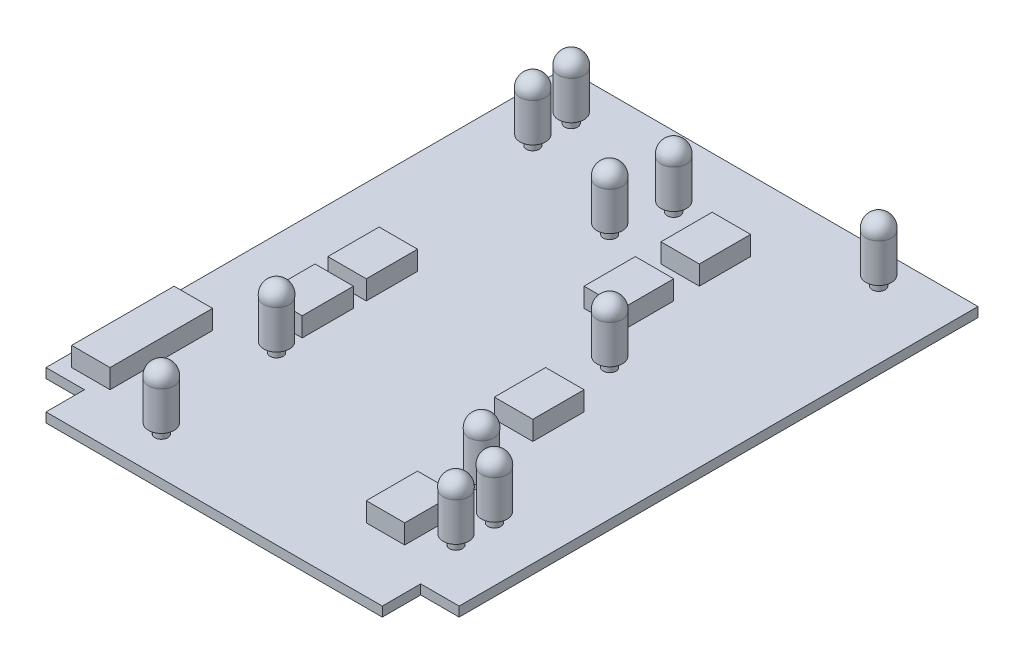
ISO-10303-21;
HEADER;
FILE_DESCRIPTION(('STEP AP214'),'2;1');
FILE_NAME('part.step','',(''),(''),'','','');
FILE_SCHEMA(('AUTOMOTIVE_DESIGN { 1 0 10303 214 1 1 1 1 }'));
ENDSEC;
DATA;
#1=APPLICATION_CONTEXT('core data for automotive mechanical design processes');
#2=APPLICATION_PROTOCOL_DEFINITION('international standard','automotive_design',2000,#1);
#3=PRODUCT_CONTEXT('',#1,'mechanical');
#4=PRODUCT('Part','Part','',(#3));
#5=PRODUCT_RELATED_PRODUCT_CATEGORY('part','',(#4));
#6=PRODUCT_DEFINITION_FORMATION('','',#4);
#7=PRODUCT_DEFINITION_CONTEXT('part definition',#1,'design');
#8=PRODUCT_DEFINITION('design','',#6,#7);
#9=PRODUCT_DEFINITION_SHAPE('','',#8);
#10=(LENGTH_UNIT() NAMED_UNIT(*) SI_UNIT(.MILLI.,.METRE.));
#11=(NAMED_UNIT(*) PLANE_ANGLE_UNIT() SI_UNIT($,.RADIAN.));
#12=(NAMED_UNIT(*) SI_UNIT($,.STERADIAN.) SOLID_ANGLE_UNIT());
#13=UNCERTAINTY_MEASURE_WITH_UNIT(LENGTH_MEASURE(1.E-05),#10,'distance_accuracy_value','');
#14=(GEOMETRIC_REPRESENTATION_CONTEXT(3) GLOBAL_UNCERTAINTY_ASSIGNED_CONTEXT((#13)) GLOBAL_UNIT_ASSIGNED_CONTEXT((#10,
#11,#12)) REPRESENTATION_CONTEXT('',''));
#15=CARTESIAN_POINT('',(0.,0.,0.));
#16=DIRECTION('',(0.,0.,1.));
#17=DIRECTION('',(1.,0.,0.));
#18=AXIS2_PLACEMENT_3D('',#15,#16,#17);
#19=CARTESIAN_POINT('',(19.05,0.,-6.35));
#20=DIRECTION('',(0.,1.,0.));
#21=DIRECTION('',(0.,0.,1.));
#22=AXIS2_PLACEMENT_3D('',#19,#20,#21);
#23=PLANE('',#22);
#24=DIRECTION('',(0.,0.,1.));
#25=VECTOR('',#24,1.);
#26=CARTESIAN_POINT('',(61.9125,0.,0.));
#27=LINE('',#26,#25);
#28=CARTESIAN_POINT('',(61.9125,0.,-6.34999999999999));
#29=VERTEX_POINT('',#28);
#30=CARTESIAN_POINT('',(61.9125,0.,0.));
#31=VERTEX_POINT('',#30);
#32=EDGE_CURVE('E63',#29,#31,#27,.T.);
#33=ORIENTED_EDGE('',*,*,#32,.T.);
#34=DIRECTION('',(1.,0.,0.));
#35=VECTOR('',#34,1.);
#36=CARTESIAN_POINT('',(0.,0.,0.));
#37=LINE('',#36,#35);
#38=CARTESIAN_POINT('',(6.35,0.,0.));
#39=VERTEX_POINT('',#38);
#40=EDGE_CURVE('E135',#39,#31,#37,.T.);
#41=ORIENTED_EDGE('',*,*,#40,.F.);
#42=DIRECTION('',(0.,0.,-1.));
#43=VECTOR('',#42,1.);
#44=CARTESIAN_POINT('',(6.35,0.,0.));
#45=LINE('',#44,#43);
#46=CARTESIAN_POINT('',(6.35,0.,-6.34999999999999));
#47=VERTEX_POINT('',#46);
#48=EDGE_CURVE('E277',#39,#47,#45,.T.);
#49=ORIENTED_EDGE('',*,*,#48,.T.);
#50=DIRECTION('',(-1.,0.,0.));
#51=VECTOR('',#50,1.);
#52=CARTESIAN_POINT('',(0.,0.,-6.35));
#53=LINE('',#52,#51);
#54=CARTESIAN_POINT('',(0.,0.,-6.35));
#55=VERTEX_POINT('',#54);
#56=EDGE_CURVE('E71',#47,#55,#53,.T.);
#57=ORIENTED_EDGE('',*,*,#56,.T.);
#58=DIRECTION('',(0.,0.,1.));
#59=VECTOR('',#58,1.);
#60=CARTESIAN_POINT('',(0.,0.,0.));
#61=LINE('',#60,#59);
#62=CARTESIAN_POINT('',(0.,0.,-92.075));
#63=VERTEX_POINT('',#62);
#64=EDGE_CURVE('E140',#63,#55,#61,.T.);
#65=ORIENTED_EDGE('',*,*,#64,.F.);
#66=DIRECTION('',(-1.,0.,0.));
#67=VECTOR('',#66,1.);
#68=CARTESIAN_POINT('',(0.,0.,-92.075));
#69=LINE('',#68,#67);
#70=CARTESIAN_POINT('',(68.2625,0.,-92.075));
#71=VERTEX_POINT('',#70);
#72=EDGE_CURVE('E134',#71,#63,#69,.T.);
#73=ORIENTED_EDGE('',*,*,#72,.F.);
#74=DIRECTION('',(0.,0.,-1.));
#75=VECTOR('',#74,1.);
#76=CARTESIAN_POINT('',(68.2625,0.,0.));
#77=LINE('',#76,#75);
#78=CARTESIAN_POINT('',(68.2625,0.,-6.35));
#79=VERTEX_POINT('',#78);
#80=EDGE_CURVE('E127',#79,#71,#77,.T.);
#81=ORIENTED_EDGE('',*,*,#80,.F.);
#82=DIRECTION('',(-1.,0.,0.));
#83=VECTOR('',#82,1.);
#84=CARTESIAN_POINT('',(68.2625,0.,-6.35));
#85=LINE('',#84,#83);
#86=EDGE_CURVE('E112',#79,#29,#85,.T.);
#87=ORIENTED_EDGE('',*,*,#86,.T.);
#88=EDGE_LOOP('',(#33,#41,#49,#57,#65,#73,#81,#87));
#89=FACE_BOUND('',#88,.T.);
#90=CARTESIAN_POINT('',(34.13125,0.,-61.9125));
#91=DIRECTION('',(0.,1.,0.));
#92=DIRECTION('',(0.,0.,1.));
#93=AXIS2_PLACEMENT_3D('',#90,#91,#92);
#94=CIRCLE('',#93,1.98437499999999);
#95=CARTESIAN_POINT('',(34.13125,0.,-59.928125));
#96=VERTEX_POINT('',#95);
#97=EDGE_CURVE('E12',#96,#96,#94,.F.);
#98=ORIENTED_EDGE('',*,*,#97,.F.);
#99=EDGE_LOOP('',(#98));
#100=FACE_BOUND('',#99,.T.);
#101=ADVANCED_FACE('F47',(#89,#100),#23,.F.);
#102=CARTESIAN_POINT('',(16.9333333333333,0.,-27.5166666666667));
#103=DIRECTION('',(0.,1.,0.));
#104=DIRECTION('',(0.,0.,1.));
#105=AXIS2_PLACEMENT_3D('',#102,#103,#104);
#106=CYLINDRICAL_SURFACE('',#105,1.05833333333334);
#107=CARTESIAN_POINT('',(16.9333333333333,1.5875,-27.5166666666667));
#108=DIRECTION('',(0.,-1.,0.));
#109=DIRECTION('',(0.,0.,-1.));
#110=AXIS2_PLACEMENT_3D('',#107,#108,#109);
#111=CIRCLE('',#110,1.05833333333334);
#112=CARTESIAN_POINT('',(16.9333333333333,1.5875,-26.4583333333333));
#113=VERTEX_POINT('',#112);
#114=EDGE_CURVE('E207',#113,#113,#111,.T.);
#115=CARTESIAN_POINT('',(16.9333333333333,3.175,-27.5166666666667));
#116=DIRECTION('',(0.,1.,0.));
#117=DIRECTION('',(0.,0.,1.));
#118=AXIS2_PLACEMENT_3D('',#115,#116,#117);
#119=CIRCLE('',#118,1.05833333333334);
#120=CARTESIAN_POINT('',(16.9333333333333,3.175,-26.4583333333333));
#121=VERTEX_POINT('',#120);
#122=EDGE_CURVE('E204',#121,#121,#119,.F.);
#123=CARTESIAN_POINT('',(16.9333333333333,1.5875,-26.4583333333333));
#124=CARTESIAN_POINT('',(16.9333333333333,1.60403645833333,-26.4583333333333));
#125=CARTESIAN_POINT('',(16.9333333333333,1.62057291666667,-26.4583333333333));
#126=CARTESIAN_POINT('',(16.9333333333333,1.65364583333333,-26.4583333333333));
#127=CARTESIAN_POINT('',(16.9333333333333,1.67018229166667,-26.4583333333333));
#128=CARTESIAN_POINT('',(16.9333333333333,1.70325520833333,-26.4583333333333));
#129=CARTESIAN_POINT('',(16.9333333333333,1.71979166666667,-26.4583333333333));
#130=CARTESIAN_POINT('',(16.9333333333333,1.75286458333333,-26.4583333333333));
#131=CARTESIAN_POINT('',(16.9333333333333,1.76940104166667,-26.4583333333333));
#132=CARTESIAN_POINT('',(16.9333333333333,1.80247395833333,-26.4583333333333));
#133=CARTESIAN_POINT('',(16.9333333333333,1.81901041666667,-26.4583333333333));
#134=CARTESIAN_POINT('',(16.9333333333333,1.85208333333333,-26.4583333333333));
#135=CARTESIAN_POINT('',(16.9333333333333,1.86861979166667,-26.4583333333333));
#136=CARTESIAN_POINT('',(16.9333333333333,1.90169270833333,-26.4583333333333));
#137=CARTESIAN_POINT('',(16.9333333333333,1.91822916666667,-26.4583333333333));
#138=CARTESIAN_POINT('',(16.9333333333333,1.95130208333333,-26.4583333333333));
#139=CARTESIAN_POINT('',(16.9333333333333,1.96783854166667,-26.4583333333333));
#140=CARTESIAN_POINT('',(16.9333333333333,2.00091145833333,-26.4583333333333));
#141=CARTESIAN_POINT('',(16.9333333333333,2.01744791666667,-26.4583333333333));
#142=CARTESIAN_POINT('',(16.9333333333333,2.05052083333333,-26.4583333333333));
#143=CARTESIAN_POINT('',(16.9333333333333,2.06705729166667,-26.4583333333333));
#144=CARTESIAN_POINT('',(16.9333333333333,2.10013020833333,-26.4583333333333));
#145=CARTESIAN_POINT('',(16.9333333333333,2.11666666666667,-26.4583333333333));
#146=CARTESIAN_POINT('',(16.9333333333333,2.14973958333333,-26.4583333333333));
#147=CARTESIAN_POINT('',(16.9333333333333,2.16627604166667,-26.4583333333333));
#148=CARTESIAN_POINT('',(16.9333333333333,2.19934895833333,-26.4583333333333));
#149=CARTESIAN_POINT('',(16.9333333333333,2.21588541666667,-26.4583333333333));
#150=CARTESIAN_POINT('',(16.9333333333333,2.24895833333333,-26.4583333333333));
#151=CARTESIAN_POINT('',(16.9333333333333,2.26549479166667,-26.4583333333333));
#152=CARTESIAN_POINT('',(16.9333333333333,2.29856770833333,-26.4583333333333));
#153=CARTESIAN_POINT('',(16.9333333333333,2.31510416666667,-26.4583333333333));
#154=CARTESIAN_POINT('',(16.9333333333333,2.34817708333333,-26.4583333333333));
#155=CARTESIAN_POINT('',(16.9333333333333,2.36471354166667,-26.4583333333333));
#156=CARTESIAN_POINT('',(16.9333333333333,2.39778645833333,-26.4583333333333));
#157=CARTESIAN_POINT('',(16.9333333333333,2.41432291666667,-26.4583333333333));
#158=CARTESIAN_POINT('',(16.9333333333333,2.44739583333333,-26.4583333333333));
#159=CARTESIAN_POINT('',(16.9333333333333,2.46393229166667,-26.4583333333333));
#160=CARTESIAN_POINT('',(16.9333333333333,2.49700520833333,-26.4583333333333));
#161=CARTESIAN_POINT('',(16.9333333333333,2.51354166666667,-26.4583333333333));
#162=CARTESIAN_POINT('',(16.9333333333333,2.54661458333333,-26.4583333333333));
#163=CARTESIAN_POINT('',(16.9333333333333,2.56315104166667,-26.4583333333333));
#164=CARTESIAN_POINT('',(16.9333333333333,2.59622395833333,-26.4583333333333));
#165=CARTESIAN_POINT('',(16.9333333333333,2.61276041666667,-26.4583333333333));
#166=CARTESIAN_POINT('',(16.9333333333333,2.64583333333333,-26.4583333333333));
#167=CARTESIAN_POINT('',(16.9333333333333,2.66236979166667,-26.4583333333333));
#168=CARTESIAN_POINT('',(16.9333333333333,2.69544270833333,-26.4583333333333));
#169=CARTESIAN_POINT('',(16.9333333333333,2.71197916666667,-26.4583333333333));
#170=CARTESIAN_POINT('',(16.9333333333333,2.74505208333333,-26.4583333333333));
#171=CARTESIAN_POINT('',(16.9333333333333,2.76158854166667,-26.4583333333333));
#172=CARTESIAN_POINT('',(16.9333333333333,2.79466145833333,-26.4583333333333));
#173=CARTESIAN_POINT('',(16.9333333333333,2.81119791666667,-26.4583333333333));
#174=CARTESIAN_POINT('',(16.9333333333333,2.84427083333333,-26.4583333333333));
#175=CARTESIAN_POINT('',(16.9333333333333,2.86080729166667,-26.4583333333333));
#176=CARTESIAN_POINT('',(16.9333333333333,2.89388020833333,-26.4583333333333));
#177=CARTESIAN_POINT('',(16.9333333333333,2.91041666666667,-26.4583333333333));
#178=CARTESIAN_POINT('',(16.9333333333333,2.94348958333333,-26.4583333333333));
#179=CARTESIAN_POINT('',(16.9333333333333,2.96002604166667,-26.4583333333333));
#180=CARTESIAN_POINT('',(16.9333333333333,2.99309895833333,-26.4583333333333));
#181=CARTESIAN_POINT('',(16.9333333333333,3.00963541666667,-26.4583333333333));
#182=CARTESIAN_POINT('',(16.9333333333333,3.04270833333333,-26.4583333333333));
#183=CARTESIAN_POINT('',(16.9333333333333,3.05924479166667,-26.4583333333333));
#184=CARTESIAN_POINT('',(16.9333333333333,3.09231770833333,-26.4583333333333));
#185=CARTESIAN_POINT('',(16.9333333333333,3.10885416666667,-26.4583333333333));
#186=CARTESIAN_POINT('',(16.9333333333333,3.14192708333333,-26.4583333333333));
#187=CARTESIAN_POINT('',(16.9333333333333,3.15846354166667,-26.4583333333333));
#188=CARTESIAN_POINT('',(16.9333333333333,3.175,-26.4583333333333));
#189=B_SPLINE_CURVE_WITH_KNOTS('',3,(#123,#124,#125,#126,#127,#128,#129,#130,#131,#132,#133,
#134,#135,#136,#137,#138,#139,#140,#141,#142,#143,#144,#145,#146,#147,#148,#149,#150,#151,#152,
#153,#154,#155,#156,#157,#158,#159,#160,#161,#162,#163,#164,#165,#166,#167,#168,#169,#170,#171,
#172,#173,#174,#175,#176,#177,#178,#179,#180,#181,#182,#183,#184,#185,#186,#187,#188),
.UNSPECIFIED.,.F.,.F.,(4,2,2,2,2,2,2,2,2,2,2,2,2,2,2,2,2,2,2,2,2,2,2,2,2,2,2,2,2,2,2,2,4),(0.,
0.049609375,0.0992187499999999,0.148828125,0.1984375,0.248046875,0.29765625,0.347265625,
0.396874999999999,0.446484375,0.49609375,0.545703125,0.5953125,0.644921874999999,0.69453125,
0.744140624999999,0.79375,0.843359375,0.892968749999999,0.942578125,0.992187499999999,
1.041796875,1.09140625,1.141015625,1.190625,1.240234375,1.28984375,1.339453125,1.3890625,
1.438671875,1.48828125,1.537890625,1.5875),.UNSPECIFIED.);
#190=EDGE_CURVE('BSEAM329',#113,#121,#189,.T.);
#191=ORIENTED_EDGE('',*,*,#114,.F.);
#192=ORIENTED_EDGE('',*,*,#122,.T.);
#193=ORIENTED_EDGE('',*,*,#190,.T.);
#194=ORIENTED_EDGE('',*,*,#190,.F.);
#195=EDGE_LOOP('',(#191,#193,#192,#194));
#196=FACE_BOUND('',#195,.T.);
#197=ADVANCED_FACE('F329',(#196),#106,.T.);
#198=CARTESIAN_POINT('',(8.46666666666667,0.,-78.3166666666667));
#199=DIRECTION('',(0.,1.,0.));
#200=DIRECTION('',(0.,0.,1.));
#201=AXIS2_PLACEMENT_3D('',#198,#199,#200);
#202=CYLINDRICAL_SURFACE('',#201,1.05833333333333);
#203=CARTESIAN_POINT('',(8.46666666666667,1.5875,-78.3166666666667));
#204=DIRECTION('',(0.,-1.,0.));
#205=DIRECTION('',(0.,0.,-1.));
#206=AXIS2_PLACEMENT_3D('',#203,#204,#205);
#207=CIRCLE('',#206,1.05833333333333);
#208=CARTESIAN_POINT('',(8.46666666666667,1.5875,-77.2583333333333));
#209=VERTEX_POINT('',#208);
#210=EDGE_CURVE('E202',#209,#209,#207,.T.);
#211=CARTESIAN_POINT('',(8.46666666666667,3.175,-78.3166666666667));
#212=DIRECTION('',(0.,1.,0.));
#213=DIRECTION('',(0.,0.,1.));
#214=AXIS2_PLACEMENT_3D('',#211,#212,#213);
#215=CIRCLE('',#214,1.05833333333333);
#216=CARTESIAN_POINT('',(8.46666666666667,3.175,-77.2583333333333));
#217=VERTEX_POINT('',#216);
#218=EDGE_CURVE('E199',#217,#217,#215,.F.);
#219=CARTESIAN_POINT('',(8.46666666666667,1.5875,-77.2583333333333));
#220=CARTESIAN_POINT('',(8.46666666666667,1.60403645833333,-77.2583333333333));
#221=CARTESIAN_POINT('',(8.46666666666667,1.62057291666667,-77.2583333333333));
#222=CARTESIAN_POINT('',(8.46666666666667,1.65364583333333,-77.2583333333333));
#223=CARTESIAN_POINT('',(8.46666666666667,1.67018229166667,-77.2583333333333));
#224=CARTESIAN_POINT('',(8.46666666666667,1.70325520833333,-77.2583333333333));
#225=CARTESIAN_POINT('',(8.46666666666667,1.71979166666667,-77.2583333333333));
#226=CARTESIAN_POINT('',(8.46666666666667,1.75286458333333,-77.2583333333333));
#227=CARTESIAN_POINT('',(8.46666666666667,1.76940104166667,-77.2583333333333));
#228=CARTESIAN_POINT('',(8.46666666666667,1.80247395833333,-77.2583333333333));
#229=CARTESIAN_POINT('',(8.46666666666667,1.81901041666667,-77.2583333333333));
#230=CARTESIAN_POINT('',(8.46666666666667,1.85208333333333,-77.2583333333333));
#231=CARTESIAN_POINT('',(8.46666666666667,1.86861979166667,-77.2583333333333));
#232=CARTESIAN_POINT('',(8.46666666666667,1.90169270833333,-77.2583333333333));
#233=CARTESIAN_POINT('',(8.46666666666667,1.91822916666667,-77.2583333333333));
#234=CARTESIAN_POINT('',(8.46666666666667,1.95130208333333,-77.2583333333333));
#235=CARTESIAN_POINT('',(8.46666666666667,1.96783854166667,-77.2583333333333));
#236=CARTESIAN_POINT('',(8.46666666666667,2.00091145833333,-77.2583333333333));
#237=CARTESIAN_POINT('',(8.46666666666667,2.01744791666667,-77.2583333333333));
#238=CARTESIAN_POINT('',(8.46666666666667,2.05052083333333,-77.2583333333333));
#239=CARTESIAN_POINT('',(8.46666666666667,2.06705729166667,-77.2583333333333));
#240=CARTESIAN_POINT('',(8.46666666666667,2.10013020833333,-77.2583333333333));
#241=CARTESIAN_POINT('',(8.46666666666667,2.11666666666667,-77.2583333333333));
#242=CARTESIAN_POINT('',(8.46666666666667,2.14973958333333,-77.2583333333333));
#243=CARTESIAN_POINT('',(8.46666666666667,2.16627604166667,-77.2583333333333));
#244=CARTESIAN_POINT('',(8.46666666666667,2.19934895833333,-77.2583333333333));
#245=CARTESIAN_POINT('',(8.46666666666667,2.21588541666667,-77.2583333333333));
#246=CARTESIAN_POINT('',(8.46666666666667,2.24895833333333,-77.2583333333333));
#247=CARTESIAN_POINT('',(8.46666666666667,2.26549479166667,-77.2583333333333));
#248=CARTESIAN_POINT('',(8.46666666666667,2.29856770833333,-77.2583333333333));
#249=CARTESIAN_POINT('',(8.46666666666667,2.31510416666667,-77.2583333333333));
#250=CARTESIAN_POINT('',(8.46666666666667,2.34817708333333,-77.2583333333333));
#251=CARTESIAN_POINT('',(8.46666666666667,2.36471354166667,-77.2583333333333));
#252=CARTESIAN_POINT('',(8.46666666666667,2.39778645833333,-77.2583333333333));
#253=CARTESIAN_POINT('',(8.46666666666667,2.41432291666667,-77.2583333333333));
#254=CARTESIAN_POINT('',(8.46666666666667,2.44739583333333,-77.2583333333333));
#255=CARTESIAN_POINT('',(8.46666666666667,2.46393229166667,-77.2583333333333));
#256=CARTESIAN_POINT('',(8.46666666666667,2.49700520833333,-77.2583333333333));
#257=CARTESIAN_POINT('',(8.46666666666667,2.51354166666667,-77.2583333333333));
#258=CARTESIAN_POINT('',(8.46666666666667,2.54661458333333,-77.2583333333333));
#259=CARTESIAN_POINT('',(8.46666666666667,2.56315104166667,-77.2583333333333));
#260=CARTESIAN_POINT('',(8.46666666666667,2.59622395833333,-77.2583333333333));
#261=CARTESIAN_POINT('',(8.46666666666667,2.61276041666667,-77.2583333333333));
#262=CARTESIAN_POINT('',(8.46666666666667,2.64583333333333,-77.2583333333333));
#263=CARTESIAN_POINT('',(8.46666666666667,2.66236979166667,-77.2583333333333));
#264=CARTESIAN_POINT('',(8.46666666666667,2.69544270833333,-77.2583333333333));
#265=CARTESIAN_POINT('',(8.46666666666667,2.71197916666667,-77.2583333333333));
#266=CARTESIAN_POINT('',(8.46666666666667,2.74505208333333,-77.2583333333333));
#267=CARTESIAN_POINT('',(8.46666666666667,2.76158854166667,-77.2583333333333));
#268=CARTESIAN_POINT('',(8.46666666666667,2.79466145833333,-77.2583333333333));
#269=CARTESIAN_POINT('',(8.46666666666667,2.81119791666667,-77.2583333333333));
#270=CARTESIAN_POINT('',(8.46666666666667,2.84427083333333,-77.2583333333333));
#271=CARTESIAN_POINT('',(8.46666666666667,2.86080729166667,-77.2583333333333));
#272=CARTESIAN_POINT('',(8.46666666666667,2.89388020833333,-77.2583333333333));
#273=CARTESIAN_POINT('',(8.46666666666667,2.91041666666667,-77.2583333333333));
#274=CARTESIAN_POINT('',(8.46666666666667,2.94348958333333,-77.2583333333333));
#275=CARTESIAN_POINT('',(8.46666666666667,2.96002604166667,-77.2583333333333));
#276=CARTESIAN_POINT('',(8.46666666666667,2.99309895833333,-77.2583333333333));
#277=CARTESIAN_POINT('',(8.46666666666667,3.00963541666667,-77.2583333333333));
#278=CARTESIAN_POINT('',(8.46666666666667,3.04270833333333,-77.2583333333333));
#279=CARTESIAN_POINT('',(8.46666666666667,3.05924479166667,-77.2583333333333));
#280=CARTESIAN_POINT('',(8.46666666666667,3.09231770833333,-77.2583333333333));
#281=CARTESIAN_POINT('',(8.46666666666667,3.10885416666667,-77.2583333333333));
#282=CARTESIAN_POINT('',(8.46666666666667,3.14192708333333,-77.2583333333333));
#283=CARTESIAN_POINT('',(8.46666666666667,3.15846354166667,-77.2583333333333));
#284=CARTESIAN_POINT('',(8.46666666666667,3.175,-77.2583333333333));
#285=B_SPLINE_CURVE_WITH_KNOTS('',3,(#219,#220,#221,#222,#223,#224,#225,#226,#227,#228,#229,
#230,#231,#232,#233,#234,#235,#236,#237,#238,#239,#240,#241,#242,#243,#244,#245,#246,#247,#248,
#249,#250,#251,#252,#253,#254,#255,#256,#257,#258,#259,#260,#261,#262,#263,#264,#265,#266,#267,
#268,#269,#270,#271,#272,#273,#274,#275,#276,#277,#278,#279,#280,#281,#282,#283,#284),
.UNSPECIFIED.,.F.,.F.,(4,2,2,2,2,2,2,2,2,2,2,2,2,2,2,2,2,2,2,2,2,2,2,2,2,2,2,2,2,2,2,2,4),(0.,
0.049609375,0.0992187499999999,0.148828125,0.1984375,0.248046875,0.29765625,0.347265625,
0.396874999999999,0.446484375,0.49609375,0.545703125,0.5953125,0.644921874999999,0.69453125,
0.744140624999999,0.79375,0.843359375,0.892968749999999,0.942578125,0.992187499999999,
1.041796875,1.09140625,1.141015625,1.190625,1.240234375,1.28984375,1.339453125,1.3890625,
1.438671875,1.48828125,1.537890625,1.5875),.UNSPECIFIED.);
#286=EDGE_CURVE('BSEAM334',#209,#217,#285,.T.);
#287=ORIENTED_EDGE('',*,*,#210,.F.);
#288=ORIENTED_EDGE('',*,*,#218,.T.);
#289=ORIENTED_EDGE('',*,*,#286,.T.);
#290=ORIENTED_EDGE('',*,*,#286,.F.);
#291=EDGE_LOOP('',(#287,#289,#288,#290));
#292=FACE_BOUND('',#291,.T.);
#293=ADVANCED_FACE('F334',(#292),#202,.T.);
#294=CARTESIAN_POINT('',(8.46666666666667,0.,-84.6666666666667));
#295=DIRECTION('',(0.,1.,0.));
#296=DIRECTION('',(0.,0.,1.));
#297=AXIS2_PLACEMENT_3D('',#294,#295,#296);
#298=CYLINDRICAL_SURFACE('',#297,1.05833333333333);
#299=CARTESIAN_POINT('',(8.46666666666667,1.5875,-84.6666666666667));
#300=DIRECTION('',(0.,-1.,0.));
#301=DIRECTION('',(0.,0.,-1.));
#302=AXIS2_PLACEMENT_3D('',#299,#300,#301);
#303=CIRCLE('',#302,1.05833333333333);
#304=CARTESIAN_POINT('',(8.46666666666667,1.5875,-83.6083333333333));
#305=VERTEX_POINT('',#304);
#306=EDGE_CURVE('E197',#305,#305,#303,.T.);
#307=CARTESIAN_POINT('',(8.46666666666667,3.175,-84.6666666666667));
#308=DIRECTION('',(0.,1.,0.));
#309=DIRECTION('',(0.,0.,1.));
#310=AXIS2_PLACEMENT_3D('',#307,#308,#309);
#311=CIRCLE('',#310,1.05833333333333);
#312=CARTESIAN_POINT('',(8.46666666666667,3.175,-83.6083333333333));
#313=VERTEX_POINT('',#312);
#314=EDGE_CURVE('E194',#313,#313,#311,.F.);
#315=CARTESIAN_POINT('',(8.46666666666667,1.5875,-83.6083333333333));
#316=CARTESIAN_POINT('',(8.46666666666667,1.60403645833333,-83.6083333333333));
#317=CARTESIAN_POINT('',(8.46666666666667,1.62057291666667,-83.6083333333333));
#318=CARTESIAN_POINT('',(8.46666666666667,1.65364583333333,-83.6083333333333));
#319=CARTESIAN_POINT('',(8.46666666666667,1.67018229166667,-83.6083333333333));
#320=CARTESIAN_POINT('',(8.46666666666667,1.70325520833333,-83.6083333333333));
#321=CARTESIAN_POINT('',(8.46666666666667,1.71979166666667,-83.6083333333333));
#322=CARTESIAN_POINT('',(8.46666666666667,1.75286458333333,-83.6083333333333));
#323=CARTESIAN_POINT('',(8.46666666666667,1.76940104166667,-83.6083333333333));
#324=CARTESIAN_POINT('',(8.46666666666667,1.80247395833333,-83.6083333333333));
#325=CARTESIAN_POINT('',(8.46666666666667,1.81901041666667,-83.6083333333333));
#326=CARTESIAN_POINT('',(8.46666666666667,1.85208333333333,-83.6083333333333));
#327=CARTESIAN_POINT('',(8.46666666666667,1.86861979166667,-83.6083333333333));
#328=CARTESIAN_POINT('',(8.46666666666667,1.90169270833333,-83.6083333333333));
#329=CARTESIAN_POINT('',(8.46666666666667,1.91822916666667,-83.6083333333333));
#330=CARTESIAN_POINT('',(8.46666666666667,1.95130208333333,-83.6083333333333));
#331=CARTESIAN_POINT('',(8.46666666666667,1.96783854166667,-83.6083333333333));
#332=CARTESIAN_POINT('',(8.46666666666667,2.00091145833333,-83.6083333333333));
#333=CARTESIAN_POINT('',(8.46666666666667,2.01744791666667,-83.6083333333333));
#334=CARTESIAN_POINT('',(8.46666666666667,2.05052083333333,-83.6083333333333));
#335=CARTESIAN_POINT('',(8.46666666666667,2.06705729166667,-83.6083333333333));
#336=CARTESIAN_POINT('',(8.46666666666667,2.10013020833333,-83.6083333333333));
#337=CARTESIAN_POINT('',(8.46666666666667,2.11666666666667,-83.6083333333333));
#338=CARTESIAN_POINT('',(8.46666666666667,2.14973958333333,-83.6083333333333));
#339=CARTESIAN_POINT('',(8.46666666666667,2.16627604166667,-83.6083333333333));
#340=CARTESIAN_POINT('',(8.46666666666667,2.19934895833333,-83.6083333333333));
#341=CARTESIAN_POINT('',(8.46666666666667,2.21588541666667,-83.6083333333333));
#342=CARTESIAN_POINT('',(8.46666666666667,2.24895833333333,-83.6083333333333));
#343=CARTESIAN_POINT('',(8.46666666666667,2.26549479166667,-83.6083333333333));
#344=CARTESIAN_POINT('',(8.46666666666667,2.29856770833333,-83.6083333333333));
#345=CARTESIAN_POINT('',(8.46666666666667,2.31510416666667,-83.6083333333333));
#346=CARTESIAN_POINT('',(8.46666666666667,2.34817708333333,-83.6083333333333));
#347=CARTESIAN_POINT('',(8.46666666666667,2.36471354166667,-83.6083333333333));
#348=CARTESIAN_POINT('',(8.46666666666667,2.39778645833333,-83.6083333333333));
#349=CARTESIAN_POINT('',(8.46666666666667,2.41432291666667,-83.6083333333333));
#350=CARTESIAN_POINT('',(8.46666666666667,2.44739583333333,-83.6083333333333));
#351=CARTESIAN_POINT('',(8.46666666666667,2.46393229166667,-83.6083333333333));
#352=CARTESIAN_POINT('',(8.46666666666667,2.49700520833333,-83.6083333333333));
#353=CARTESIAN_POINT('',(8.46666666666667,2.51354166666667,-83.6083333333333));
#354=CARTESIAN_POINT('',(8.46666666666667,2.54661458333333,-83.6083333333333));
#355=CARTESIAN_POINT('',(8.46666666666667,2.56315104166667,-83.6083333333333));
#356=CARTESIAN_POINT('',(8.46666666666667,2.59622395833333,-83.6083333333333));
#357=CARTESIAN_POINT('',(8.46666666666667,2.61276041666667,-83.6083333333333));
#358=CARTESIAN_POINT('',(8.46666666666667,2.64583333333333,-83.6083333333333));
#359=CARTESIAN_POINT('',(8.46666666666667,2.66236979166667,-83.6083333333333));
#360=CARTESIAN_POINT('',(8.46666666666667,2.69544270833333,-83.6083333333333));
#361=CARTESIAN_POINT('',(8.46666666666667,2.71197916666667,-83.6083333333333));
#362=CARTESIAN_POINT('',(8.46666666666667,2.74505208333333,-83.6083333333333));
#363=CARTESIAN_POINT('',(8.46666666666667,2.76158854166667,-83.6083333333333));
#364=CARTESIAN_POINT('',(8.46666666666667,2.79466145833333,-83.6083333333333));
#365=CARTESIAN_POINT('',(8.46666666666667,2.81119791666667,-83.6083333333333));
#366=CARTESIAN_POINT('',(8.46666666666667,2.84427083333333,-83.6083333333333));
#367=CARTESIAN_POINT('',(8.46666666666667,2.86080729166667,-83.6083333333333));
#368=CARTESIAN_POINT('',(8.46666666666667,2.89388020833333,-83.6083333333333));
#369=CARTESIAN_POINT('',(8.46666666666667,2.91041666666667,-83.6083333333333));
#370=CARTESIAN_POINT('',(8.46666666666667,2.94348958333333,-83.6083333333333));
#371=CARTESIAN_POINT('',(8.46666666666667,2.96002604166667,-83.6083333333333));
#372=CARTESIAN_POINT('',(8.46666666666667,2.99309895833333,-83.6083333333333));
#373=CARTESIAN_POINT('',(8.46666666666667,3.00963541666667,-83.6083333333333));
#374=CARTESIAN_POINT('',(8.46666666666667,3.04270833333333,-83.6083333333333));
#375=CARTESIAN_POINT('',(8.46666666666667,3.05924479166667,-83.6083333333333));
#376=CARTESIAN_POINT('',(8.46666666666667,3.09231770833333,-83.6083333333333));
#377=CARTESIAN_POINT('',(8.46666666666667,3.10885416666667,-83.6083333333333));
#378=CARTESIAN_POINT('',(8.46666666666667,3.14192708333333,-83.6083333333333));
#379=CARTESIAN_POINT('',(8.46666666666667,3.15846354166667,-83.6083333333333));
#380=CARTESIAN_POINT('',(8.46666666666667,3.175,-83.6083333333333));
#381=B_SPLINE_CURVE_WITH_KNOTS('',3,(#315,#316,#317,#318,#319,#320,#321,#322,#323,#324,#325,
#326,#327,#328,#329,#330,#331,#332,#333,#334,#335,#336,#337,#338,#339,#340,#341,#342,#343,#344,
#345,#346,#347,#348,#349,#350,#351,#352,#353,#354,#355,#356,#357,#358,#359,#360,#361,#362,#363,
#364,#365,#366,#367,#368,#369,#370,#371,#372,#373,#374,#375,#376,#377,#378,#379,#380),
.UNSPECIFIED.,.F.,.F.,(4,2,2,2,2,2,2,2,2,2,2,2,2,2,2,2,2,2,2,2,2,2,2,2,2,2,2,2,2,2,2,2,4),(0.,
0.049609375,0.0992187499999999,0.148828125,0.1984375,0.248046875,0.29765625,0.347265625,
0.396874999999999,0.446484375,0.49609375,0.545703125,0.5953125,0.644921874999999,0.69453125,
0.744140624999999,0.79375,0.843359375,0.892968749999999,0.942578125,0.992187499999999,
1.041796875,1.09140625,1.141015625,1.190625,1.240234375,1.28984375,1.339453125,1.3890625,
1.438671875,1.48828125,1.537890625,1.5875),.UNSPECIFIED.);
#382=EDGE_CURVE('BSEAM605',#305,#313,#381,.T.);
#383=ORIENTED_EDGE('',*,*,#306,.F.);
#384=ORIENTED_EDGE('',*,*,#314,.T.);
#385=ORIENTED_EDGE('',*,*,#382,.T.);
#386=ORIENTED_EDGE('',*,*,#382,.F.);
#387=EDGE_LOOP('',(#383,#385,#384,#386));
#388=FACE_BOUND('',#387,.T.);
#389=ADVANCED_FACE('F605',(#388),#298,.T.);
#390=CARTESIAN_POINT('',(27.5166666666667,0.,-71.9666666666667));
#391=DIRECTION('',(0.,1.,0.));
#392=DIRECTION('',(0.,0.,1.));
#393=AXIS2_PLACEMENT_3D('',#390,#391,#392);
#394=CYLINDRICAL_SURFACE('',#393,1.05833333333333);
#395=CARTESIAN_POINT('',(27.5166666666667,1.5875,-71.9666666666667));
#396=DIRECTION('',(0.,-1.,0.));
#397=DIRECTION('',(0.,0.,-1.));
#398=AXIS2_PLACEMENT_3D('',#395,#396,#397);
#399=CIRCLE('',#398,1.05833333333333);
#400=CARTESIAN_POINT('',(27.5166666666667,1.5875,-70.9083333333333));
#401=VERTEX_POINT('',#400);
#402=EDGE_CURVE('E192',#401,#401,#399,.T.);
#403=CARTESIAN_POINT('',(27.5166666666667,3.175,-71.9666666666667));
#404=DIRECTION('',(0.,1.,0.));
#405=DIRECTION('',(0.,0.,1.));
#406=AXIS2_PLACEMENT_3D('',#403,#404,#405);
#407=CIRCLE('',#406,1.05833333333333);
#408=CARTESIAN_POINT('',(27.5166666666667,3.175,-70.9083333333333));
#409=VERTEX_POINT('',#408);
#410=EDGE_CURVE('E189',#409,#409,#407,.F.);
#411=CARTESIAN_POINT('',(27.5166666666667,1.5875,-70.9083333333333));
#412=CARTESIAN_POINT('',(27.5166666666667,1.60403645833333,-70.9083333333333));
#413=CARTESIAN_POINT('',(27.5166666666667,1.62057291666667,-70.9083333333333));
#414=CARTESIAN_POINT('',(27.5166666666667,1.65364583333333,-70.9083333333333));
#415=CARTESIAN_POINT('',(27.5166666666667,1.67018229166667,-70.9083333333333));
#416=CARTESIAN_POINT('',(27.5166666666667,1.70325520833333,-70.9083333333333));
#417=CARTESIAN_POINT('',(27.5166666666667,1.71979166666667,-70.9083333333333));
#418=CARTESIAN_POINT('',(27.5166666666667,1.75286458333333,-70.9083333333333));
#419=CARTESIAN_POINT('',(27.5166666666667,1.76940104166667,-70.9083333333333));
#420=CARTESIAN_POINT('',(27.5166666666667,1.80247395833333,-70.9083333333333));
#421=CARTESIAN_POINT('',(27.5166666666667,1.81901041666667,-70.9083333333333));
#422=CARTESIAN_POINT('',(27.5166666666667,1.85208333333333,-70.9083333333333));
#423=CARTESIAN_POINT('',(27.5166666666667,1.86861979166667,-70.9083333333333));
#424=CARTESIAN_POINT('',(27.5166666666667,1.90169270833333,-70.9083333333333));
#425=CARTESIAN_POINT('',(27.5166666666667,1.91822916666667,-70.9083333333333));
#426=CARTESIAN_POINT('',(27.5166666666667,1.95130208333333,-70.9083333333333));
#427=CARTESIAN_POINT('',(27.5166666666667,1.96783854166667,-70.9083333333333));
#428=CARTESIAN_POINT('',(27.5166666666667,2.00091145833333,-70.9083333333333));
#429=CARTESIAN_POINT('',(27.5166666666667,2.01744791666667,-70.9083333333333));
#430=CARTESIAN_POINT('',(27.5166666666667,2.05052083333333,-70.9083333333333));
#431=CARTESIAN_POINT('',(27.5166666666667,2.06705729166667,-70.9083333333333));
#432=CARTESIAN_POINT('',(27.5166666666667,2.10013020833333,-70.9083333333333));
#433=CARTESIAN_POINT('',(27.5166666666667,2.11666666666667,-70.9083333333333));
#434=CARTESIAN_POINT('',(27.5166666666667,2.14973958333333,-70.9083333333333));
#435=CARTESIAN_POINT('',(27.5166666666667,2.16627604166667,-70.9083333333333));
#436=CARTESIAN_POINT('',(27.5166666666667,2.19934895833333,-70.9083333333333));
#437=CARTESIAN_POINT('',(27.5166666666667,2.21588541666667,-70.9083333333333));
#438=CARTESIAN_POINT('',(27.5166666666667,2.24895833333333,-70.9083333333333));
#439=CARTESIAN_POINT('',(27.5166666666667,2.26549479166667,-70.9083333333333));
#440=CARTESIAN_POINT('',(27.5166666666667,2.29856770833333,-70.9083333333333));
#441=CARTESIAN_POINT('',(27.5166666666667,2.31510416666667,-70.9083333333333));
#442=CARTESIAN_POINT('',(27.5166666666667,2.34817708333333,-70.9083333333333));
#443=CARTESIAN_POINT('',(27.5166666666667,2.36471354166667,-70.9083333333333));
#444=CARTESIAN_POINT('',(27.5166666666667,2.39778645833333,-70.9083333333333));
#445=CARTESIAN_POINT('',(27.5166666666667,2.41432291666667,-70.9083333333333));
#446=CARTESIAN_POINT('',(27.5166666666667,2.44739583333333,-70.9083333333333));
#447=CARTESIAN_POINT('',(27.5166666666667,2.46393229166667,-70.9083333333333));
#448=CARTESIAN_POINT('',(27.5166666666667,2.49700520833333,-70.9083333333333));
#449=CARTESIAN_POINT('',(27.5166666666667,2.51354166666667,-70.9083333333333));
#450=CARTESIAN_POINT('',(27.5166666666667,2.54661458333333,-70.9083333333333));
#451=CARTESIAN_POINT('',(27.5166666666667,2.56315104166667,-70.9083333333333));
#452=CARTESIAN_POINT('',(27.5166666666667,2.59622395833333,-70.9083333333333));
#453=CARTESIAN_POINT('',(27.5166666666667,2.61276041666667,-70.9083333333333));
#454=CARTESIAN_POINT('',(27.5166666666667,2.64583333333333,-70.9083333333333));
#455=CARTESIAN_POINT('',(27.5166666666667,2.66236979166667,-70.9083333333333));
#456=CARTESIAN_POINT('',(27.5166666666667,2.69544270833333,-70.9083333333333));
#457=CARTESIAN_POINT('',(27.5166666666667,2.71197916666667,-70.9083333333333));
#458=CARTESIAN_POINT('',(27.5166666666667,2.74505208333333,-70.9083333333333));
#459=CARTESIAN_POINT('',(27.5166666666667,2.76158854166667,-70.9083333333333));
#460=CARTESIAN_POINT('',(27.5166666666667,2.79466145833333,-70.9083333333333));
#461=CARTESIAN_POINT('',(27.5166666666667,2.81119791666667,-70.9083333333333));
#462=CARTESIAN_POINT('',(27.5166666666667,2.84427083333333,-70.9083333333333));
#463=CARTESIAN_POINT('',(27.5166666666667,2.86080729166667,-70.9083333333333));
#464=CARTESIAN_POINT('',(27.5166666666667,2.89388020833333,-70.9083333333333));
#465=CARTESIAN_POINT('',(27.5166666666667,2.91041666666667,-70.9083333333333));
#466=CARTESIAN_POINT('',(27.5166666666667,2.94348958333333,-70.9083333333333));
#467=CARTESIAN_POINT('',(27.5166666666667,2.96002604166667,-70.9083333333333));
#468=CARTESIAN_POINT('',(27.5166666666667,2.99309895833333,-70.9083333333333));
#469=CARTESIAN_POINT('',(27.5166666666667,3.00963541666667,-70.9083333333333));
#470=CARTESIAN_POINT('',(27.5166666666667,3.04270833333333,-70.9083333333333));
#471=CARTESIAN_POINT('',(27.5166666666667,3.05924479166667,-70.9083333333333));
#472=CARTESIAN_POINT('',(27.5166666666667,3.09231770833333,-70.9083333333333));
#473=CARTESIAN_POINT('',(27.5166666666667,3.10885416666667,-70.9083333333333));
#474=CARTESIAN_POINT('',(27.5166666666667,3.14192708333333,-70.9083333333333));
#475=CARTESIAN_POINT('',(27.5166666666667,3.15846354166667,-70.9083333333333));
#476=CARTESIAN_POINT('',(27.5166666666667,3.175,-70.9083333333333));
#477=B_SPLINE_CURVE_WITH_KNOTS('',3,(#411,#412,#413,#414,#415,#416,#417,#418,#419,#420,#421,
#422,#423,#424,#425,#426,#427,#428,#429,#430,#431,#432,#433,#434,#435,#436,#437,#438,#439,#440,
#441,#442,#443,#444,#445,#446,#447,#448,#449,#450,#451,#452,#453,#454,#455,#456,#457,#458,#459,
#460,#461,#462,#463,#464,#465,#466,#467,#468,#469,#470,#471,#472,#473,#474,#475,#476),
.UNSPECIFIED.,.F.,.F.,(4,2,2,2,2,2,2,2,2,2,2,2,2,2,2,2,2,2,2,2,2,2,2,2,2,2,2,2,2,2,2,2,4),(0.,
0.049609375,0.0992187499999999,0.148828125,0.1984375,0.248046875,0.29765625,0.347265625,
0.396874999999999,0.446484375,0.49609375,0.545703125,0.5953125,0.644921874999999,0.69453125,
0.744140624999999,0.79375,0.843359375,0.892968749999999,0.942578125,0.992187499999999,
1.041796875,1.09140625,1.141015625,1.190625,1.240234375,1.28984375,1.339453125,1.3890625,
1.438671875,1.48828125,1.537890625,1.5875),.UNSPECIFIED.);
#478=EDGE_CURVE('BSEAM602',#401,#409,#477,.T.);
#479=ORIENTED_EDGE('',*,*,#402,.F.);
#480=ORIENTED_EDGE('',*,*,#410,.T.);
#481=ORIENTED_EDGE('',*,*,#478,.T.);
#482=ORIENTED_EDGE('',*,*,#478,.F.);
#483=EDGE_LOOP('',(#479,#481,#480,#482));
#484=FACE_BOUND('',#483,.T.);
#485=ADVANCED_FACE('F602',(#484),#394,.T.);
#486=CARTESIAN_POINT('',(29.6333333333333,0.,-80.4333333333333));
#487=DIRECTION('',(0.,1.,0.));
#488=DIRECTION('',(0.,0.,1.));
#489=AXIS2_PLACEMENT_3D('',#486,#487,#488);
#490=CYLINDRICAL_SURFACE('',#489,1.05833333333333);
#491=CARTESIAN_POINT('',(29.6333333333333,1.5875,-80.4333333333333));
#492=DIRECTION('',(0.,-1.,0.));
#493=DIRECTION('',(0.,0.,-1.));
#494=AXIS2_PLACEMENT_3D('',#491,#492,#493);
#495=CIRCLE('',#494,1.05833333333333);
#496=CARTESIAN_POINT('',(29.6333333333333,1.5875,-79.375));
#497=VERTEX_POINT('',#496);
#498=EDGE_CURVE('E187',#497,#497,#495,.T.);
#499=CARTESIAN_POINT('',(29.6333333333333,3.175,-80.4333333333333));
#500=DIRECTION('',(0.,1.,0.));
#501=DIRECTION('',(0.,0.,1.));
#502=AXIS2_PLACEMENT_3D('',#499,#500,#501);
#503=CIRCLE('',#502,1.05833333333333);
#504=CARTESIAN_POINT('',(29.6333333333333,3.175,-79.375));
#505=VERTEX_POINT('',#504);
#506=EDGE_CURVE('E184',#505,#505,#503,.F.);
#507=CARTESIAN_POINT('',(29.6333333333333,1.5875,-79.375));
#508=CARTESIAN_POINT('',(29.6333333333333,1.60403645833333,-79.375));
#509=CARTESIAN_POINT('',(29.6333333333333,1.62057291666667,-79.375));
#510=CARTESIAN_POINT('',(29.6333333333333,1.65364583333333,-79.375));
#511=CARTESIAN_POINT('',(29.6333333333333,1.67018229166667,-79.375));
#512=CARTESIAN_POINT('',(29.6333333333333,1.70325520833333,-79.375));
#513=CARTESIAN_POINT('',(29.6333333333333,1.71979166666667,-79.375));
#514=CARTESIAN_POINT('',(29.6333333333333,1.75286458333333,-79.375));
#515=CARTESIAN_POINT('',(29.6333333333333,1.76940104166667,-79.375));
#516=CARTESIAN_POINT('',(29.6333333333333,1.80247395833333,-79.375));
#517=CARTESIAN_POINT('',(29.6333333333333,1.81901041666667,-79.375));
#518=CARTESIAN_POINT('',(29.6333333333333,1.85208333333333,-79.375));
#519=CARTESIAN_POINT('',(29.6333333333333,1.86861979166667,-79.375));
#520=CARTESIAN_POINT('',(29.6333333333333,1.90169270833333,-79.375));
#521=CARTESIAN_POINT('',(29.6333333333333,1.91822916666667,-79.375));
#522=CARTESIAN_POINT('',(29.6333333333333,1.95130208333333,-79.375));
#523=CARTESIAN_POINT('',(29.6333333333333,1.96783854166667,-79.375));
#524=CARTESIAN_POINT('',(29.6333333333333,2.00091145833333,-79.375));
#525=CARTESIAN_POINT('',(29.6333333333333,2.01744791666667,-79.375));
#526=CARTESIAN_POINT('',(29.6333333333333,2.05052083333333,-79.375));
#527=CARTESIAN_POINT('',(29.6333333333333,2.06705729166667,-79.375));
#528=CARTESIAN_POINT('',(29.6333333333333,2.10013020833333,-79.375));
#529=CARTESIAN_POINT('',(29.6333333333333,2.11666666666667,-79.375));
#530=CARTESIAN_POINT('',(29.6333333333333,2.14973958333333,-79.375));
#531=CARTESIAN_POINT('',(29.6333333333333,2.16627604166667,-79.375));
#532=CARTESIAN_POINT('',(29.6333333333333,2.19934895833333,-79.375));
#533=CARTESIAN_POINT('',(29.6333333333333,2.21588541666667,-79.375));
#534=CARTESIAN_POINT('',(29.6333333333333,2.24895833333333,-79.375));
#535=CARTESIAN_POINT('',(29.6333333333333,2.26549479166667,-79.375));
#536=CARTESIAN_POINT('',(29.6333333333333,2.29856770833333,-79.375));
#537=CARTESIAN_POINT('',(29.6333333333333,2.31510416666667,-79.375));
#538=CARTESIAN_POINT('',(29.6333333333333,2.34817708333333,-79.375));
#539=CARTESIAN_POINT('',(29.6333333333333,2.36471354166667,-79.375));
#540=CARTESIAN_POINT('',(29.6333333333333,2.39778645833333,-79.375));
#541=CARTESIAN_POINT('',(29.6333333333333,2.41432291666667,-79.375));
#542=CARTESIAN_POINT('',(29.6333333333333,2.44739583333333,-79.375));
#543=CARTESIAN_POINT('',(29.6333333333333,2.46393229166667,-79.375));
#544=CARTESIAN_POINT('',(29.6333333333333,2.49700520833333,-79.375));
#545=CARTESIAN_POINT('',(29.6333333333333,2.51354166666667,-79.375));
#546=CARTESIAN_POINT('',(29.6333333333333,2.54661458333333,-79.375));
#547=CARTESIAN_POINT('',(29.6333333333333,2.56315104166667,-79.375));
#548=CARTESIAN_POINT('',(29.6333333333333,2.59622395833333,-79.375));
#549=CARTESIAN_POINT('',(29.6333333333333,2.61276041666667,-79.375));
#550=CARTESIAN_POINT('',(29.6333333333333,2.64583333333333,-79.375));
#551=CARTESIAN_POINT('',(29.6333333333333,2.66236979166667,-79.375));
#552=CARTESIAN_POINT('',(29.6333333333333,2.69544270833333,-79.375));
#553=CARTESIAN_POINT('',(29.6333333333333,2.71197916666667,-79.375));
#554=CARTESIAN_POINT('',(29.6333333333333,2.74505208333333,-79.375));
#555=CARTESIAN_POINT('',(29.6333333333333,2.76158854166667,-79.375));
#556=CARTESIAN_POINT('',(29.6333333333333,2.79466145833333,-79.375));
#557=CARTESIAN_POINT('',(29.6333333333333,2.81119791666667,-79.375));
#558=CARTESIAN_POINT('',(29.6333333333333,2.84427083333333,-79.375));
#559=CARTESIAN_POINT('',(29.6333333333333,2.86080729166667,-79.375));
#560=CARTESIAN_POINT('',(29.6333333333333,2.89388020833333,-79.375));
#561=CARTESIAN_POINT('',(29.6333333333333,2.91041666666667,-79.375));
#562=CARTESIAN_POINT('',(29.6333333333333,2.94348958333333,-79.375));
#563=CARTESIAN_POINT('',(29.6333333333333,2.96002604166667,-79.375));
#564=CARTESIAN_POINT('',(29.6333333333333,2.99309895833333,-79.375));
#565=CARTESIAN_POINT('',(29.6333333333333,3.00963541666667,-79.375));
#566=CARTESIAN_POINT('',(29.6333333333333,3.04270833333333,-79.375));
#567=CARTESIAN_POINT('',(29.6333333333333,3.05924479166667,-79.375));
#568=CARTESIAN_POINT('',(29.6333333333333,3.09231770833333,-79.375));
#569=CARTESIAN_POINT('',(29.6333333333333,3.10885416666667,-79.375));
#570=CARTESIAN_POINT('',(29.6333333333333,3.14192708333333,-79.375));
#571=CARTESIAN_POINT('',(29.6333333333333,3.15846354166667,-79.375));
#572=CARTESIAN_POINT('',(29.6333333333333,3.175,-79.375));
#573=B_SPLINE_CURVE_WITH_KNOTS('',3,(#507,#508,#509,#510,#511,#512,#513,#514,#515,#516,#517,
#518,#519,#520,#521,#522,#523,#524,#525,#526,#527,#528,#529,#530,#531,#532,#533,#534,#535,#536,
#537,#538,#539,#540,#541,#542,#543,#544,#545,#546,#547,#548,#549,#550,#551,#552,#553,#554,#555,
#556,#557,#558,#559,#560,#561,#562,#563,#564,#565,#566,#567,#568,#569,#570,#571,#572),
.UNSPECIFIED.,.F.,.F.,(4,2,2,2,2,2,2,2,2,2,2,2,2,2,2,2,2,2,2,2,2,2,2,2,2,2,2,2,2,2,2,2,4),(0.,
0.049609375,0.0992187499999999,0.148828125,0.1984375,0.248046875,0.29765625,0.347265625,
0.396874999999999,0.446484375,0.49609375,0.545703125,0.5953125,0.644921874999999,0.69453125,
0.744140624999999,0.79375,0.843359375,0.892968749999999,0.942578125,0.992187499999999,
1.041796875,1.09140625,1.141015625,1.190625,1.240234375,1.28984375,1.339453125,1.3890625,
1.438671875,1.48828125,1.537890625,1.5875),.UNSPECIFIED.);
#574=EDGE_CURVE('BSEAM430',#497,#505,#573,.T.);
#575=ORIENTED_EDGE('',*,*,#498,.F.);
#576=ORIENTED_EDGE('',*,*,#506,.T.);
#577=ORIENTED_EDGE('',*,*,#574,.T.);
#578=ORIENTED_EDGE('',*,*,#574,.F.);
#579=EDGE_LOOP('',(#575,#577,#576,#578));
#580=FACE_BOUND('',#579,.T.);
#581=ADVANCED_FACE('F430',(#580),#490,.T.);
#582=CARTESIAN_POINT('',(57.15,0.,-86.7833333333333));
#583=DIRECTION('',(0.,1.,0.));
#584=DIRECTION('',(0.,0.,1.));
#585=AXIS2_PLACEMENT_3D('',#582,#583,#584);
#586=CYLINDRICAL_SURFACE('',#585,1.05833333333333);
#587=CARTESIAN_POINT('',(57.15,1.5875,-86.7833333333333));
#588=DIRECTION('',(0.,-1.,0.));
#589=DIRECTION('',(0.,0.,-1.));
#590=AXIS2_PLACEMENT_3D('',#587,#588,#589);
#591=CIRCLE('',#590,1.05833333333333);
#592=CARTESIAN_POINT('',(57.15,1.5875,-85.725));
#593=VERTEX_POINT('',#592);
#594=EDGE_CURVE('E182',#593,#593,#591,.T.);
#595=CARTESIAN_POINT('',(57.15,3.175,-86.7833333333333));
#596=DIRECTION('',(0.,1.,0.));
#597=DIRECTION('',(0.,0.,1.));
#598=AXIS2_PLACEMENT_3D('',#595,#596,#597);
#599=CIRCLE('',#598,1.05833333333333);
#600=CARTESIAN_POINT('',(57.15,3.175,-85.725));
#601=VERTEX_POINT('',#600);
#602=EDGE_CURVE('E179',#601,#601,#599,.F.);
#603=CARTESIAN_POINT('',(57.15,1.5875,-85.725));
#604=CARTESIAN_POINT('',(57.15,1.60403645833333,-85.725));
#605=CARTESIAN_POINT('',(57.15,1.62057291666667,-85.725));
#606=CARTESIAN_POINT('',(57.15,1.65364583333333,-85.725));
#607=CARTESIAN_POINT('',(57.15,1.67018229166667,-85.725));
#608=CARTESIAN_POINT('',(57.15,1.70325520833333,-85.725));
#609=CARTESIAN_POINT('',(57.15,1.71979166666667,-85.725));
#610=CARTESIAN_POINT('',(57.15,1.75286458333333,-85.725));
#611=CARTESIAN_POINT('',(57.15,1.76940104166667,-85.725));
#612=CARTESIAN_POINT('',(57.15,1.80247395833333,-85.725));
#613=CARTESIAN_POINT('',(57.15,1.81901041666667,-85.725));
#614=CARTESIAN_POINT('',(57.15,1.85208333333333,-85.725));
#615=CARTESIAN_POINT('',(57.15,1.86861979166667,-85.725));
#616=CARTESIAN_POINT('',(57.15,1.90169270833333,-85.725));
#617=CARTESIAN_POINT('',(57.15,1.91822916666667,-85.725));
#618=CARTESIAN_POINT('',(57.15,1.95130208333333,-85.725));
#619=CARTESIAN_POINT('',(57.15,1.96783854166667,-85.725));
#620=CARTESIAN_POINT('',(57.15,2.00091145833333,-85.725));
#621=CARTESIAN_POINT('',(57.15,2.01744791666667,-85.725));
#622=CARTESIAN_POINT('',(57.15,2.05052083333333,-85.725));
#623=CARTESIAN_POINT('',(57.15,2.06705729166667,-85.725));
#624=CARTESIAN_POINT('',(57.15,2.10013020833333,-85.725));
#625=CARTESIAN_POINT('',(57.15,2.11666666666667,-85.725));
#626=CARTESIAN_POINT('',(57.15,2.14973958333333,-85.725));
#627=CARTESIAN_POINT('',(57.15,2.16627604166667,-85.725));
#628=CARTESIAN_POINT('',(57.15,2.19934895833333,-85.725));
#629=CARTESIAN_POINT('',(57.15,2.21588541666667,-85.725));
#630=CARTESIAN_POINT('',(57.15,2.24895833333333,-85.725));
#631=CARTESIAN_POINT('',(57.15,2.26549479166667,-85.725));
#632=CARTESIAN_POINT('',(57.15,2.29856770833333,-85.725));
#633=CARTESIAN_POINT('',(57.15,2.31510416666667,-85.725));
#634=CARTESIAN_POINT('',(57.15,2.34817708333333,-85.725));
#635=CARTESIAN_POINT('',(57.15,2.36471354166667,-85.725));
#636=CARTESIAN_POINT('',(57.15,2.39778645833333,-85.725));
#637=CARTESIAN_POINT('',(57.15,2.41432291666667,-85.725));
#638=CARTESIAN_POINT('',(57.15,2.44739583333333,-85.725));
#639=CARTESIAN_POINT('',(57.15,2.46393229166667,-85.725));
#640=CARTESIAN_POINT('',(57.15,2.49700520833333,-85.725));
#641=CARTESIAN_POINT('',(57.15,2.51354166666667,-85.725));
#642=CARTESIAN_POINT('',(57.15,2.54661458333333,-85.725));
#643=CARTESIAN_POINT('',(57.15,2.56315104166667,-85.725));
#644=CARTESIAN_POINT('',(57.15,2.59622395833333,-85.725));
#645=CARTESIAN_POINT('',(57.15,2.61276041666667,-85.725));
#646=CARTESIAN_POINT('',(57.15,2.64583333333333,-85.725));
#647=CARTESIAN_POINT('',(57.15,2.66236979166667,-85.725));
#648=CARTESIAN_POINT('',(57.15,2.69544270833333,-85.725));
#649=CARTESIAN_POINT('',(57.15,2.71197916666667,-85.725));
#650=CARTESIAN_POINT('',(57.15,2.74505208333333,-85.725));
#651=CARTESIAN_POINT('',(57.15,2.76158854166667,-85.725));
#652=CARTESIAN_POINT('',(57.15,2.79466145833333,-85.725));
#653=CARTESIAN_POINT('',(57.15,2.81119791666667,-85.725));
#654=CARTESIAN_POINT('',(57.15,2.84427083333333,-85.725));
#655=CARTESIAN_POINT('',(57.15,2.86080729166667,-85.725));
#656=CARTESIAN_POINT('',(57.15,2.89388020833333,-85.725));
#657=CARTESIAN_POINT('',(57.15,2.91041666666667,-85.725));
#658=CARTESIAN_POINT('',(57.15,2.94348958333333,-85.725));
#659=CARTESIAN_POINT('',(57.15,2.96002604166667,-85.725));
#660=CARTESIAN_POINT('',(57.15,2.99309895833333,-85.725));
#661=CARTESIAN_POINT('',(57.15,3.00963541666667,-85.725));
#662=CARTESIAN_POINT('',(57.15,3.04270833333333,-85.725));
#663=CARTESIAN_POINT('',(57.15,3.05924479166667,-85.725));
#664=CARTESIAN_POINT('',(57.15,3.09231770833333,-85.725));
#665=CARTESIAN_POINT('',(57.15,3.10885416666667,-85.725));
#666=CARTESIAN_POINT('',(57.15,3.14192708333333,-85.725));
#667=CARTESIAN_POINT('',(57.15,3.15846354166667,-85.725));
#668=CARTESIAN_POINT('',(57.15,3.175,-85.725));
#669=B_SPLINE_CURVE_WITH_KNOTS('',3,(#603,#604,#605,#606,#607,#608,#609,#610,#611,#612,#613,
#614,#615,#616,#617,#618,#619,#620,#621,#622,#623,#624,#625,#626,#627,#628,#629,#630,#631,#632,
#633,#634,#635,#636,#637,#638,#639,#640,#641,#642,#643,#644,#645,#646,#647,#648,#649,#650,#651,
#652,#653,#654,#655,#656,#657,#658,#659,#660,#661,#662,#663,#664,#665,#666,#667,#668),
.UNSPECIFIED.,.F.,.F.,(4,2,2,2,2,2,2,2,2,2,2,2,2,2,2,2,2,2,2,2,2,2,2,2,2,2,2,2,2,2,2,2,4),(0.,
0.049609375,0.0992187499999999,0.148828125,0.1984375,0.248046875,0.29765625,0.347265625,
0.396874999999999,0.446484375,0.49609375,0.545703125,0.5953125,0.644921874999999,0.69453125,
0.744140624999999,0.79375,0.843359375,0.892968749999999,0.942578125,0.992187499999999,
1.041796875,1.09140625,1.141015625,1.190625,1.240234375,1.28984375,1.339453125,1.3890625,
1.438671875,1.48828125,1.537890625,1.5875),.UNSPECIFIED.);
#670=EDGE_CURVE('BSEAM432',#593,#601,#669,.T.);
#671=ORIENTED_EDGE('',*,*,#594,.F.);
#672=ORIENTED_EDGE('',*,*,#602,.T.);
#673=ORIENTED_EDGE('',*,*,#670,.T.);
#674=ORIENTED_EDGE('',*,*,#670,.F.);
#675=EDGE_LOOP('',(#671,#673,#672,#674));
#676=FACE_BOUND('',#675,.T.);
#677=ADVANCED_FACE('F432',(#676),#586,.T.);
#678=CARTESIAN_POINT('',(46.5666666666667,0.,-52.9166666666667));
#679=DIRECTION('',(0.,1.,0.));
#680=DIRECTION('',(0.,0.,1.));
#681=AXIS2_PLACEMENT_3D('',#678,#679,#680);
#682=CYLINDRICAL_SURFACE('',#681,1.05833333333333);
#683=CARTESIAN_POINT('',(46.5666666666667,1.5875,-52.9166666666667));
#684=DIRECTION('',(0.,-1.,0.));
#685=DIRECTION('',(0.,0.,-1.));
#686=AXIS2_PLACEMENT_3D('',#683,#684,#685);
#687=CIRCLE('',#686,1.05833333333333);
#688=CARTESIAN_POINT('',(46.5666666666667,1.5875,-51.8583333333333));
#689=VERTEX_POINT('',#688);
#690=EDGE_CURVE('E177',#689,#689,#687,.T.);
#691=CARTESIAN_POINT('',(46.5666666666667,3.175,-52.9166666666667));
#692=DIRECTION('',(0.,1.,0.));
#693=DIRECTION('',(0.,0.,1.));
#694=AXIS2_PLACEMENT_3D('',#691,#692,#693);
#695=CIRCLE('',#694,1.05833333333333);
#696=CARTESIAN_POINT('',(46.5666666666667,3.175,-51.8583333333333));
#697=VERTEX_POINT('',#696);
#698=EDGE_CURVE('E174',#697,#697,#695,.F.);
#699=CARTESIAN_POINT('',(46.5666666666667,1.5875,-51.8583333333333));
#700=CARTESIAN_POINT('',(46.5666666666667,1.60403645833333,-51.8583333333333));
#701=CARTESIAN_POINT('',(46.5666666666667,1.62057291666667,-51.8583333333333));
#702=CARTESIAN_POINT('',(46.5666666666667,1.65364583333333,-51.8583333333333));
#703=CARTESIAN_POINT('',(46.5666666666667,1.67018229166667,-51.8583333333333));
#704=CARTESIAN_POINT('',(46.5666666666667,1.70325520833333,-51.8583333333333));
#705=CARTESIAN_POINT('',(46.5666666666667,1.71979166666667,-51.8583333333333));
#706=CARTESIAN_POINT('',(46.5666666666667,1.75286458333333,-51.8583333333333));
#707=CARTESIAN_POINT('',(46.5666666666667,1.76940104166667,-51.8583333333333));
#708=CARTESIAN_POINT('',(46.5666666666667,1.80247395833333,-51.8583333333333));
#709=CARTESIAN_POINT('',(46.5666666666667,1.81901041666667,-51.8583333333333));
#710=CARTESIAN_POINT('',(46.5666666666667,1.85208333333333,-51.8583333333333));
#711=CARTESIAN_POINT('',(46.5666666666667,1.86861979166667,-51.8583333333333));
#712=CARTESIAN_POINT('',(46.5666666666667,1.90169270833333,-51.8583333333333));
#713=CARTESIAN_POINT('',(46.5666666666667,1.91822916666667,-51.8583333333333));
#714=CARTESIAN_POINT('',(46.5666666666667,1.95130208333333,-51.8583333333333));
#715=CARTESIAN_POINT('',(46.5666666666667,1.96783854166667,-51.8583333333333));
#716=CARTESIAN_POINT('',(46.5666666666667,2.00091145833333,-51.8583333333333));
#717=CARTESIAN_POINT('',(46.5666666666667,2.01744791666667,-51.8583333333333));
#718=CARTESIAN_POINT('',(46.5666666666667,2.05052083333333,-51.8583333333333));
#719=CARTESIAN_POINT('',(46.5666666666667,2.06705729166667,-51.8583333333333));
#720=CARTESIAN_POINT('',(46.5666666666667,2.10013020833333,-51.8583333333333));
#721=CARTESIAN_POINT('',(46.5666666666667,2.11666666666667,-51.8583333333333));
#722=CARTESIAN_POINT('',(46.5666666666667,2.14973958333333,-51.8583333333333));
#723=CARTESIAN_POINT('',(46.5666666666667,2.16627604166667,-51.8583333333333));
#724=CARTESIAN_POINT('',(46.5666666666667,2.19934895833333,-51.8583333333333));
#725=CARTESIAN_POINT('',(46.5666666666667,2.21588541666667,-51.8583333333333));
#726=CARTESIAN_POINT('',(46.5666666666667,2.24895833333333,-51.8583333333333));
#727=CARTESIAN_POINT('',(46.5666666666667,2.26549479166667,-51.8583333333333));
#728=CARTESIAN_POINT('',(46.5666666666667,2.29856770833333,-51.8583333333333));
#729=CARTESIAN_POINT('',(46.5666666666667,2.31510416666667,-51.8583333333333));
#730=CARTESIAN_POINT('',(46.5666666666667,2.34817708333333,-51.8583333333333));
#731=CARTESIAN_POINT('',(46.5666666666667,2.36471354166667,-51.8583333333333));
#732=CARTESIAN_POINT('',(46.5666666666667,2.39778645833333,-51.8583333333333));
#733=CARTESIAN_POINT('',(46.5666666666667,2.41432291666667,-51.8583333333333));
#734=CARTESIAN_POINT('',(46.5666666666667,2.44739583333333,-51.8583333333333));
#735=CARTESIAN_POINT('',(46.5666666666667,2.46393229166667,-51.8583333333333));
#736=CARTESIAN_POINT('',(46.5666666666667,2.49700520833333,-51.8583333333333));
#737=CARTESIAN_POINT('',(46.5666666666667,2.51354166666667,-51.8583333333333));
#738=CARTESIAN_POINT('',(46.5666666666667,2.54661458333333,-51.8583333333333));
#739=CARTESIAN_POINT('',(46.5666666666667,2.56315104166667,-51.8583333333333));
#740=CARTESIAN_POINT('',(46.5666666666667,2.59622395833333,-51.8583333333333));
#741=CARTESIAN_POINT('',(46.5666666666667,2.61276041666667,-51.8583333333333));
#742=CARTESIAN_POINT('',(46.5666666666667,2.64583333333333,-51.8583333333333));
#743=CARTESIAN_POINT('',(46.5666666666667,2.66236979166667,-51.8583333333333));
#744=CARTESIAN_POINT('',(46.5666666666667,2.69544270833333,-51.8583333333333));
#745=CARTESIAN_POINT('',(46.5666666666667,2.71197916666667,-51.8583333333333));
#746=CARTESIAN_POINT('',(46.5666666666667,2.74505208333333,-51.8583333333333));
#747=CARTESIAN_POINT('',(46.5666666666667,2.76158854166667,-51.8583333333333));
#748=CARTESIAN_POINT('',(46.5666666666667,2.79466145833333,-51.8583333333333));
#749=CARTESIAN_POINT('',(46.5666666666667,2.81119791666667,-51.8583333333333));
#750=CARTESIAN_POINT('',(46.5666666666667,2.84427083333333,-51.8583333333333));
#751=CARTESIAN_POINT('',(46.5666666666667,2.86080729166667,-51.8583333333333));
#752=CARTESIAN_POINT('',(46.5666666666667,2.89388020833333,-51.8583333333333));
#753=CARTESIAN_POINT('',(46.5666666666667,2.91041666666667,-51.8583333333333));
#754=CARTESIAN_POINT('',(46.5666666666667,2.94348958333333,-51.8583333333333));
#755=CARTESIAN_POINT('',(46.5666666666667,2.96002604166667,-51.8583333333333));
#756=CARTESIAN_POINT('',(46.5666666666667,2.99309895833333,-51.8583333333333));
#757=CARTESIAN_POINT('',(46.5666666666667,3.00963541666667,-51.8583333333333));
#758=CARTESIAN_POINT('',(46.5666666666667,3.04270833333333,-51.8583333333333));
#759=CARTESIAN_POINT('',(46.5666666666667,3.05924479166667,-51.8583333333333));
#760=CARTESIAN_POINT('',(46.5666666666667,3.09231770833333,-51.8583333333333));
#761=CARTESIAN_POINT('',(46.5666666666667,3.10885416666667,-51.8583333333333));
#762=CARTESIAN_POINT('',(46.5666666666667,3.14192708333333,-51.8583333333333));
#763=CARTESIAN_POINT('',(46.5666666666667,3.15846354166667,-51.8583333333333));
#764=CARTESIAN_POINT('',(46.5666666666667,3.175,-51.8583333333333));
#765=B_SPLINE_CURVE_WITH_KNOTS('',3,(#699,#700,#701,#702,#703,#704,#705,#706,#707,#708,#709,
#710,#711,#712,#713,#714,#715,#716,#717,#718,#719,#720,#721,#722,#723,#724,#725,#726,#727,#728,
#729,#730,#731,#732,#733,#734,#735,#736,#737,#738,#739,#740,#741,#742,#743,#744,#745,#746,#747,
#748,#749,#750,#751,#752,#753,#754,#755,#756,#757,#758,#759,#760,#761,#762,#763,#764),
.UNSPECIFIED.,.F.,.F.,(4,2,2,2,2,2,2,2,2,2,2,2,2,2,2,2,2,2,2,2,2,2,2,2,2,2,2,2,2,2,2,2,4),(0.,
0.049609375,0.0992187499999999,0.148828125,0.1984375,0.248046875,0.29765625,0.347265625,
0.396874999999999,0.446484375,0.49609375,0.545703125,0.5953125,0.644921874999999,0.69453125,
0.744140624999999,0.79375,0.843359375,0.892968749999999,0.942578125,0.992187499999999,
1.041796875,1.09140625,1.141015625,1.190625,1.240234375,1.28984375,1.339453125,1.3890625,
1.438671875,1.48828125,1.537890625,1.5875),.UNSPECIFIED.);
#766=EDGE_CURVE('BSEAM435',#689,#697,#765,.T.);
#767=ORIENTED_EDGE('',*,*,#690,.F.);
#768=ORIENTED_EDGE('',*,*,#698,.T.);
#769=ORIENTED_EDGE('',*,*,#766,.T.);
#770=ORIENTED_EDGE('',*,*,#766,.F.);
#771=EDGE_LOOP('',(#767,#769,#768,#770));
#772=FACE_BOUND('',#771,.T.);
#773=ADVANCED_FACE('F435',(#772),#682,.T.);
#774=CARTESIAN_POINT('',(52.9166666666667,0.,-25.4));
#775=DIRECTION('',(0.,1.,0.));
#776=DIRECTION('',(0.,0.,1.));
#777=AXIS2_PLACEMENT_3D('',#774,#775,#776);
#778=CYLINDRICAL_SURFACE('',#777,1.05833333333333);
#779=CARTESIAN_POINT('',(52.9166666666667,1.5875,-25.4));
#780=DIRECTION('',(0.,-1.,0.));
#781=DIRECTION('',(0.,0.,-1.));
#782=AXIS2_PLACEMENT_3D('',#779,#780,#781);
#783=CIRCLE('',#782,1.05833333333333);
#784=CARTESIAN_POINT('',(52.9166666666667,1.5875,-24.3416666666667));
#785=VERTEX_POINT('',#784);
#786=EDGE_CURVE('E172',#785,#785,#783,.T.);
#787=CARTESIAN_POINT('',(52.9166666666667,3.175,-25.4));
#788=DIRECTION('',(0.,1.,0.));
#789=DIRECTION('',(0.,0.,1.));
#790=AXIS2_PLACEMENT_3D('',#787,#788,#789);
#791=CIRCLE('',#790,1.05833333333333);
#792=CARTESIAN_POINT('',(52.9166666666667,3.175,-24.3416666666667));
#793=VERTEX_POINT('',#792);
#794=EDGE_CURVE('E169',#793,#793,#791,.F.);
#795=CARTESIAN_POINT('',(52.9166666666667,1.5875,-24.3416666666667));
#796=CARTESIAN_POINT('',(52.9166666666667,1.60403645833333,-24.3416666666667));
#797=CARTESIAN_POINT('',(52.9166666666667,1.62057291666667,-24.3416666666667));
#798=CARTESIAN_POINT('',(52.9166666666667,1.65364583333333,-24.3416666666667));
#799=CARTESIAN_POINT('',(52.9166666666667,1.67018229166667,-24.3416666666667));
#800=CARTESIAN_POINT('',(52.9166666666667,1.70325520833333,-24.3416666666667));
#801=CARTESIAN_POINT('',(52.9166666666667,1.71979166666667,-24.3416666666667));
#802=CARTESIAN_POINT('',(52.9166666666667,1.75286458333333,-24.3416666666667));
#803=CARTESIAN_POINT('',(52.9166666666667,1.76940104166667,-24.3416666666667));
#804=CARTESIAN_POINT('',(52.9166666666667,1.80247395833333,-24.3416666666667));
#805=CARTESIAN_POINT('',(52.9166666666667,1.81901041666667,-24.3416666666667));
#806=CARTESIAN_POINT('',(52.9166666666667,1.85208333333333,-24.3416666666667));
#807=CARTESIAN_POINT('',(52.9166666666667,1.86861979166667,-24.3416666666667));
#808=CARTESIAN_POINT('',(52.9166666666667,1.90169270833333,-24.3416666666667));
#809=CARTESIAN_POINT('',(52.9166666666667,1.91822916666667,-24.3416666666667));
#810=CARTESIAN_POINT('',(52.9166666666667,1.95130208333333,-24.3416666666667));
#811=CARTESIAN_POINT('',(52.9166666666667,1.96783854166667,-24.3416666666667));
#812=CARTESIAN_POINT('',(52.9166666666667,2.00091145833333,-24.3416666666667));
#813=CARTESIAN_POINT('',(52.9166666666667,2.01744791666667,-24.3416666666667));
#814=CARTESIAN_POINT('',(52.9166666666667,2.05052083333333,-24.3416666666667));
#815=CARTESIAN_POINT('',(52.9166666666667,2.06705729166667,-24.3416666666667));
#816=CARTESIAN_POINT('',(52.9166666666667,2.10013020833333,-24.3416666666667));
#817=CARTESIAN_POINT('',(52.9166666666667,2.11666666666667,-24.3416666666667));
#818=CARTESIAN_POINT('',(52.9166666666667,2.14973958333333,-24.3416666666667));
#819=CARTESIAN_POINT('',(52.9166666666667,2.16627604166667,-24.3416666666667));
#820=CARTESIAN_POINT('',(52.9166666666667,2.19934895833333,-24.3416666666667));
#821=CARTESIAN_POINT('',(52.9166666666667,2.21588541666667,-24.3416666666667));
#822=CARTESIAN_POINT('',(52.9166666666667,2.24895833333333,-24.3416666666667));
#823=CARTESIAN_POINT('',(52.9166666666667,2.26549479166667,-24.3416666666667));
#824=CARTESIAN_POINT('',(52.9166666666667,2.29856770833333,-24.3416666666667));
#825=CARTESIAN_POINT('',(52.9166666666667,2.31510416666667,-24.3416666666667));
#826=CARTESIAN_POINT('',(52.9166666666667,2.34817708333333,-24.3416666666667));
#827=CARTESIAN_POINT('',(52.9166666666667,2.36471354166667,-24.3416666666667));
#828=CARTESIAN_POINT('',(52.9166666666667,2.39778645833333,-24.3416666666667));
#829=CARTESIAN_POINT('',(52.9166666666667,2.41432291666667,-24.3416666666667));
#830=CARTESIAN_POINT('',(52.9166666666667,2.44739583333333,-24.3416666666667));
#831=CARTESIAN_POINT('',(52.9166666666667,2.46393229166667,-24.3416666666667));
#832=CARTESIAN_POINT('',(52.9166666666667,2.49700520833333,-24.3416666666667));
#833=CARTESIAN_POINT('',(52.9166666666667,2.51354166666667,-24.3416666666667));
#834=CARTESIAN_POINT('',(52.9166666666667,2.54661458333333,-24.3416666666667));
#835=CARTESIAN_POINT('',(52.9166666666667,2.56315104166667,-24.3416666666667));
#836=CARTESIAN_POINT('',(52.9166666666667,2.59622395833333,-24.3416666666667));
#837=CARTESIAN_POINT('',(52.9166666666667,2.61276041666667,-24.3416666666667));
#838=CARTESIAN_POINT('',(52.9166666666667,2.64583333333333,-24.3416666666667));
#839=CARTESIAN_POINT('',(52.9166666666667,2.66236979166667,-24.3416666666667));
#840=CARTESIAN_POINT('',(52.9166666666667,2.69544270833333,-24.3416666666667));
#841=CARTESIAN_POINT('',(52.9166666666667,2.71197916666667,-24.3416666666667));
#842=CARTESIAN_POINT('',(52.9166666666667,2.74505208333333,-24.3416666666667));
#843=CARTESIAN_POINT('',(52.9166666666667,2.76158854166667,-24.3416666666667));
#844=CARTESIAN_POINT('',(52.9166666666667,2.79466145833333,-24.3416666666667));
#845=CARTESIAN_POINT('',(52.9166666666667,2.81119791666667,-24.3416666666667));
#846=CARTESIAN_POINT('',(52.9166666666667,2.84427083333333,-24.3416666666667));
#847=CARTESIAN_POINT('',(52.9166666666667,2.86080729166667,-24.3416666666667));
#848=CARTESIAN_POINT('',(52.9166666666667,2.89388020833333,-24.3416666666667));
#849=CARTESIAN_POINT('',(52.9166666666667,2.91041666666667,-24.3416666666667));
#850=CARTESIAN_POINT('',(52.9166666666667,2.94348958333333,-24.3416666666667));
#851=CARTESIAN_POINT('',(52.9166666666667,2.96002604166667,-24.3416666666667));
#852=CARTESIAN_POINT('',(52.9166666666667,2.99309895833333,-24.3416666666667));
#853=CARTESIAN_POINT('',(52.9166666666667,3.00963541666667,-24.3416666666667));
#854=CARTESIAN_POINT('',(52.9166666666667,3.04270833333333,-24.3416666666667));
#855=CARTESIAN_POINT('',(52.9166666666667,3.05924479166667,-24.3416666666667));
#856=CARTESIAN_POINT('',(52.9166666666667,3.09231770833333,-24.3416666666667));
#857=CARTESIAN_POINT('',(52.9166666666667,3.10885416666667,-24.3416666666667));
#858=CARTESIAN_POINT('',(52.9166666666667,3.14192708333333,-24.3416666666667));
#859=CARTESIAN_POINT('',(52.9166666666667,3.15846354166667,-24.3416666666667));
#860=CARTESIAN_POINT('',(52.9166666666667,3.175,-24.3416666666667));
#861=B_SPLINE_CURVE_WITH_KNOTS('',3,(#795,#796,#797,#798,#799,#800,#801,#802,#803,#804,#805,
#806,#807,#808,#809,#810,#811,#812,#813,#814,#815,#816,#817,#818,#819,#820,#821,#822,#823,#824,
#825,#826,#827,#828,#829,#830,#831,#832,#833,#834,#835,#836,#837,#838,#839,#840,#841,#842,#843,
#844,#845,#846,#847,#848,#849,#850,#851,#852,#853,#854,#855,#856,#857,#858,#859,#860),
.UNSPECIFIED.,.F.,.F.,(4,2,2,2,2,2,2,2,2,2,2,2,2,2,2,2,2,2,2,2,2,2,2,2,2,2,2,2,2,2,2,2,4),(0.,
0.049609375,0.0992187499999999,0.148828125,0.1984375,0.248046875,0.29765625,0.347265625,
0.396874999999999,0.446484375,0.49609375,0.545703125,0.5953125,0.644921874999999,0.69453125,
0.744140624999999,0.79375,0.843359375,0.892968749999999,0.942578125,0.992187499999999,
1.041796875,1.09140625,1.141015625,1.190625,1.240234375,1.28984375,1.339453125,1.3890625,
1.438671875,1.48828125,1.537890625,1.5875),.UNSPECIFIED.);
#862=EDGE_CURVE('BSEAM445',#785,#793,#861,.T.);
#863=ORIENTED_EDGE('',*,*,#786,.F.);
#864=ORIENTED_EDGE('',*,*,#794,.T.);
#865=ORIENTED_EDGE('',*,*,#862,.T.);
#866=ORIENTED_EDGE('',*,*,#862,.F.);
#867=EDGE_LOOP('',(#863,#865,#864,#866));
#868=FACE_BOUND('',#867,.T.);
#869=ADVANCED_FACE('F445',(#868),#778,.T.);
#870=CARTESIAN_POINT('',(59.2666666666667,0.,-21.1666666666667));
#871=DIRECTION('',(0.,1.,0.));
#872=DIRECTION('',(0.,0.,1.));
#873=AXIS2_PLACEMENT_3D('',#870,#871,#872);
#874=CYLINDRICAL_SURFACE('',#873,1.05833333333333);
#875=CARTESIAN_POINT('',(59.2666666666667,1.5875,-21.1666666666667));
#876=DIRECTION('',(0.,-1.,0.));
#877=DIRECTION('',(0.,0.,-1.));
#878=AXIS2_PLACEMENT_3D('',#875,#876,#877);
#879=CIRCLE('',#878,1.05833333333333);
#880=CARTESIAN_POINT('',(59.2666666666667,1.5875,-20.1083333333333));
#881=VERTEX_POINT('',#880);
#882=EDGE_CURVE('E167',#881,#881,#879,.T.);
#883=CARTESIAN_POINT('',(59.2666666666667,3.175,-21.1666666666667));
#884=DIRECTION('',(0.,1.,0.));
#885=DIRECTION('',(0.,0.,1.));
#886=AXIS2_PLACEMENT_3D('',#883,#884,#885);
#887=CIRCLE('',#886,1.05833333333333);
#888=CARTESIAN_POINT('',(59.2666666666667,3.175,-20.1083333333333));
#889=VERTEX_POINT('',#888);
#890=EDGE_CURVE('E164',#889,#889,#887,.F.);
#891=CARTESIAN_POINT('',(59.2666666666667,1.5875,-20.1083333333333));
#892=CARTESIAN_POINT('',(59.2666666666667,1.60403645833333,-20.1083333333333));
#893=CARTESIAN_POINT('',(59.2666666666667,1.62057291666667,-20.1083333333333));
#894=CARTESIAN_POINT('',(59.2666666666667,1.65364583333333,-20.1083333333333));
#895=CARTESIAN_POINT('',(59.2666666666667,1.67018229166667,-20.1083333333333));
#896=CARTESIAN_POINT('',(59.2666666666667,1.70325520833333,-20.1083333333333));
#897=CARTESIAN_POINT('',(59.2666666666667,1.71979166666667,-20.1083333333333));
#898=CARTESIAN_POINT('',(59.2666666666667,1.75286458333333,-20.1083333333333));
#899=CARTESIAN_POINT('',(59.2666666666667,1.76940104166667,-20.1083333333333));
#900=CARTESIAN_POINT('',(59.2666666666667,1.80247395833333,-20.1083333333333));
#901=CARTESIAN_POINT('',(59.2666666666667,1.81901041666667,-20.1083333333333));
#902=CARTESIAN_POINT('',(59.2666666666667,1.85208333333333,-20.1083333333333));
#903=CARTESIAN_POINT('',(59.2666666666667,1.86861979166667,-20.1083333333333));
#904=CARTESIAN_POINT('',(59.2666666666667,1.90169270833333,-20.1083333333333));
#905=CARTESIAN_POINT('',(59.2666666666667,1.91822916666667,-20.1083333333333));
#906=CARTESIAN_POINT('',(59.2666666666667,1.95130208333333,-20.1083333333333));
#907=CARTESIAN_POINT('',(59.2666666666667,1.96783854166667,-20.1083333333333));
#908=CARTESIAN_POINT('',(59.2666666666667,2.00091145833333,-20.1083333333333));
#909=CARTESIAN_POINT('',(59.2666666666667,2.01744791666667,-20.1083333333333));
#910=CARTESIAN_POINT('',(59.2666666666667,2.05052083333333,-20.1083333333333));
#911=CARTESIAN_POINT('',(59.2666666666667,2.06705729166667,-20.1083333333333));
#912=CARTESIAN_POINT('',(59.2666666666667,2.10013020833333,-20.1083333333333));
#913=CARTESIAN_POINT('',(59.2666666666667,2.11666666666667,-20.1083333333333));
#914=CARTESIAN_POINT('',(59.2666666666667,2.14973958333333,-20.1083333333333));
#915=CARTESIAN_POINT('',(59.2666666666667,2.16627604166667,-20.1083333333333));
#916=CARTESIAN_POINT('',(59.2666666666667,2.19934895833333,-20.1083333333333));
#917=CARTESIAN_POINT('',(59.2666666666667,2.21588541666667,-20.1083333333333));
#918=CARTESIAN_POINT('',(59.2666666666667,2.24895833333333,-20.1083333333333));
#919=CARTESIAN_POINT('',(59.2666666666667,2.26549479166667,-20.1083333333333));
#920=CARTESIAN_POINT('',(59.2666666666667,2.29856770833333,-20.1083333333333));
#921=CARTESIAN_POINT('',(59.2666666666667,2.31510416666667,-20.1083333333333));
#922=CARTESIAN_POINT('',(59.2666666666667,2.34817708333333,-20.1083333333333));
#923=CARTESIAN_POINT('',(59.2666666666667,2.36471354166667,-20.1083333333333));
#924=CARTESIAN_POINT('',(59.2666666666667,2.39778645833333,-20.1083333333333));
#925=CARTESIAN_POINT('',(59.2666666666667,2.41432291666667,-20.1083333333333));
#926=CARTESIAN_POINT('',(59.2666666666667,2.44739583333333,-20.1083333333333));
#927=CARTESIAN_POINT('',(59.2666666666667,2.46393229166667,-20.1083333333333));
#928=CARTESIAN_POINT('',(59.2666666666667,2.49700520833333,-20.1083333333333));
#929=CARTESIAN_POINT('',(59.2666666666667,2.51354166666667,-20.1083333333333));
#930=CARTESIAN_POINT('',(59.2666666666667,2.54661458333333,-20.1083333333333));
#931=CARTESIAN_POINT('',(59.2666666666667,2.56315104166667,-20.1083333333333));
#932=CARTESIAN_POINT('',(59.2666666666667,2.59622395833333,-20.1083333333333));
#933=CARTESIAN_POINT('',(59.2666666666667,2.61276041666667,-20.1083333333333));
#934=CARTESIAN_POINT('',(59.2666666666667,2.64583333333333,-20.1083333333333));
#935=CARTESIAN_POINT('',(59.2666666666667,2.66236979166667,-20.1083333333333));
#936=CARTESIAN_POINT('',(59.2666666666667,2.69544270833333,-20.1083333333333));
#937=CARTESIAN_POINT('',(59.2666666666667,2.71197916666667,-20.1083333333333));
#938=CARTESIAN_POINT('',(59.2666666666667,2.74505208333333,-20.1083333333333));
#939=CARTESIAN_POINT('',(59.2666666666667,2.76158854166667,-20.1083333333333));
#940=CARTESIAN_POINT('',(59.2666666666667,2.79466145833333,-20.1083333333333));
#941=CARTESIAN_POINT('',(59.2666666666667,2.81119791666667,-20.1083333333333));
#942=CARTESIAN_POINT('',(59.2666666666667,2.84427083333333,-20.1083333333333));
#943=CARTESIAN_POINT('',(59.2666666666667,2.86080729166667,-20.1083333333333));
#944=CARTESIAN_POINT('',(59.2666666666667,2.89388020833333,-20.1083333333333));
#945=CARTESIAN_POINT('',(59.2666666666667,2.91041666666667,-20.1083333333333));
#946=CARTESIAN_POINT('',(59.2666666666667,2.94348958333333,-20.1083333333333));
#947=CARTESIAN_POINT('',(59.2666666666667,2.96002604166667,-20.1083333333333));
#948=CARTESIAN_POINT('',(59.2666666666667,2.99309895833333,-20.1083333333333));
#949=CARTESIAN_POINT('',(59.2666666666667,3.00963541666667,-20.1083333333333));
#950=CARTESIAN_POINT('',(59.2666666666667,3.04270833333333,-20.1083333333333));
#951=CARTESIAN_POINT('',(59.2666666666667,3.05924479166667,-20.1083333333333));
#952=CARTESIAN_POINT('',(59.2666666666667,3.09231770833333,-20.1083333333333));
#953=CARTESIAN_POINT('',(59.2666666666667,3.10885416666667,-20.1083333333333));
#954=CARTESIAN_POINT('',(59.2666666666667,3.14192708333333,-20.1083333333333));
#955=CARTESIAN_POINT('',(59.2666666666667,3.15846354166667,-20.1083333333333));
#956=CARTESIAN_POINT('',(59.2666666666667,3.175,-20.1083333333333));
#957=B_SPLINE_CURVE_WITH_KNOTS('',3,(#891,#892,#893,#894,#895,#896,#897,#898,#899,#900,#901,
#902,#903,#904,#905,#906,#907,#908,#909,#910,#911,#912,#913,#914,#915,#916,#917,#918,#919,#920,
#921,#922,#923,#924,#925,#926,#927,#928,#929,#930,#931,#932,#933,#934,#935,#936,#937,#938,#939,
#940,#941,#942,#943,#944,#945,#946,#947,#948,#949,#950,#951,#952,#953,#954,#955,#956),
.UNSPECIFIED.,.F.,.F.,(4,2,2,2,2,2,2,2,2,2,2,2,2,2,2,2,2,2,2,2,2,2,2,2,2,2,2,2,2,2,2,2,4),(0.,
0.049609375,0.0992187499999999,0.148828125,0.1984375,0.248046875,0.29765625,0.347265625,
0.396874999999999,0.446484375,0.49609375,0.545703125,0.5953125,0.644921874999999,0.69453125,
0.744140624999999,0.79375,0.843359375,0.892968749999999,0.942578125,0.992187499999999,
1.041796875,1.09140625,1.141015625,1.190625,1.240234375,1.28984375,1.339453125,1.3890625,
1.438671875,1.48828125,1.537890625,1.5875),.UNSPECIFIED.);
#958=EDGE_CURVE('BSEAM455',#881,#889,#957,.T.);
#959=ORIENTED_EDGE('',*,*,#882,.F.);
#960=ORIENTED_EDGE('',*,*,#890,.T.);
#961=ORIENTED_EDGE('',*,*,#958,.T.);
#962=ORIENTED_EDGE('',*,*,#958,.F.);
#963=EDGE_LOOP('',(#959,#961,#960,#962));
#964=FACE_BOUND('',#963,.T.);
#965=ADVANCED_FACE('F455',(#964),#874,.T.);
#966=CARTESIAN_POINT('',(59.2666666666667,0.,-14.8166666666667));
#967=DIRECTION('',(0.,1.,0.));
#968=DIRECTION('',(0.,0.,1.));
#969=AXIS2_PLACEMENT_3D('',#966,#967,#968);
#970=CYLINDRICAL_SURFACE('',#969,1.05833333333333);
#971=CARTESIAN_POINT('',(59.2666666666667,1.5875,-14.8166666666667));
#972=DIRECTION('',(0.,-1.,0.));
#973=DIRECTION('',(0.,0.,-1.));
#974=AXIS2_PLACEMENT_3D('',#971,#972,#973);
#975=CIRCLE('',#974,1.05833333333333);
#976=CARTESIAN_POINT('',(59.2666666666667,1.5875,-13.7583333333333));
#977=VERTEX_POINT('',#976);
#978=EDGE_CURVE('E162',#977,#977,#975,.T.);
#979=CARTESIAN_POINT('',(59.2666666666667,3.175,-14.8166666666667));
#980=DIRECTION('',(0.,1.,0.));
#981=DIRECTION('',(0.,0.,1.));
#982=AXIS2_PLACEMENT_3D('',#979,#980,#981);
#983=CIRCLE('',#982,1.05833333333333);
#984=CARTESIAN_POINT('',(59.2666666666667,3.175,-13.7583333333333));
#985=VERTEX_POINT('',#984);
#986=EDGE_CURVE('E159',#985,#985,#983,.F.);
#987=CARTESIAN_POINT('',(59.2666666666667,1.5875,-13.7583333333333));
#988=CARTESIAN_POINT('',(59.2666666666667,1.60403645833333,-13.7583333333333));
#989=CARTESIAN_POINT('',(59.2666666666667,1.62057291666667,-13.7583333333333));
#990=CARTESIAN_POINT('',(59.2666666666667,1.65364583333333,-13.7583333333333));
#991=CARTESIAN_POINT('',(59.2666666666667,1.67018229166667,-13.7583333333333));
#992=CARTESIAN_POINT('',(59.2666666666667,1.70325520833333,-13.7583333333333));
#993=CARTESIAN_POINT('',(59.2666666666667,1.71979166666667,-13.7583333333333));
#994=CARTESIAN_POINT('',(59.2666666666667,1.75286458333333,-13.7583333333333));
#995=CARTESIAN_POINT('',(59.2666666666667,1.76940104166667,-13.7583333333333));
#996=CARTESIAN_POINT('',(59.2666666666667,1.80247395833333,-13.7583333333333));
#997=CARTESIAN_POINT('',(59.2666666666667,1.81901041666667,-13.7583333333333));
#998=CARTESIAN_POINT('',(59.2666666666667,1.85208333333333,-13.7583333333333));
#999=CARTESIAN_POINT('',(59.2666666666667,1.86861979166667,-13.7583333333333));
#1000=CARTESIAN_POINT('',(59.2666666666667,1.90169270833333,-13.7583333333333));
#1001=CARTESIAN_POINT('',(59.2666666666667,1.91822916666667,-13.7583333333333));
#1002=CARTESIAN_POINT('',(59.2666666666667,1.95130208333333,-13.7583333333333));
#1003=CARTESIAN_POINT('',(59.2666666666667,1.96783854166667,-13.7583333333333));
#1004=CARTESIAN_POINT('',(59.2666666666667,2.00091145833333,-13.7583333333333));
#1005=CARTESIAN_POINT('',(59.2666666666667,2.01744791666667,-13.7583333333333));
#1006=CARTESIAN_POINT('',(59.2666666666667,2.05052083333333,-13.7583333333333));
#1007=CARTESIAN_POINT('',(59.2666666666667,2.06705729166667,-13.7583333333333));
#1008=CARTESIAN_POINT('',(59.2666666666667,2.10013020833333,-13.7583333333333));
#1009=CARTESIAN_POINT('',(59.2666666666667,2.11666666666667,-13.7583333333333));
#1010=CARTESIAN_POINT('',(59.2666666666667,2.14973958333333,-13.7583333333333));
#1011=CARTESIAN_POINT('',(59.2666666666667,2.16627604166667,-13.7583333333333));
#1012=CARTESIAN_POINT('',(59.2666666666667,2.19934895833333,-13.7583333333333));
#1013=CARTESIAN_POINT('',(59.2666666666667,2.21588541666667,-13.7583333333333));
#1014=CARTESIAN_POINT('',(59.2666666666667,2.24895833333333,-13.7583333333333));
#1015=CARTESIAN_POINT('',(59.2666666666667,2.26549479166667,-13.7583333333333));
#1016=CARTESIAN_POINT('',(59.2666666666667,2.29856770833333,-13.7583333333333));
#1017=CARTESIAN_POINT('',(59.2666666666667,2.31510416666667,-13.7583333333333));
#1018=CARTESIAN_POINT('',(59.2666666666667,2.34817708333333,-13.7583333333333));
#1019=CARTESIAN_POINT('',(59.2666666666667,2.36471354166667,-13.7583333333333));
#1020=CARTESIAN_POINT('',(59.2666666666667,2.39778645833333,-13.7583333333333));
#1021=CARTESIAN_POINT('',(59.2666666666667,2.41432291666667,-13.7583333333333));
#1022=CARTESIAN_POINT('',(59.2666666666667,2.44739583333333,-13.7583333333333));
#1023=CARTESIAN_POINT('',(59.2666666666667,2.46393229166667,-13.7583333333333));
#1024=CARTESIAN_POINT('',(59.2666666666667,2.49700520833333,-13.7583333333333));
#1025=CARTESIAN_POINT('',(59.2666666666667,2.51354166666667,-13.7583333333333));
#1026=CARTESIAN_POINT('',(59.2666666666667,2.54661458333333,-13.7583333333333));
#1027=CARTESIAN_POINT('',(59.2666666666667,2.56315104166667,-13.7583333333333));
#1028=CARTESIAN_POINT('',(59.2666666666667,2.59622395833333,-13.7583333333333));
#1029=CARTESIAN_POINT('',(59.2666666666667,2.61276041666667,-13.7583333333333));
#1030=CARTESIAN_POINT('',(59.2666666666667,2.64583333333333,-13.7583333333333));
#1031=CARTESIAN_POINT('',(59.2666666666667,2.66236979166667,-13.7583333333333));
#1032=CARTESIAN_POINT('',(59.2666666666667,2.69544270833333,-13.7583333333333));
#1033=CARTESIAN_POINT('',(59.2666666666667,2.71197916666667,-13.7583333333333));
#1034=CARTESIAN_POINT('',(59.2666666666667,2.74505208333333,-13.7583333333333));
#1035=CARTESIAN_POINT('',(59.2666666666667,2.76158854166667,-13.7583333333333));
#1036=CARTESIAN_POINT('',(59.2666666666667,2.79466145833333,-13.7583333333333));
#1037=CARTESIAN_POINT('',(59.2666666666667,2.81119791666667,-13.7583333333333));
#1038=CARTESIAN_POINT('',(59.2666666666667,2.84427083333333,-13.7583333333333));
#1039=CARTESIAN_POINT('',(59.2666666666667,2.86080729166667,-13.7583333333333));
#1040=CARTESIAN_POINT('',(59.2666666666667,2.89388020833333,-13.7583333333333));
#1041=CARTESIAN_POINT('',(59.2666666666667,2.91041666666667,-13.7583333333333));
#1042=CARTESIAN_POINT('',(59.2666666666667,2.94348958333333,-13.7583333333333));
#1043=CARTESIAN_POINT('',(59.2666666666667,2.96002604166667,-13.7583333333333));
#1044=CARTESIAN_POINT('',(59.2666666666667,2.99309895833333,-13.7583333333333));
#1045=CARTESIAN_POINT('',(59.2666666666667,3.00963541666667,-13.7583333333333));
#1046=CARTESIAN_POINT('',(59.2666666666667,3.04270833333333,-13.7583333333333));
#1047=CARTESIAN_POINT('',(59.2666666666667,3.05924479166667,-13.7583333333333));
#1048=CARTESIAN_POINT('',(59.2666666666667,3.09231770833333,-13.7583333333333));
#1049=CARTESIAN_POINT('',(59.2666666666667,3.10885416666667,-13.7583333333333));
#1050=CARTESIAN_POINT('',(59.2666666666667,3.14192708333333,-13.7583333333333));
#1051=CARTESIAN_POINT('',(59.2666666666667,3.15846354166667,-13.7583333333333));
#1052=CARTESIAN_POINT('',(59.2666666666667,3.175,-13.7583333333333));
#1053=B_SPLINE_CURVE_WITH_KNOTS('',3,(#987,#988,#989,#990,#991,#992,#993,#994,#995,#996,#997,
#998,#999,#1000,#1001,#1002,#1003,#1004,#1005,#1006,#1007,#1008,#1009,#1010,#1011,#1012,#1013,
#1014,#1015,#1016,#1017,#1018,#1019,#1020,#1021,#1022,#1023,#1024,#1025,#1026,#1027,#1028,#1029,
#1030,#1031,#1032,#1033,#1034,#1035,#1036,#1037,#1038,#1039,#1040,#1041,#1042,#1043,#1044,#1045,
#1046,#1047,#1048,#1049,#1050,#1051,#1052),.UNSPECIFIED.,.F.,.F.,(4,2,2,2,2,2,2,2,2,2,2,2,2,2,2,
2,2,2,2,2,2,2,2,2,2,2,2,2,2,2,2,2,4),(0.,0.049609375,0.0992187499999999,0.148828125,0.1984375,
0.248046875,0.29765625,0.347265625,0.396874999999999,0.446484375,0.49609375,0.545703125,
0.5953125,0.644921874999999,0.69453125,0.744140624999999,0.79375,0.843359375,0.892968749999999,
0.942578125,0.992187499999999,1.041796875,1.09140625,1.141015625,1.190625,1.240234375,
1.28984375,1.339453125,1.3890625,1.438671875,1.48828125,1.537890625,1.5875),.UNSPECIFIED.);
#1054=EDGE_CURVE('BSEAM344',#977,#985,#1053,.T.);
#1055=ORIENTED_EDGE('',*,*,#978,.F.);
#1056=ORIENTED_EDGE('',*,*,#986,.T.);
#1057=ORIENTED_EDGE('',*,*,#1054,.T.);
#1058=ORIENTED_EDGE('',*,*,#1054,.F.);
#1059=EDGE_LOOP('',(#1055,#1057,#1056,#1058));
#1060=FACE_BOUND('',#1059,.T.);
#1061=ADVANCED_FACE('F344',(#1060),#970,.T.);
#1062=CARTESIAN_POINT('',(19.05,0.,-6.35));
#1063=DIRECTION('',(0.,1.,0.));
#1064=DIRECTION('',(0.,0.,1.));
#1065=AXIS2_PLACEMENT_3D('',#1062,#1063,#1064);
#1066=CYLINDRICAL_SURFACE('',#1065,1.05833333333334);
#1067=CARTESIAN_POINT('',(19.05,3.175,-6.35));
#1068=DIRECTION('',(0.,1.,0.));
#1069=DIRECTION('',(0.,0.,1.));
#1070=AXIS2_PLACEMENT_3D('',#1067,#1068,#1069);
#1071=CIRCLE('',#1070,1.05833333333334);
#1072=CARTESIAN_POINT('',(19.05,3.175,-5.29166666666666));
#1073=VERTEX_POINT('',#1072);
#1074=EDGE_CURVE('E154',#1073,#1073,#1071,.T.);
#1075=CARTESIAN_POINT('',(19.05,1.5875,-6.35));
#1076=DIRECTION('',(0.,-1.,0.));
#1077=DIRECTION('',(0.,0.,-1.));
#1078=AXIS2_PLACEMENT_3D('',#1075,#1076,#1077);
#1079=CIRCLE('',#1078,1.05833333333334);
#1080=CARTESIAN_POINT('',(19.05,1.5875,-5.29166666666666));
#1081=VERTEX_POINT('',#1080);
#1082=EDGE_CURVE('E150',#1081,#1081,#1079,.F.);
#1083=CARTESIAN_POINT('',(19.05,3.175,-5.29166666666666));
#1084=CARTESIAN_POINT('',(19.05,3.15846354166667,-5.29166666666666));
#1085=CARTESIAN_POINT('',(19.05,3.14192708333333,-5.29166666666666));
#1086=CARTESIAN_POINT('',(19.05,3.10885416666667,-5.29166666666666));
#1087=CARTESIAN_POINT('',(19.05,3.09231770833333,-5.29166666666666));
#1088=CARTESIAN_POINT('',(19.05,3.05924479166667,-5.29166666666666));
#1089=CARTESIAN_POINT('',(19.05,3.04270833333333,-5.29166666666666));
#1090=CARTESIAN_POINT('',(19.05,3.00963541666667,-5.29166666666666));
#1091=CARTESIAN_POINT('',(19.05,2.99309895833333,-5.29166666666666));
#1092=CARTESIAN_POINT('',(19.05,2.96002604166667,-5.29166666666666));
#1093=CARTESIAN_POINT('',(19.05,2.94348958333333,-5.29166666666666));
#1094=CARTESIAN_POINT('',(19.05,2.91041666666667,-5.29166666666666));
#1095=CARTESIAN_POINT('',(19.05,2.89388020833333,-5.29166666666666));
#1096=CARTESIAN_POINT('',(19.05,2.86080729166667,-5.29166666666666));
#1097=CARTESIAN_POINT('',(19.05,2.84427083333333,-5.29166666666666));
#1098=CARTESIAN_POINT('',(19.05,2.81119791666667,-5.29166666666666));
#1099=CARTESIAN_POINT('',(19.05,2.79466145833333,-5.29166666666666));
#1100=CARTESIAN_POINT('',(19.05,2.76158854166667,-5.29166666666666));
#1101=CARTESIAN_POINT('',(19.05,2.74505208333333,-5.29166666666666));
#1102=CARTESIAN_POINT('',(19.05,2.71197916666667,-5.29166666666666));
#1103=CARTESIAN_POINT('',(19.05,2.69544270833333,-5.29166666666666));
#1104=CARTESIAN_POINT('',(19.05,2.66236979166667,-5.29166666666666));
#1105=CARTESIAN_POINT('',(19.05,2.64583333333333,-5.29166666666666));
#1106=CARTESIAN_POINT('',(19.05,2.61276041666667,-5.29166666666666));
#1107=CARTESIAN_POINT('',(19.05,2.59622395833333,-5.29166666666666));
#1108=CARTESIAN_POINT('',(19.05,2.56315104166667,-5.29166666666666));
#1109=CARTESIAN_POINT('',(19.05,2.54661458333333,-5.29166666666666));
#1110=CARTESIAN_POINT('',(19.05,2.51354166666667,-5.29166666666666));
#1111=CARTESIAN_POINT('',(19.05,2.49700520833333,-5.29166666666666));
#1112=CARTESIAN_POINT('',(19.05,2.46393229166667,-5.29166666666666));
#1113=CARTESIAN_POINT('',(19.05,2.44739583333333,-5.29166666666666));
#1114=CARTESIAN_POINT('',(19.05,2.41432291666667,-5.29166666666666));
#1115=CARTESIAN_POINT('',(19.05,2.39778645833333,-5.29166666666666));
#1116=CARTESIAN_POINT('',(19.05,2.36471354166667,-5.29166666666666));
#1117=CARTESIAN_POINT('',(19.05,2.34817708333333,-5.29166666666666));
#1118=CARTESIAN_POINT('',(19.05,2.31510416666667,-5.29166666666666));
#1119=CARTESIAN_POINT('',(19.05,2.29856770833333,-5.29166666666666));
#1120=CARTESIAN_POINT('',(19.05,2.26549479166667,-5.29166666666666));
#1121=CARTESIAN_POINT('',(19.05,2.24895833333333,-5.29166666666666));
#1122=CARTESIAN_POINT('',(19.05,2.21588541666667,-5.29166666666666));
#1123=CARTESIAN_POINT('',(19.05,2.19934895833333,-5.29166666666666));
#1124=CARTESIAN_POINT('',(19.05,2.16627604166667,-5.29166666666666));
#1125=CARTESIAN_POINT('',(19.05,2.14973958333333,-5.29166666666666));
#1126=CARTESIAN_POINT('',(19.05,2.11666666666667,-5.29166666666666));
#1127=CARTESIAN_POINT('',(19.05,2.10013020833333,-5.29166666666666));
#1128=CARTESIAN_POINT('',(19.05,2.06705729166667,-5.29166666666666));
#1129=CARTESIAN_POINT('',(19.05,2.05052083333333,-5.29166666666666));
#1130=CARTESIAN_POINT('',(19.05,2.01744791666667,-5.29166666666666));
#1131=CARTESIAN_POINT('',(19.05,2.00091145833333,-5.29166666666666));
#1132=CARTESIAN_POINT('',(19.05,1.96783854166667,-5.29166666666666));
#1133=CARTESIAN_POINT('',(19.05,1.95130208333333,-5.29166666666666));
#1134=CARTESIAN_POINT('',(19.05,1.91822916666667,-5.29166666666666));
#1135=CARTESIAN_POINT('',(19.05,1.90169270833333,-5.29166666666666));
#1136=CARTESIAN_POINT('',(19.05,1.86861979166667,-5.29166666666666));
#1137=CARTESIAN_POINT('',(19.05,1.85208333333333,-5.29166666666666));
#1138=CARTESIAN_POINT('',(19.05,1.81901041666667,-5.29166666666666));
#1139=CARTESIAN_POINT('',(19.05,1.80247395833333,-5.29166666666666));
#1140=CARTESIAN_POINT('',(19.05,1.76940104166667,-5.29166666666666));
#1141=CARTESIAN_POINT('',(19.05,1.75286458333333,-5.29166666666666));
#1142=CARTESIAN_POINT('',(19.05,1.71979166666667,-5.29166666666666));
#1143=CARTESIAN_POINT('',(19.05,1.70325520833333,-5.29166666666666));
#1144=CARTESIAN_POINT('',(19.05,1.67018229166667,-5.29166666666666));
#1145=CARTESIAN_POINT('',(19.05,1.65364583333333,-5.29166666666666));
#1146=CARTESIAN_POINT('',(19.05,1.62057291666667,-5.29166666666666));
#1147=CARTESIAN_POINT('',(19.05,1.60403645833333,-5.29166666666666));
#1148=CARTESIAN_POINT('',(19.05,1.5875,-5.29166666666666));
#1149=B_SPLINE_CURVE_WITH_KNOTS('',3,(#1083,#1084,#1085,#1086,#1087,#1088,#1089,#1090,#1091,
#1092,#1093,#1094,#1095,#1096,#1097,#1098,#1099,#1100,#1101,#1102,#1103,#1104,#1105,#1106,#1107,
#1108,#1109,#1110,#1111,#1112,#1113,#1114,#1115,#1116,#1117,#1118,#1119,#1120,#1121,#1122,#1123,
#1124,#1125,#1126,#1127,#1128,#1129,#1130,#1131,#1132,#1133,#1134,#1135,#1136,#1137,#1138,#1139,
#1140,#1141,#1142,#1143,#1144,#1145,#1146,#1147,#1148),.UNSPECIFIED.,.F.,.F.,(4,2,2,2,2,2,2,2,2,
2,2,2,2,2,2,2,2,2,2,2,2,2,2,2,2,2,2,2,2,2,2,2,4),(0.,0.0496093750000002,0.0992187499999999,
0.148828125,0.1984375,0.248046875,0.29765625,0.347265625,0.396875,0.446484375,0.49609375,
0.545703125,0.5953125,0.644921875,0.69453125,0.744140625,0.79375,0.843359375,0.89296875,
0.942578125,0.9921875,1.041796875,1.09140625,1.141015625,1.190625,1.240234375,1.28984375,
1.339453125,1.3890625,1.438671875,1.48828125,1.537890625,1.5875),.UNSPECIFIED.);
#1150=EDGE_CURVE('BSEAM340',#1073,#1081,#1149,.T.);
#1151=ORIENTED_EDGE('',*,*,#1074,.F.);
#1152=ORIENTED_EDGE('',*,*,#1082,.T.);
#1153=ORIENTED_EDGE('',*,*,#1150,.T.);
#1154=ORIENTED_EDGE('',*,*,#1150,.F.);
#1155=EDGE_LOOP('',(#1151,#1153,#1152,#1154));
#1156=FACE_BOUND('',#1155,.T.);
#1157=ADVANCED_FACE('F340',(#1156),#1066,.T.);
#1158=CARTESIAN_POINT('',(19.05,9.525,-6.35));
#1159=DIRECTION('',(0.,-1.,0.));
#1160=DIRECTION('',(0.,0.,-1.));
#1161=AXIS2_PLACEMENT_3D('',#1158,#1159,#1160);
#1162=CYLINDRICAL_SURFACE('',#1161,2.11666666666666);
#1163=CARTESIAN_POINT('',(19.05,9.525,-6.35));
#1164=DIRECTION('',(0.,1.,0.));
#1165=DIRECTION('',(0.,0.,1.));
#1166=AXIS2_PLACEMENT_3D('',#1163,#1164,#1165);
#1167=CIRCLE('',#1166,2.11666666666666);
#1168=CARTESIAN_POINT('',(19.05,9.525,-4.23333333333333));
#1169=VERTEX_POINT('',#1168);
#1170=EDGE_CURVE('E56',#1169,#1169,#1167,.T.);
#1171=ORIENTED_EDGE('',*,*,#1170,.F.);
#1172=EDGE_LOOP('',(#1171));
#1173=FACE_BOUND('',#1172,.T.);
#1174=CARTESIAN_POINT('',(19.05,3.175,-6.35));
#1175=DIRECTION('',(0.,1.,0.));
#1176=DIRECTION('',(0.,0.,1.));
#1177=AXIS2_PLACEMENT_3D('',#1174,#1175,#1176);
#1178=CIRCLE('',#1177,2.11666666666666);
#1179=CARTESIAN_POINT('',(19.05,3.175,-4.23333333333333));
#1180=VERTEX_POINT('',#1179);
#1181=EDGE_CURVE('E151',#1180,#1180,#1178,.T.);
#1182=ORIENTED_EDGE('',*,*,#1181,.T.);
#1183=EDGE_LOOP('',(#1182));
#1184=FACE_BOUND('',#1183,.T.);
#1185=ADVANCED_FACE('F343',(#1173,#1184),#1162,.T.);
#1186=CARTESIAN_POINT('',(19.05,9.91305555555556,-6.35));
#1187=DIRECTION('',(0.,0.,1.));
#1188=DIRECTION('',(1.,0.,0.));
#1189=AXIS2_PLACEMENT_3D('',#1186,#1187,#1188);
#1190=SPHERICAL_SURFACE('',#1189,2.15194444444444);
#1191=CARTESIAN_POINT('',(19.05,9.91305555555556,-6.35));
#1192=DIRECTION('',(0.,1.,0.));
#1193=DIRECTION('',(0.,0.,1.));
#1194=AXIS2_PLACEMENT_3D('',#1191,#1192,#1193);
#1195=SPHERICAL_SURFACE('',#1194,2.15194444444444);
#1196=ORIENTED_EDGE('',*,*,#1170,.T.);
#1197=EDGE_LOOP('',(#1196));
#1198=FACE_BOUND('',#1197,.T.);
#1199=ADVANCED_FACE('F349',(#1198),#1195,.T.);
#1200=CARTESIAN_POINT('',(19.05,3.175,-6.35));
#1201=DIRECTION('',(0.,1.,0.));
#1202=DIRECTION('',(0.,0.,1.));
#1203=AXIS2_PLACEMENT_3D('',#1200,#1201,#1202);
#1204=PLANE('',#1203);
#1205=ORIENTED_EDGE('',*,*,#1074,.T.);
#1206=EDGE_LOOP('',(#1205));
#1207=FACE_BOUND('',#1206,.T.);
#1208=ORIENTED_EDGE('',*,*,#1181,.F.);
#1209=EDGE_LOOP('',(#1208));
#1210=FACE_BOUND('',#1209,.T.);
#1211=ADVANCED_FACE('F346',(#1207,#1210),#1204,.F.);
#1212=CARTESIAN_POINT('',(0.,1.5875,0.));
#1213=DIRECTION('',(1.,0.,0.));
#1214=DIRECTION('',(0.,0.,-1.));
#1215=AXIS2_PLACEMENT_3D('',#1212,#1213,#1214);
#1216=PLANE('',#1215);
#1217=ORIENTED_EDGE('',*,*,#64,.T.);
#1218=DIRECTION('',(0.,1.,0.));
#1219=VECTOR('',#1218,1.);
#1220=CARTESIAN_POINT('',(0.,0.,-6.35));
#1221=LINE('',#1220,#1219);
#1222=CARTESIAN_POINT('',(0.,1.5875,-6.35));
#1223=VERTEX_POINT('',#1222);
#1224=EDGE_CURVE('E286',#55,#1223,#1221,.T.);
#1225=ORIENTED_EDGE('',*,*,#1224,.T.);
#1226=DIRECTION('',(0.,0.,1.));
#1227=VECTOR('',#1226,1.);
#1228=CARTESIAN_POINT('',(0.,1.5875,0.));
#1229=LINE('',#1228,#1227);
#1230=CARTESIAN_POINT('',(0.,1.5875,-92.075));
#1231=VERTEX_POINT('',#1230);
#1232=EDGE_CURVE('E137',#1231,#1223,#1229,.T.);
#1233=ORIENTED_EDGE('',*,*,#1232,.F.);
#1234=DIRECTION('',(0.,-1.,0.));
#1235=VECTOR('',#1234,1.);
#1236=CARTESIAN_POINT('',(0.,1.5875,-92.075));
#1237=LINE('',#1236,#1235);
#1238=EDGE_CURVE('E144',#1231,#63,#1237,.T.);
#1239=ORIENTED_EDGE('',*,*,#1238,.T.);
#1240=EDGE_LOOP('',(#1217,#1225,#1233,#1239));
#1241=FACE_BOUND('',#1240,.T.);
#1242=ADVANCED_FACE('F300',(#1241),#1216,.F.);
#1243=CARTESIAN_POINT('',(0.,1.5875,0.));
#1244=DIRECTION('',(0.,0.,-1.));
#1245=DIRECTION('',(-1.,0.,0.));
#1246=AXIS2_PLACEMENT_3D('',#1243,#1244,#1245);
#1247=PLANE('',#1246);
#1248=ORIENTED_EDGE('',*,*,#40,.T.);
#1249=DIRECTION('',(0.,1.,0.));
#1250=VECTOR('',#1249,1.);
#1251=CARTESIAN_POINT('',(61.9125,0.,0.));
#1252=LINE('',#1251,#1250);
#1253=CARTESIAN_POINT('',(61.9125,1.5875,0.));
#1254=VERTEX_POINT('',#1253);
#1255=EDGE_CURVE('E272',#31,#1254,#1252,.T.);
#1256=ORIENTED_EDGE('',*,*,#1255,.T.);
#1257=DIRECTION('',(1.,0.,0.));
#1258=VECTOR('',#1257,1.);
#1259=CARTESIAN_POINT('',(0.,1.5875,0.));
#1260=LINE('',#1259,#1258);
#1261=CARTESIAN_POINT('',(6.35,1.5875,0.));
#1262=VERTEX_POINT('',#1261);
#1263=EDGE_CURVE('E294',#1262,#1254,#1260,.T.);
#1264=ORIENTED_EDGE('',*,*,#1263,.F.);
#1265=DIRECTION('',(0.,1.,0.));
#1266=VECTOR('',#1265,1.);
#1267=CARTESIAN_POINT('',(6.35,0.,0.));
#1268=LINE('',#1267,#1266);
#1269=EDGE_CURVE('E282',#39,#1262,#1268,.T.);
#1270=ORIENTED_EDGE('',*,*,#1269,.F.);
#1271=EDGE_LOOP('',(#1248,#1256,#1264,#1270));
#1272=FACE_BOUND('',#1271,.T.);
#1273=ADVANCED_FACE('F310',(#1272),#1247,.F.);
#1274=CARTESIAN_POINT('',(68.2625,1.5875,0.));
#1275=DIRECTION('',(-1.,0.,0.));
#1276=DIRECTION('',(0.,0.,1.));
#1277=AXIS2_PLACEMENT_3D('',#1274,#1275,#1276);
#1278=PLANE('',#1277);
#1279=DIRECTION('',(0.,0.,-1.));
#1280=VECTOR('',#1279,1.);
#1281=CARTESIAN_POINT('',(68.2625,1.5875,0.));
#1282=LINE('',#1281,#1280);
#1283=CARTESIAN_POINT('',(68.2625,1.5875,-6.35));
#1284=VERTEX_POINT('',#1283);
#1285=CARTESIAN_POINT('',(68.2625,1.5875,-92.075));
#1286=VERTEX_POINT('',#1285);
#1287=EDGE_CURVE('E129',#1284,#1286,#1282,.T.);
#1288=ORIENTED_EDGE('',*,*,#1287,.F.);
#1289=DIRECTION('',(0.,1.,0.));
#1290=VECTOR('',#1289,1.);
#1291=CARTESIAN_POINT('',(68.2625,0.,-6.35));
#1292=LINE('',#1291,#1290);
#1293=EDGE_CURVE('E116',#79,#1284,#1292,.T.);
#1294=ORIENTED_EDGE('',*,*,#1293,.F.);
#1295=ORIENTED_EDGE('',*,*,#80,.T.);
#1296=DIRECTION('',(0.,-1.,0.));
#1297=VECTOR('',#1296,1.);
#1298=CARTESIAN_POINT('',(68.2625,1.5875,-92.075));
#1299=LINE('',#1298,#1297);
#1300=EDGE_CURVE('E147',#1286,#71,#1299,.T.);
#1301=ORIENTED_EDGE('',*,*,#1300,.F.);
#1302=EDGE_LOOP('',(#1288,#1294,#1295,#1301));
#1303=FACE_BOUND('',#1302,.T.);
#1304=ADVANCED_FACE('F125',(#1303),#1278,.F.);
#1305=CARTESIAN_POINT('',(0.,1.5875,-92.075));
#1306=DIRECTION('',(0.,0.,1.));
#1307=DIRECTION('',(1.,0.,0.));
#1308=AXIS2_PLACEMENT_3D('',#1305,#1306,#1307);
#1309=PLANE('',#1308);
#1310=ORIENTED_EDGE('',*,*,#72,.T.);
#1311=ORIENTED_EDGE('',*,*,#1238,.F.);
#1312=DIRECTION('',(-1.,0.,0.));
#1313=VECTOR('',#1312,1.);
#1314=CARTESIAN_POINT('',(0.,1.5875,-92.075));
#1315=LINE('',#1314,#1313);
#1316=EDGE_CURVE('E148',#1286,#1231,#1315,.T.);
#1317=ORIENTED_EDGE('',*,*,#1316,.F.);
#1318=ORIENTED_EDGE('',*,*,#1300,.T.);
#1319=EDGE_LOOP('',(#1310,#1311,#1317,#1318));
#1320=FACE_BOUND('',#1319,.T.);
#1321=ADVANCED_FACE('F324',(#1320),#1309,.F.);
#1322=CARTESIAN_POINT('',(0.,1.5875,-92.075));
#1323=DIRECTION('',(0.,-1.,0.));
#1324=DIRECTION('',(0.,0.,-1.));
#1325=AXIS2_PLACEMENT_3D('',#1322,#1323,#1324);
#1326=PLANE('',#1325);
#1327=ORIENTED_EDGE('',*,*,#114,.T.);
#1328=EDGE_LOOP('',(#1327));
#1329=FACE_BOUND('',#1328,.T.);
#1330=ORIENTED_EDGE('',*,*,#210,.T.);
#1331=EDGE_LOOP('',(#1330));
#1332=FACE_BOUND('',#1331,.T.);
#1333=ORIENTED_EDGE('',*,*,#306,.T.);
#1334=EDGE_LOOP('',(#1333));
#1335=FACE_BOUND('',#1334,.T.);
#1336=ORIENTED_EDGE('',*,*,#402,.T.);
#1337=EDGE_LOOP('',(#1336));
#1338=FACE_BOUND('',#1337,.T.);
#1339=ORIENTED_EDGE('',*,*,#498,.T.);
#1340=EDGE_LOOP('',(#1339));
#1341=FACE_BOUND('',#1340,.T.);
#1342=ORIENTED_EDGE('',*,*,#594,.T.);
#1343=EDGE_LOOP('',(#1342));
#1344=FACE_BOUND('',#1343,.T.);
#1345=ORIENTED_EDGE('',*,*,#690,.T.);
#1346=EDGE_LOOP('',(#1345));
#1347=FACE_BOUND('',#1346,.T.);
#1348=ORIENTED_EDGE('',*,*,#786,.T.);
#1349=EDGE_LOOP('',(#1348));
#1350=FACE_BOUND('',#1349,.T.);
#1351=ORIENTED_EDGE('',*,*,#882,.T.);
#1352=EDGE_LOOP('',(#1351));
#1353=FACE_BOUND('',#1352,.T.);
#1354=ORIENTED_EDGE('',*,*,#978,.T.);
#1355=EDGE_LOOP('',(#1354));
#1356=FACE_BOUND('',#1355,.T.);
#1357=ORIENTED_EDGE('',*,*,#1082,.F.);
#1358=EDGE_LOOP('',(#1357));
#1359=FACE_BOUND('',#1358,.T.);
#1360=ORIENTED_EDGE('',*,*,#1263,.T.);
#1361=DIRECTION('',(0.,0.,1.));
#1362=VECTOR('',#1361,1.);
#1363=CARTESIAN_POINT('',(61.9125,1.5875,0.));
#1364=LINE('',#1363,#1362);
#1365=CARTESIAN_POINT('',(61.9125,1.5875,-6.35));
#1366=VERTEX_POINT('',#1365);
#1367=EDGE_CURVE('E121',#1366,#1254,#1364,.T.);
#1368=ORIENTED_EDGE('',*,*,#1367,.F.);
#1369=DIRECTION('',(-1.,0.,0.));
#1370=VECTOR('',#1369,1.);
#1371=CARTESIAN_POINT('',(68.2625,1.5875,-6.35));
#1372=LINE('',#1371,#1370);
#1373=EDGE_CURVE('E267',#1284,#1366,#1372,.T.);
#1374=ORIENTED_EDGE('',*,*,#1373,.F.);
#1375=ORIENTED_EDGE('',*,*,#1287,.T.);
#1376=ORIENTED_EDGE('',*,*,#1316,.T.);
#1377=ORIENTED_EDGE('',*,*,#1232,.T.);
#1378=DIRECTION('',(-1.,0.,0.));
#1379=VECTOR('',#1378,1.);
#1380=CARTESIAN_POINT('',(0.,1.5875,-6.35));
#1381=LINE('',#1380,#1379);
#1382=CARTESIAN_POINT('',(6.35,1.5875,-6.35));
#1383=VERTEX_POINT('',#1382);
#1384=EDGE_CURVE('E280',#1383,#1223,#1381,.T.);
#1385=ORIENTED_EDGE('',*,*,#1384,.F.);
#1386=DIRECTION('',(0.,0.,-1.));
#1387=VECTOR('',#1386,1.);
#1388=CARTESIAN_POINT('',(6.35,1.5875,0.));
#1389=LINE('',#1388,#1387);
#1390=EDGE_CURVE('E275',#1262,#1383,#1389,.T.);
#1391=ORIENTED_EDGE('',*,*,#1390,.F.);
#1392=EDGE_LOOP('',(#1360,#1368,#1374,#1375,#1376,#1377,#1385,#1391));
#1393=FACE_BOUND('',#1392,.T.);
#1394=ADVANCED_FACE('F313',(#1329,#1332,#1335,#1338,#1341,#1344,#1347,#1350,#1353,#1356,#1359,
#1393),#1326,.F.);
#1395=CARTESIAN_POINT('',(0.,0.,-6.35));
#1396=DIRECTION('',(0.,0.,-1.));
#1397=DIRECTION('',(-1.,0.,0.));
#1398=AXIS2_PLACEMENT_3D('',#1395,#1396,#1397);
#1399=PLANE('',#1398);
#1400=ORIENTED_EDGE('',*,*,#1384,.T.);
#1401=ORIENTED_EDGE('',*,*,#1224,.F.);
#1402=ORIENTED_EDGE('',*,*,#56,.F.);
#1403=DIRECTION('',(0.,1.,0.));
#1404=VECTOR('',#1403,1.);
#1405=CARTESIAN_POINT('',(6.35,0.,-6.35));
#1406=LINE('',#1405,#1404);
#1407=EDGE_CURVE('E289',#47,#1383,#1406,.T.);
#1408=ORIENTED_EDGE('',*,*,#1407,.T.);
#1409=EDGE_LOOP('',(#1400,#1401,#1402,#1408));
#1410=FACE_BOUND('',#1409,.T.);
#1411=ADVANCED_FACE('F315',(#1410),#1399,.F.);
#1412=CARTESIAN_POINT('',(6.35,0.,0.));
#1413=DIRECTION('',(1.,0.,0.));
#1414=DIRECTION('',(0.,0.,-1.));
#1415=AXIS2_PLACEMENT_3D('',#1412,#1413,#1414);
#1416=PLANE('',#1415);
#1417=ORIENTED_EDGE('',*,*,#1390,.T.);
#1418=ORIENTED_EDGE('',*,*,#1407,.F.);
#1419=ORIENTED_EDGE('',*,*,#48,.F.);
#1420=ORIENTED_EDGE('',*,*,#1269,.T.);
#1421=EDGE_LOOP('',(#1417,#1418,#1419,#1420));
#1422=FACE_BOUND('',#1421,.T.);
#1423=ADVANCED_FACE('F306',(#1422),#1416,.F.);
#1424=CARTESIAN_POINT('',(61.9125,0.,0.));
#1425=DIRECTION('',(-1.,0.,0.));
#1426=DIRECTION('',(0.,0.,1.));
#1427=AXIS2_PLACEMENT_3D('',#1424,#1425,#1426);
#1428=PLANE('',#1427);
#1429=ORIENTED_EDGE('',*,*,#1367,.T.);
#1430=ORIENTED_EDGE('',*,*,#1255,.F.);
#1431=ORIENTED_EDGE('',*,*,#32,.F.);
#1432=DIRECTION('',(0.,1.,0.));
#1433=VECTOR('',#1432,1.);
#1434=CARTESIAN_POINT('',(61.9125,0.,-6.35));
#1435=LINE('',#1434,#1433);
#1436=EDGE_CURVE('E118',#29,#1366,#1435,.T.);
#1437=ORIENTED_EDGE('',*,*,#1436,.T.);
#1438=EDGE_LOOP('',(#1429,#1430,#1431,#1437));
#1439=FACE_BOUND('',#1438,.T.);
#1440=ADVANCED_FACE('F322',(#1439),#1428,.F.);
#1441=CARTESIAN_POINT('',(68.2625,0.,-6.35));
#1442=DIRECTION('',(0.,0.,-1.));
#1443=DIRECTION('',(-1.,0.,0.));
#1444=AXIS2_PLACEMENT_3D('',#1441,#1442,#1443);
#1445=PLANE('',#1444);
#1446=ORIENTED_EDGE('',*,*,#1373,.T.);
#1447=ORIENTED_EDGE('',*,*,#1436,.F.);
#1448=ORIENTED_EDGE('',*,*,#86,.F.);
#1449=ORIENTED_EDGE('',*,*,#1293,.T.);
#1450=EDGE_LOOP('',(#1446,#1447,#1448,#1449));
#1451=FACE_BOUND('',#1450,.T.);
#1452=ADVANCED_FACE('F115',(#1451),#1445,.F.);
#1453=CARTESIAN_POINT('',(59.2666666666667,9.525,-14.8166666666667));
#1454=DIRECTION('',(0.,-1.,0.));
#1455=DIRECTION('',(0.,0.,-1.));
#1456=AXIS2_PLACEMENT_3D('',#1453,#1454,#1455);
#1457=CYLINDRICAL_SURFACE('',#1456,2.11666666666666);
#1458=CARTESIAN_POINT('',(59.2666666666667,9.525,-14.8166666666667));
#1459=DIRECTION('',(0.,1.,0.));
#1460=DIRECTION('',(0.,0.,1.));
#1461=AXIS2_PLACEMENT_3D('',#1458,#1459,#1460);
#1462=CIRCLE('',#1461,2.11666666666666);
#1463=CARTESIAN_POINT('',(59.2666666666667,9.525,-12.7));
#1464=VERTEX_POINT('',#1463);
#1465=EDGE_CURVE('E163',#1464,#1464,#1462,.T.);
#1466=ORIENTED_EDGE('',*,*,#1465,.F.);
#1467=EDGE_LOOP('',(#1466));
#1468=FACE_BOUND('',#1467,.T.);
#1469=CARTESIAN_POINT('',(59.2666666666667,3.175,-14.8166666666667));
#1470=DIRECTION('',(0.,1.,0.));
#1471=DIRECTION('',(0.,0.,1.));
#1472=AXIS2_PLACEMENT_3D('',#1469,#1470,#1471);
#1473=CIRCLE('',#1472,2.11666666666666);
#1474=CARTESIAN_POINT('',(59.2666666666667,3.175,-12.7));
#1475=VERTEX_POINT('',#1474);
#1476=EDGE_CURVE('E216',#1475,#1475,#1473,.T.);
#1477=ORIENTED_EDGE('',*,*,#1476,.T.);
#1478=EDGE_LOOP('',(#1477));
#1479=FACE_BOUND('',#1478,.T.);
#1480=ADVANCED_FACE('F468',(#1468,#1479),#1457,.T.);
#1481=CARTESIAN_POINT('',(59.2666666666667,3.175,-14.8166666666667));
#1482=DIRECTION('',(0.,1.,0.));
#1483=DIRECTION('',(0.,0.,1.));
#1484=AXIS2_PLACEMENT_3D('',#1481,#1482,#1483);
#1485=PLANE('',#1484);
#1486=ORIENTED_EDGE('',*,*,#986,.F.);
#1487=EDGE_LOOP('',(#1486));
#1488=FACE_BOUND('',#1487,.T.);
#1489=ORIENTED_EDGE('',*,*,#1476,.F.);
#1490=EDGE_LOOP('',(#1489));
#1491=FACE_BOUND('',#1490,.T.);
#1492=ADVANCED_FACE('F367',(#1488,#1491),#1485,.F.);
#1493=CARTESIAN_POINT('',(59.2666666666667,9.91305555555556,-14.8166666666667));
#1494=DIRECTION('',(0.,0.,1.));
#1495=DIRECTION('',(1.,0.,0.));
#1496=AXIS2_PLACEMENT_3D('',#1493,#1494,#1495);
#1497=SPHERICAL_SURFACE('',#1496,2.15194444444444);
#1498=CARTESIAN_POINT('',(59.2666666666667,9.91305555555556,-14.8166666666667));
#1499=DIRECTION('',(0.,1.,0.));
#1500=DIRECTION('',(0.,0.,1.));
#1501=AXIS2_PLACEMENT_3D('',#1498,#1499,#1500);
#1502=SPHERICAL_SURFACE('',#1501,2.15194444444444);
#1503=ORIENTED_EDGE('',*,*,#1465,.T.);
#1504=EDGE_LOOP('',(#1503));
#1505=FACE_BOUND('',#1504,.T.);
#1506=ADVANCED_FACE('F363',(#1505),#1502,.T.);
#1507=CARTESIAN_POINT('',(59.2666666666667,9.525,-21.1666666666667));
#1508=DIRECTION('',(0.,-1.,0.));
#1509=DIRECTION('',(0.,0.,-1.));
#1510=AXIS2_PLACEMENT_3D('',#1507,#1508,#1509);
#1511=CYLINDRICAL_SURFACE('',#1510,2.11666666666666);
#1512=CARTESIAN_POINT('',(59.2666666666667,9.525,-21.1666666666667));
#1513=DIRECTION('',(0.,1.,0.));
#1514=DIRECTION('',(0.,0.,1.));
#1515=AXIS2_PLACEMENT_3D('',#1512,#1513,#1514);
#1516=CIRCLE('',#1515,2.11666666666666);
#1517=CARTESIAN_POINT('',(59.2666666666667,9.525,-19.05));
#1518=VERTEX_POINT('',#1517);
#1519=EDGE_CURVE('E168',#1518,#1518,#1516,.T.);
#1520=ORIENTED_EDGE('',*,*,#1519,.F.);
#1521=EDGE_LOOP('',(#1520));
#1522=FACE_BOUND('',#1521,.T.);
#1523=CARTESIAN_POINT('',(59.2666666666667,3.175,-21.1666666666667));
#1524=DIRECTION('',(0.,1.,0.));
#1525=DIRECTION('',(0.,0.,1.));
#1526=AXIS2_PLACEMENT_3D('',#1523,#1524,#1525);
#1527=CIRCLE('',#1526,2.11666666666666);
#1528=CARTESIAN_POINT('',(59.2666666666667,3.175,-19.05));
#1529=VERTEX_POINT('',#1528);
#1530=EDGE_CURVE('E219',#1529,#1529,#1527,.T.);
#1531=ORIENTED_EDGE('',*,*,#1530,.T.);
#1532=EDGE_LOOP('',(#1531));
#1533=FACE_BOUND('',#1532,.T.);
#1534=ADVANCED_FACE('F366',(#1522,#1533),#1511,.T.);
#1535=CARTESIAN_POINT('',(59.2666666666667,3.175,-21.1666666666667));
#1536=DIRECTION('',(0.,1.,0.));
#1537=DIRECTION('',(0.,0.,1.));
#1538=AXIS2_PLACEMENT_3D('',#1535,#1536,#1537);
#1539=PLANE('',#1538);
#1540=ORIENTED_EDGE('',*,*,#890,.F.);
#1541=EDGE_LOOP('',(#1540));
#1542=FACE_BOUND('',#1541,.T.);
#1543=ORIENTED_EDGE('',*,*,#1530,.F.);
#1544=EDGE_LOOP('',(#1543));
#1545=FACE_BOUND('',#1544,.T.);
#1546=ADVANCED_FACE('F373',(#1542,#1545),#1539,.F.);
#1547=CARTESIAN_POINT('',(59.2666666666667,9.91305555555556,-21.1666666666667));
#1548=DIRECTION('',(0.,0.,1.));
#1549=DIRECTION('',(1.,0.,0.));
#1550=AXIS2_PLACEMENT_3D('',#1547,#1548,#1549);
#1551=SPHERICAL_SURFACE('',#1550,2.15194444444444);
#1552=CARTESIAN_POINT('',(59.2666666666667,9.91305555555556,-21.1666666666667));
#1553=DIRECTION('',(0.,1.,0.));
#1554=DIRECTION('',(0.,0.,1.));
#1555=AXIS2_PLACEMENT_3D('',#1552,#1553,#1554);
#1556=SPHERICAL_SURFACE('',#1555,2.15194444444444);
#1557=ORIENTED_EDGE('',*,*,#1519,.T.);
#1558=EDGE_LOOP('',(#1557));
#1559=FACE_BOUND('',#1558,.T.);
#1560=ADVANCED_FACE('F369',(#1559),#1556,.T.);
#1561=CARTESIAN_POINT('',(52.9166666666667,9.525,-25.4));
#1562=DIRECTION('',(0.,-1.,0.));
#1563=DIRECTION('',(0.,0.,-1.));
#1564=AXIS2_PLACEMENT_3D('',#1561,#1562,#1563);
#1565=CYLINDRICAL_SURFACE('',#1564,2.11666666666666);
#1566=CARTESIAN_POINT('',(52.9166666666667,9.525,-25.4));
#1567=DIRECTION('',(0.,1.,0.));
#1568=DIRECTION('',(0.,0.,1.));
#1569=AXIS2_PLACEMENT_3D('',#1566,#1567,#1568);
#1570=CIRCLE('',#1569,2.11666666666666);
#1571=CARTESIAN_POINT('',(52.9166666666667,9.525,-23.2833333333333));
#1572=VERTEX_POINT('',#1571);
#1573=EDGE_CURVE('E173',#1572,#1572,#1570,.T.);
#1574=ORIENTED_EDGE('',*,*,#1573,.F.);
#1575=EDGE_LOOP('',(#1574));
#1576=FACE_BOUND('',#1575,.T.);
#1577=CARTESIAN_POINT('',(52.9166666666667,3.175,-25.4));
#1578=DIRECTION('',(0.,1.,0.));
#1579=DIRECTION('',(0.,0.,1.));
#1580=AXIS2_PLACEMENT_3D('',#1577,#1578,#1579);
#1581=CIRCLE('',#1580,2.11666666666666);
#1582=CARTESIAN_POINT('',(52.9166666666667,3.175,-23.2833333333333));
#1583=VERTEX_POINT('',#1582);
#1584=EDGE_CURVE('E222',#1583,#1583,#1581,.T.);
#1585=ORIENTED_EDGE('',*,*,#1584,.T.);
#1586=EDGE_LOOP('',(#1585));
#1587=FACE_BOUND('',#1586,.T.);
#1588=ADVANCED_FACE('F372',(#1576,#1587),#1565,.T.);
#1589=CARTESIAN_POINT('',(52.9166666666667,3.175,-25.4));
#1590=DIRECTION('',(0.,1.,0.));
#1591=DIRECTION('',(0.,0.,1.));
#1592=AXIS2_PLACEMENT_3D('',#1589,#1590,#1591);
#1593=PLANE('',#1592);
#1594=ORIENTED_EDGE('',*,*,#794,.F.);
#1595=EDGE_LOOP('',(#1594));
#1596=FACE_BOUND('',#1595,.T.);
#1597=ORIENTED_EDGE('',*,*,#1584,.F.);
#1598=EDGE_LOOP('',(#1597));
#1599=FACE_BOUND('',#1598,.T.);
#1600=ADVANCED_FACE('F379',(#1596,#1599),#1593,.F.);
#1601=CARTESIAN_POINT('',(52.9166666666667,9.91305555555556,-25.4));
#1602=DIRECTION('',(0.,0.,1.));
#1603=DIRECTION('',(1.,0.,0.));
#1604=AXIS2_PLACEMENT_3D('',#1601,#1602,#1603);
#1605=SPHERICAL_SURFACE('',#1604,2.15194444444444);
#1606=CARTESIAN_POINT('',(52.9166666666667,9.91305555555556,-25.4));
#1607=DIRECTION('',(0.,1.,0.));
#1608=DIRECTION('',(0.,0.,1.));
#1609=AXIS2_PLACEMENT_3D('',#1606,#1607,#1608);
#1610=SPHERICAL_SURFACE('',#1609,2.15194444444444);
#1611=ORIENTED_EDGE('',*,*,#1573,.T.);
#1612=EDGE_LOOP('',(#1611));
#1613=FACE_BOUND('',#1612,.T.);
#1614=ADVANCED_FACE('F375',(#1613),#1610,.T.);
#1615=CARTESIAN_POINT('',(46.5666666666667,9.525,-52.9166666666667));
#1616=DIRECTION('',(0.,-1.,0.));
#1617=DIRECTION('',(0.,0.,-1.));
#1618=AXIS2_PLACEMENT_3D('',#1615,#1616,#1617);
#1619=CYLINDRICAL_SURFACE('',#1618,2.11666666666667);
#1620=CARTESIAN_POINT('',(46.5666666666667,9.525,-52.9166666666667));
#1621=DIRECTION('',(0.,1.,0.));
#1622=DIRECTION('',(0.,0.,1.));
#1623=AXIS2_PLACEMENT_3D('',#1620,#1621,#1622);
#1624=CIRCLE('',#1623,2.11666666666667);
#1625=CARTESIAN_POINT('',(46.5666666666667,9.525,-50.8));
#1626=VERTEX_POINT('',#1625);
#1627=EDGE_CURVE('E178',#1626,#1626,#1624,.T.);
#1628=ORIENTED_EDGE('',*,*,#1627,.F.);
#1629=EDGE_LOOP('',(#1628));
#1630=FACE_BOUND('',#1629,.T.);
#1631=CARTESIAN_POINT('',(46.5666666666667,3.175,-52.9166666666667));
#1632=DIRECTION('',(0.,1.,0.));
#1633=DIRECTION('',(0.,0.,1.));
#1634=AXIS2_PLACEMENT_3D('',#1631,#1632,#1633);
#1635=CIRCLE('',#1634,2.11666666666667);
#1636=CARTESIAN_POINT('',(46.5666666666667,3.175,-50.8));
#1637=VERTEX_POINT('',#1636);
#1638=EDGE_CURVE('E225',#1637,#1637,#1635,.T.);
#1639=ORIENTED_EDGE('',*,*,#1638,.T.);
#1640=EDGE_LOOP('',(#1639));
#1641=FACE_BOUND('',#1640,.T.);
#1642=ADVANCED_FACE('F378',(#1630,#1641),#1619,.T.);
#1643=CARTESIAN_POINT('',(46.5666666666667,3.175,-52.9166666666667));
#1644=DIRECTION('',(0.,1.,0.));
#1645=DIRECTION('',(0.,0.,1.));
#1646=AXIS2_PLACEMENT_3D('',#1643,#1644,#1645);
#1647=PLANE('',#1646);
#1648=ORIENTED_EDGE('',*,*,#698,.F.);
#1649=EDGE_LOOP('',(#1648));
#1650=FACE_BOUND('',#1649,.T.);
#1651=ORIENTED_EDGE('',*,*,#1638,.F.);
#1652=EDGE_LOOP('',(#1651));
#1653=FACE_BOUND('',#1652,.T.);
#1654=ADVANCED_FACE('F385',(#1650,#1653),#1647,.F.);
#1655=CARTESIAN_POINT('',(46.5666666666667,9.91305555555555,-52.9166666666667));
#1656=DIRECTION('',(0.,0.,1.));
#1657=DIRECTION('',(1.,0.,0.));
#1658=AXIS2_PLACEMENT_3D('',#1655,#1656,#1657);
#1659=SPHERICAL_SURFACE('',#1658,2.15194444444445);
#1660=CARTESIAN_POINT('',(46.5666666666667,9.91305555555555,-52.9166666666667));
#1661=DIRECTION('',(0.,1.,0.));
#1662=DIRECTION('',(0.,0.,1.));
#1663=AXIS2_PLACEMENT_3D('',#1660,#1661,#1662);
#1664=SPHERICAL_SURFACE('',#1663,2.15194444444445);
#1665=ORIENTED_EDGE('',*,*,#1627,.T.);
#1666=EDGE_LOOP('',(#1665));
#1667=FACE_BOUND('',#1666,.T.);
#1668=ADVANCED_FACE('F381',(#1667),#1664,.T.);
#1669=CARTESIAN_POINT('',(57.15,9.525,-86.7833333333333));
#1670=DIRECTION('',(0.,-1.,0.));
#1671=DIRECTION('',(0.,0.,-1.));
#1672=AXIS2_PLACEMENT_3D('',#1669,#1670,#1671);
#1673=CYLINDRICAL_SURFACE('',#1672,2.11666666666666);
#1674=CARTESIAN_POINT('',(57.15,9.525,-86.7833333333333));
#1675=DIRECTION('',(0.,1.,0.));
#1676=DIRECTION('',(0.,0.,1.));
#1677=AXIS2_PLACEMENT_3D('',#1674,#1675,#1676);
#1678=CIRCLE('',#1677,2.11666666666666);
#1679=CARTESIAN_POINT('',(57.15,9.525,-84.6666666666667));
#1680=VERTEX_POINT('',#1679);
#1681=EDGE_CURVE('E183',#1680,#1680,#1678,.T.);
#1682=ORIENTED_EDGE('',*,*,#1681,.F.);
#1683=EDGE_LOOP('',(#1682));
#1684=FACE_BOUND('',#1683,.T.);
#1685=CARTESIAN_POINT('',(57.15,3.175,-86.7833333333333));
#1686=DIRECTION('',(0.,1.,0.));
#1687=DIRECTION('',(0.,0.,1.));
#1688=AXIS2_PLACEMENT_3D('',#1685,#1686,#1687);
#1689=CIRCLE('',#1688,2.11666666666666);
#1690=CARTESIAN_POINT('',(57.15,3.175,-84.6666666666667));
#1691=VERTEX_POINT('',#1690);
#1692=EDGE_CURVE('E239',#1691,#1691,#1689,.T.);
#1693=ORIENTED_EDGE('',*,*,#1692,.T.);
#1694=EDGE_LOOP('',(#1693));
#1695=FACE_BOUND('',#1694,.T.);
#1696=ADVANCED_FACE('F384',(#1684,#1695),#1673,.T.);
#1697=CARTESIAN_POINT('',(57.15,3.175,-86.7833333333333));
#1698=DIRECTION('',(0.,1.,0.));
#1699=DIRECTION('',(0.,0.,1.));
#1700=AXIS2_PLACEMENT_3D('',#1697,#1698,#1699);
#1701=PLANE('',#1700);
#1702=ORIENTED_EDGE('',*,*,#602,.F.);
#1703=EDGE_LOOP('',(#1702));
#1704=FACE_BOUND('',#1703,.T.);
#1705=ORIENTED_EDGE('',*,*,#1692,.F.);
#1706=EDGE_LOOP('',(#1705));
#1707=FACE_BOUND('',#1706,.T.);
#1708=ADVANCED_FACE('F413',(#1704,#1707),#1701,.F.);
#1709=CARTESIAN_POINT('',(57.15,9.91305555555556,-86.7833333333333));
#1710=DIRECTION('',(0.,0.,1.));
#1711=DIRECTION('',(1.,0.,0.));
#1712=AXIS2_PLACEMENT_3D('',#1709,#1710,#1711);
#1713=SPHERICAL_SURFACE('',#1712,2.15194444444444);
#1714=CARTESIAN_POINT('',(57.15,9.91305555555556,-86.7833333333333));
#1715=DIRECTION('',(0.,1.,0.));
#1716=DIRECTION('',(0.,0.,1.));
#1717=AXIS2_PLACEMENT_3D('',#1714,#1715,#1716);
#1718=SPHERICAL_SURFACE('',#1717,2.15194444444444);
#1719=ORIENTED_EDGE('',*,*,#1681,.T.);
#1720=EDGE_LOOP('',(#1719));
#1721=FACE_BOUND('',#1720,.T.);
#1722=ADVANCED_FACE('F410',(#1721),#1718,.T.);
#1723=CARTESIAN_POINT('',(29.6333333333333,9.525,-80.4333333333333));
#1724=DIRECTION('',(0.,-1.,0.));
#1725=DIRECTION('',(0.,0.,-1.));
#1726=AXIS2_PLACEMENT_3D('',#1723,#1724,#1725);
#1727=CYLINDRICAL_SURFACE('',#1726,2.11666666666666);
#1728=CARTESIAN_POINT('',(29.6333333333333,9.525,-80.4333333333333));
#1729=DIRECTION('',(0.,1.,0.));
#1730=DIRECTION('',(0.,0.,1.));
#1731=AXIS2_PLACEMENT_3D('',#1728,#1729,#1730);
#1732=CIRCLE('',#1731,2.11666666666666);
#1733=CARTESIAN_POINT('',(29.6333333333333,9.525,-78.3166666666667));
#1734=VERTEX_POINT('',#1733);
#1735=EDGE_CURVE('E188',#1734,#1734,#1732,.T.);
#1736=ORIENTED_EDGE('',*,*,#1735,.F.);
#1737=EDGE_LOOP('',(#1736));
#1738=FACE_BOUND('',#1737,.T.);
#1739=CARTESIAN_POINT('',(29.6333333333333,3.175,-80.4333333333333));
#1740=DIRECTION('',(0.,1.,0.));
#1741=DIRECTION('',(0.,0.,1.));
#1742=AXIS2_PLACEMENT_3D('',#1739,#1740,#1741);
#1743=CIRCLE('',#1742,2.11666666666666);
#1744=CARTESIAN_POINT('',(29.6333333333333,3.175,-78.3166666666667));
#1745=VERTEX_POINT('',#1744);
#1746=EDGE_CURVE('E237',#1745,#1745,#1743,.T.);
#1747=ORIENTED_EDGE('',*,*,#1746,.T.);
#1748=EDGE_LOOP('',(#1747));
#1749=FACE_BOUND('',#1748,.T.);
#1750=ADVANCED_FACE('F412',(#1738,#1749),#1727,.T.);
#1751=CARTESIAN_POINT('',(29.6333333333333,3.175,-80.4333333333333));
#1752=DIRECTION('',(0.,1.,0.));
#1753=DIRECTION('',(0.,0.,1.));
#1754=AXIS2_PLACEMENT_3D('',#1751,#1752,#1753);
#1755=PLANE('',#1754);
#1756=ORIENTED_EDGE('',*,*,#506,.F.);
#1757=EDGE_LOOP('',(#1756));
#1758=FACE_BOUND('',#1757,.T.);
#1759=ORIENTED_EDGE('',*,*,#1746,.F.);
#1760=EDGE_LOOP('',(#1759));
#1761=FACE_BOUND('',#1760,.T.);
#1762=ADVANCED_FACE('F408',(#1758,#1761),#1755,.F.);
#1763=CARTESIAN_POINT('',(29.6333333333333,9.91305555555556,-80.4333333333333));
#1764=DIRECTION('',(0.,0.,1.));
#1765=DIRECTION('',(1.,0.,0.));
#1766=AXIS2_PLACEMENT_3D('',#1763,#1764,#1765);
#1767=SPHERICAL_SURFACE('',#1766,2.15194444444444);
#1768=CARTESIAN_POINT('',(29.6333333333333,9.91305555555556,-80.4333333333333));
#1769=DIRECTION('',(0.,1.,0.));
#1770=DIRECTION('',(0.,0.,1.));
#1771=AXIS2_PLACEMENT_3D('',#1768,#1769,#1770);
#1772=SPHERICAL_SURFACE('',#1771,2.15194444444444);
#1773=ORIENTED_EDGE('',*,*,#1735,.T.);
#1774=EDGE_LOOP('',(#1773));
#1775=FACE_BOUND('',#1774,.T.);
#1776=ADVANCED_FACE('F405',(#1775),#1772,.T.);
#1777=CARTESIAN_POINT('',(27.5166666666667,9.525,-71.9666666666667));
#1778=DIRECTION('',(0.,-1.,0.));
#1779=DIRECTION('',(0.,0.,-1.));
#1780=AXIS2_PLACEMENT_3D('',#1777,#1778,#1779);
#1781=CYLINDRICAL_SURFACE('',#1780,2.1166666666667);
#1782=CARTESIAN_POINT('',(27.5166666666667,9.525,-71.9666666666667));
#1783=DIRECTION('',(0.,1.,0.));
#1784=DIRECTION('',(0.,0.,1.));
#1785=AXIS2_PLACEMENT_3D('',#1782,#1783,#1784);
#1786=CIRCLE('',#1785,2.1166666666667);
#1787=CARTESIAN_POINT('',(27.5166666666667,9.525,-69.85));
#1788=VERTEX_POINT('',#1787);
#1789=EDGE_CURVE('E193',#1788,#1788,#1786,.T.);
#1790=ORIENTED_EDGE('',*,*,#1789,.F.);
#1791=EDGE_LOOP('',(#1790));
#1792=FACE_BOUND('',#1791,.T.);
#1793=CARTESIAN_POINT('',(27.5166666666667,3.175,-71.9666666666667));
#1794=DIRECTION('',(0.,1.,0.));
#1795=DIRECTION('',(0.,0.,1.));
#1796=AXIS2_PLACEMENT_3D('',#1793,#1794,#1795);
#1797=CIRCLE('',#1796,2.1166666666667);
#1798=CARTESIAN_POINT('',(27.5166666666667,3.175,-69.85));
#1799=VERTEX_POINT('',#1798);
#1800=EDGE_CURVE('E228',#1799,#1799,#1797,.T.);
#1801=ORIENTED_EDGE('',*,*,#1800,.T.);
#1802=EDGE_LOOP('',(#1801));
#1803=FACE_BOUND('',#1802,.T.);
#1804=ADVANCED_FACE('F407',(#1792,#1803),#1781,.T.);
#1805=CARTESIAN_POINT('',(27.5166666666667,3.175,-71.9666666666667));
#1806=DIRECTION('',(0.,1.,0.));
#1807=DIRECTION('',(0.,0.,1.));
#1808=AXIS2_PLACEMENT_3D('',#1805,#1806,#1807);
#1809=PLANE('',#1808);
#1810=ORIENTED_EDGE('',*,*,#410,.F.);
#1811=EDGE_LOOP('',(#1810));
#1812=FACE_BOUND('',#1811,.T.);
#1813=ORIENTED_EDGE('',*,*,#1800,.F.);
#1814=EDGE_LOOP('',(#1813));
#1815=FACE_BOUND('',#1814,.T.);
#1816=ADVANCED_FACE('F391',(#1812,#1815),#1809,.F.);
#1817=CARTESIAN_POINT('',(27.5166666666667,9.91305555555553,-71.9666666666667));
#1818=DIRECTION('',(0.,0.,1.));
#1819=DIRECTION('',(1.,0.,0.));
#1820=AXIS2_PLACEMENT_3D('',#1817,#1818,#1819);
#1821=SPHERICAL_SURFACE('',#1820,2.15194444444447);
#1822=CARTESIAN_POINT('',(27.5166666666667,9.91305555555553,-71.9666666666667));
#1823=DIRECTION('',(0.,1.,0.));
#1824=DIRECTION('',(0.,0.,1.));
#1825=AXIS2_PLACEMENT_3D('',#1822,#1823,#1824);
#1826=SPHERICAL_SURFACE('',#1825,2.15194444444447);
#1827=ORIENTED_EDGE('',*,*,#1789,.T.);
#1828=EDGE_LOOP('',(#1827));
#1829=FACE_BOUND('',#1828,.T.);
#1830=ADVANCED_FACE('F387',(#1829),#1826,.T.);
#1831=CARTESIAN_POINT('',(8.46666666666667,9.525,-84.6666666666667));
#1832=DIRECTION('',(0.,-1.,0.));
#1833=DIRECTION('',(0.,0.,-1.));
#1834=AXIS2_PLACEMENT_3D('',#1831,#1832,#1833);
#1835=CYLINDRICAL_SURFACE('',#1834,2.11666666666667);
#1836=CARTESIAN_POINT('',(8.46666666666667,9.525,-84.6666666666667));
#1837=DIRECTION('',(0.,1.,0.));
#1838=DIRECTION('',(0.,0.,1.));
#1839=AXIS2_PLACEMENT_3D('',#1836,#1837,#1838);
#1840=CIRCLE('',#1839,2.11666666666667);
#1841=CARTESIAN_POINT('',(8.46666666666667,9.525,-82.55));
#1842=VERTEX_POINT('',#1841);
#1843=EDGE_CURVE('E198',#1842,#1842,#1840,.T.);
#1844=ORIENTED_EDGE('',*,*,#1843,.F.);
#1845=EDGE_LOOP('',(#1844));
#1846=FACE_BOUND('',#1845,.T.);
#1847=CARTESIAN_POINT('',(8.46666666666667,3.175,-84.6666666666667));
#1848=DIRECTION('',(0.,1.,0.));
#1849=DIRECTION('',(0.,0.,1.));
#1850=AXIS2_PLACEMENT_3D('',#1847,#1848,#1849);
#1851=CIRCLE('',#1850,2.11666666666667);
#1852=CARTESIAN_POINT('',(8.46666666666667,3.175,-82.55));
#1853=VERTEX_POINT('',#1852);
#1854=EDGE_CURVE('E234',#1853,#1853,#1851,.T.);
#1855=ORIENTED_EDGE('',*,*,#1854,.T.);
#1856=EDGE_LOOP('',(#1855));
#1857=FACE_BOUND('',#1856,.T.);
#1858=ADVANCED_FACE('F390',(#1846,#1857),#1835,.T.);
#1859=CARTESIAN_POINT('',(8.46666666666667,3.175,-84.6666666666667));
#1860=DIRECTION('',(0.,1.,0.));
#1861=DIRECTION('',(0.,0.,1.));
#1862=AXIS2_PLACEMENT_3D('',#1859,#1860,#1861);
#1863=PLANE('',#1862);
#1864=ORIENTED_EDGE('',*,*,#314,.F.);
#1865=EDGE_LOOP('',(#1864));
#1866=FACE_BOUND('',#1865,.T.);
#1867=ORIENTED_EDGE('',*,*,#1854,.F.);
#1868=EDGE_LOOP('',(#1867));
#1869=FACE_BOUND('',#1868,.T.);
#1870=ADVANCED_FACE('F403',(#1866,#1869),#1863,.F.);
#1871=CARTESIAN_POINT('',(8.46666666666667,9.91305555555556,-84.6666666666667));
#1872=DIRECTION('',(0.,0.,1.));
#1873=DIRECTION('',(1.,0.,0.));
#1874=AXIS2_PLACEMENT_3D('',#1871,#1872,#1873);
#1875=SPHERICAL_SURFACE('',#1874,2.15194444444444);
#1876=CARTESIAN_POINT('',(8.46666666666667,9.91305555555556,-84.6666666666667));
#1877=DIRECTION('',(0.,1.,0.));
#1878=DIRECTION('',(0.,0.,1.));
#1879=AXIS2_PLACEMENT_3D('',#1876,#1877,#1878);
#1880=SPHERICAL_SURFACE('',#1879,2.15194444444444);
#1881=ORIENTED_EDGE('',*,*,#1843,.T.);
#1882=EDGE_LOOP('',(#1881));
#1883=FACE_BOUND('',#1882,.T.);
#1884=ADVANCED_FACE('F399',(#1883),#1880,.T.);
#1885=CARTESIAN_POINT('',(8.46666666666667,9.525,-78.3166666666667));
#1886=DIRECTION('',(0.,-1.,0.));
#1887=DIRECTION('',(0.,0.,-1.));
#1888=AXIS2_PLACEMENT_3D('',#1885,#1886,#1887);
#1889=CYLINDRICAL_SURFACE('',#1888,2.11666666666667);
#1890=CARTESIAN_POINT('',(8.46666666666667,9.525,-78.3166666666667));
#1891=DIRECTION('',(0.,1.,0.));
#1892=DIRECTION('',(0.,0.,1.));
#1893=AXIS2_PLACEMENT_3D('',#1890,#1891,#1892);
#1894=CIRCLE('',#1893,2.11666666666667);
#1895=CARTESIAN_POINT('',(8.46666666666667,9.525,-76.2));
#1896=VERTEX_POINT('',#1895);
#1897=EDGE_CURVE('E203',#1896,#1896,#1894,.T.);
#1898=ORIENTED_EDGE('',*,*,#1897,.F.);
#1899=EDGE_LOOP('',(#1898));
#1900=FACE_BOUND('',#1899,.T.);
#1901=CARTESIAN_POINT('',(8.46666666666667,3.175,-78.3166666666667));
#1902=DIRECTION('',(0.,1.,0.));
#1903=DIRECTION('',(0.,0.,1.));
#1904=AXIS2_PLACEMENT_3D('',#1901,#1902,#1903);
#1905=CIRCLE('',#1904,2.11666666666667);
#1906=CARTESIAN_POINT('',(8.46666666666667,3.175,-76.2));
#1907=VERTEX_POINT('',#1906);
#1908=EDGE_CURVE('E231',#1907,#1907,#1905,.T.);
#1909=ORIENTED_EDGE('',*,*,#1908,.T.);
#1910=EDGE_LOOP('',(#1909));
#1911=FACE_BOUND('',#1910,.T.);
#1912=ADVANCED_FACE('F402',(#1900,#1911),#1889,.T.);
#1913=CARTESIAN_POINT('',(8.46666666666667,3.175,-78.3166666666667));
#1914=DIRECTION('',(0.,1.,0.));
#1915=DIRECTION('',(0.,0.,1.));
#1916=AXIS2_PLACEMENT_3D('',#1913,#1914,#1915);
#1917=PLANE('',#1916);
#1918=ORIENTED_EDGE('',*,*,#218,.F.);
#1919=EDGE_LOOP('',(#1918));
#1920=FACE_BOUND('',#1919,.T.);
#1921=ORIENTED_EDGE('',*,*,#1908,.F.);
#1922=EDGE_LOOP('',(#1921));
#1923=FACE_BOUND('',#1922,.T.);
#1924=ADVANCED_FACE('F397',(#1920,#1923),#1917,.F.);
#1925=CARTESIAN_POINT('',(8.46666666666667,9.91305555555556,-78.3166666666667));
#1926=DIRECTION('',(0.,0.,1.));
#1927=DIRECTION('',(1.,0.,0.));
#1928=AXIS2_PLACEMENT_3D('',#1925,#1926,#1927);
#1929=SPHERICAL_SURFACE('',#1928,2.15194444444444);
#1930=CARTESIAN_POINT('',(8.46666666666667,9.91305555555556,-78.3166666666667));
#1931=DIRECTION('',(0.,1.,0.));
#1932=DIRECTION('',(0.,0.,1.));
#1933=AXIS2_PLACEMENT_3D('',#1930,#1931,#1932);
#1934=SPHERICAL_SURFACE('',#1933,2.15194444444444);
#1935=ORIENTED_EDGE('',*,*,#1897,.T.);
#1936=EDGE_LOOP('',(#1935));
#1937=FACE_BOUND('',#1936,.T.);
#1938=ADVANCED_FACE('F393',(#1937),#1934,.T.);
#1939=CARTESIAN_POINT('',(16.9333333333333,9.525,-27.5166666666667));
#1940=DIRECTION('',(0.,-1.,0.));
#1941=DIRECTION('',(0.,0.,-1.));
#1942=AXIS2_PLACEMENT_3D('',#1939,#1940,#1941);
#1943=CYLINDRICAL_SURFACE('',#1942,2.11666666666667);
#1944=CARTESIAN_POINT('',(16.9333333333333,9.525,-27.5166666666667));
#1945=DIRECTION('',(0.,1.,0.));
#1946=DIRECTION('',(0.,0.,1.));
#1947=AXIS2_PLACEMENT_3D('',#1944,#1945,#1946);
#1948=CIRCLE('',#1947,2.11666666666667);
#1949=CARTESIAN_POINT('',(16.9333333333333,9.525,-25.4));
#1950=VERTEX_POINT('',#1949);
#1951=EDGE_CURVE('E208',#1950,#1950,#1948,.T.);
#1952=ORIENTED_EDGE('',*,*,#1951,.F.);
#1953=EDGE_LOOP('',(#1952));
#1954=FACE_BOUND('',#1953,.T.);
#1955=CARTESIAN_POINT('',(16.9333333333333,3.175,-27.5166666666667));
#1956=DIRECTION('',(0.,1.,0.));
#1957=DIRECTION('',(0.,0.,1.));
#1958=AXIS2_PLACEMENT_3D('',#1955,#1956,#1957);
#1959=CIRCLE('',#1958,2.11666666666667);
#1960=CARTESIAN_POINT('',(16.9333333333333,3.175,-25.4));
#1961=VERTEX_POINT('',#1960);
#1962=EDGE_CURVE('E213',#1961,#1961,#1959,.T.);
#1963=ORIENTED_EDGE('',*,*,#1962,.T.);
#1964=EDGE_LOOP('',(#1963));
#1965=FACE_BOUND('',#1964,.T.);
#1966=ADVANCED_FACE('F396',(#1954,#1965),#1943,.T.);
#1967=CARTESIAN_POINT('',(16.9333333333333,3.175,-27.5166666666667));
#1968=DIRECTION('',(0.,1.,0.));
#1969=DIRECTION('',(0.,0.,1.));
#1970=AXIS2_PLACEMENT_3D('',#1967,#1968,#1969);
#1971=PLANE('',#1970);
#1972=ORIENTED_EDGE('',*,*,#122,.F.);
#1973=EDGE_LOOP('',(#1972));
#1974=FACE_BOUND('',#1973,.T.);
#1975=ORIENTED_EDGE('',*,*,#1962,.F.);
#1976=EDGE_LOOP('',(#1975));
#1977=FACE_BOUND('',#1976,.T.);
#1978=ADVANCED_FACE('F361',(#1974,#1977),#1971,.F.);
#1979=CARTESIAN_POINT('',(16.9333333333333,9.91305555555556,-27.5166666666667));
#1980=DIRECTION('',(0.,0.,1.));
#1981=DIRECTION('',(1.,0.,0.));
#1982=AXIS2_PLACEMENT_3D('',#1979,#1980,#1981);
#1983=SPHERICAL_SURFACE('',#1982,2.15194444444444);
#1984=CARTESIAN_POINT('',(16.9333333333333,9.91305555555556,-27.5166666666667));
#1985=DIRECTION('',(0.,1.,0.));
#1986=DIRECTION('',(0.,0.,1.));
#1987=AXIS2_PLACEMENT_3D('',#1984,#1985,#1986);
#1988=SPHERICAL_SURFACE('',#1987,2.15194444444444);
#1989=ORIENTED_EDGE('',*,*,#1951,.T.);
#1990=EDGE_LOOP('',(#1989));
#1991=FACE_BOUND('',#1990,.T.);
#1992=ADVANCED_FACE('F357',(#1991),#1988,.T.);
#1993=CARTESIAN_POINT('',(34.13125,-11.90625,-61.9125));
#1994=DIRECTION('',(0.,1.,0.));
#1995=DIRECTION('',(0.,0.,1.));
#1996=AXIS2_PLACEMENT_3D('',#1993,#1994,#1995);
#1997=CYLINDRICAL_SURFACE('',#1996,1.98437499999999);
#1998=CARTESIAN_POINT('',(34.13125,-11.90625,-61.9125));
#1999=DIRECTION('',(0.,-1.,0.));
#2000=DIRECTION('',(0.,0.,-1.));
#2001=AXIS2_PLACEMENT_3D('',#1998,#1999,#2000);
#2002=CIRCLE('',#2001,1.98437499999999);
#2003=CARTESIAN_POINT('',(34.13125,-11.90625,-63.896875));
#2004=VERTEX_POINT('',#2003);
#2005=EDGE_CURVE('E51',#2004,#2004,#2002,.T.);
#2006=ORIENTED_EDGE('',*,*,#2005,.F.);
#2007=EDGE_LOOP('',(#2006));
#2008=FACE_BOUND('',#2007,.T.);
#2009=ORIENTED_EDGE('',*,*,#97,.T.);
#2010=EDGE_LOOP('',(#2009));
#2011=FACE_BOUND('',#2010,.T.);
#2012=ADVANCED_FACE('F360',(#2008,#2011),#1997,.T.);
#2013=CARTESIAN_POINT('',(34.13125,-11.459765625,-61.9125));
#2014=DIRECTION('',(0.,0.,1.));
#2015=DIRECTION('',(1.,0.,0.));
#2016=AXIS2_PLACEMENT_3D('',#2013,#2014,#2015);
#2017=SPHERICAL_SURFACE('',#2016,2.03398437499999);
#2018=CARTESIAN_POINT('',(34.13125,-11.459765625,-61.9125));
#2019=DIRECTION('',(0.,-1.,0.));
#2020=DIRECTION('',(0.,0.,-1.));
#2021=AXIS2_PLACEMENT_3D('',#2018,#2019,#2020);
#2022=SPHERICAL_SURFACE('',#2021,2.03398437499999);
#2023=ORIENTED_EDGE('',*,*,#2005,.T.);
#2024=EDGE_LOOP('',(#2023));
#2025=FACE_BOUND('',#2024,.T.);
#2026=ADVANCED_FACE('F49',(#2025),#2022,.T.);
#2027=CLOSED_SHELL('',(#101,#197,#293,#389,#485,#581,#677,#773,#869,#965,#1061,#1157,#1185,
#1199,#1211,#1242,#1273,#1304,#1321,#1394,#1411,#1423,#1440,#1452,#1480,#1492,#1506,#1534,#1546,
#1560,#1588,#1600,#1614,#1642,#1654,#1668,#1696,#1708,#1722,#1750,#1762,#1776,#1804,#1816,#1830,
#1858,#1870,#1884,#1912,#1924,#1938,#1966,#1978,#1992,#2012,#2026));
#2028=MANIFOLD_SOLID_BREP('B2',#2027);
#2029=CARTESIAN_POINT('',(50.8,4.7625,-40.0028859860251));
#2030=DIRECTION('',(1.,0.,0.));
#2031=DIRECTION('',(0.,0.,-1.));
#2032=AXIS2_PLACEMENT_3D('',#2029,#2030,#2031);
#2033=PLANE('',#2032);
#2034=DIRECTION('',(0.,0.,1.));
#2035=VECTOR('',#2034,1.);
#2036=CARTESIAN_POINT('',(50.8,1.5875,-40.0028859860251));
#2037=LINE('',#2036,#2035);
#2038=CARTESIAN_POINT('',(50.8,1.5875,-44.45));
#2039=VERTEX_POINT('',#2038);
#2040=CARTESIAN_POINT('',(50.8,1.5875,-35.9833333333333));
#2041=VERTEX_POINT('',#2040);
#2042=EDGE_CURVE('E1040',#2039,#2041,#2037,.T.);
#2043=ORIENTED_EDGE('',*,*,#2042,.F.);
#2044=DIRECTION('',(0.,-1.,0.));
#2045=VECTOR('',#2044,1.);
#2046=CARTESIAN_POINT('',(50.8,4.7625,-44.45));
#2047=LINE('',#2046,#2045);
#2048=CARTESIAN_POINT('',(50.8,4.7625,-44.45));
#2049=VERTEX_POINT('',#2048);
#2050=EDGE_CURVE('E45',#2049,#2039,#2047,.T.);
#2051=ORIENTED_EDGE('',*,*,#2050,.F.);
#2052=DIRECTION('',(0.,0.,1.));
#2053=VECTOR('',#2052,1.);
#2054=CARTESIAN_POINT('',(50.8,4.7625,-40.0028859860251));
#2055=LINE('',#2054,#2053);
#2056=CARTESIAN_POINT('',(50.8,4.7625,-35.9833333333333));
#2057=VERTEX_POINT('',#2056);
#2058=EDGE_CURVE('E1034',#2049,#2057,#2055,.T.);
#2059=ORIENTED_EDGE('',*,*,#2058,.T.);
#2060=DIRECTION('',(0.,-1.,0.));
#2061=VECTOR('',#2060,1.);
#2062=CARTESIAN_POINT('',(50.8,4.7625,-35.9833333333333));
#2063=LINE('',#2062,#2061);
#2064=EDGE_CURVE('E1015',#2057,#2041,#2063,.T.);
#2065=ORIENTED_EDGE('',*,*,#2064,.T.);
#2066=EDGE_LOOP('',(#2043,#2051,#2059,#2065));
#2067=FACE_BOUND('',#2066,.T.);
#2068=ADVANCED_FACE('F977',(#2067),#2033,.T.);
#2069=CARTESIAN_POINT('',(-38.2219474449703,4.7625,-44.45));
#2070=DIRECTION('',(0.,0.,-1.));
#2071=DIRECTION('',(-1.,0.,0.));
#2072=AXIS2_PLACEMENT_3D('',#2069,#2070,#2071);
#2073=PLANE('',#2072);
#2074=DIRECTION('',(1.,0.,0.));
#2075=VECTOR('',#2074,1.);
#2076=CARTESIAN_POINT('',(-38.2219474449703,1.5875,-44.45));
#2077=LINE('',#2076,#2075);
#2078=CARTESIAN_POINT('',(44.45,1.5875,-44.45));
#2079=VERTEX_POINT('',#2078);
#2080=EDGE_CURVE('E1028',#2079,#2039,#2077,.T.);
#2081=ORIENTED_EDGE('',*,*,#2080,.F.);
#2082=DIRECTION('',(0.,-1.,0.));
#2083=VECTOR('',#2082,1.);
#2084=CARTESIAN_POINT('',(44.45,4.7625,-44.45));
#2085=LINE('',#2084,#2083);
#2086=CARTESIAN_POINT('',(44.45,4.7625,-44.45));
#2087=VERTEX_POINT('',#2086);
#2088=EDGE_CURVE('E985',#2087,#2079,#2085,.T.);
#2089=ORIENTED_EDGE('',*,*,#2088,.F.);
#2090=DIRECTION('',(1.,0.,0.));
#2091=VECTOR('',#2090,1.);
#2092=CARTESIAN_POINT('',(-38.2219474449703,4.7625,-44.45));
#2093=LINE('',#2092,#2091);
#2094=EDGE_CURVE('E1026',#2087,#2049,#2093,.T.);
#2095=ORIENTED_EDGE('',*,*,#2094,.T.);
#2096=ORIENTED_EDGE('',*,*,#2050,.T.);
#2097=EDGE_LOOP('',(#2081,#2089,#2095,#2096));
#2098=FACE_BOUND('',#2097,.T.);
#2099=ADVANCED_FACE('F1024',(#2098),#2073,.T.);
#2100=CARTESIAN_POINT('',(44.45,4.7625,-40.0028859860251));
#2101=DIRECTION('',(1.,0.,0.));
#2102=DIRECTION('',(0.,0.,-1.));
#2103=AXIS2_PLACEMENT_3D('',#2100,#2101,#2102);
#2104=PLANE('',#2103);
#2105=DIRECTION('',(0.,0.,1.));
#2106=VECTOR('',#2105,1.);
#2107=CARTESIAN_POINT('',(44.45,1.5875,-40.0028859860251));
#2108=LINE('',#2107,#2106);
#2109=CARTESIAN_POINT('',(44.45,1.5875,-35.9833333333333));
#2110=VERTEX_POINT('',#2109);
#2111=EDGE_CURVE('E1008',#2079,#2110,#2108,.T.);
#2112=ORIENTED_EDGE('',*,*,#2111,.T.);
#2113=DIRECTION('',(0.,-1.,0.));
#2114=VECTOR('',#2113,1.);
#2115=CARTESIAN_POINT('',(44.45,4.7625,-35.9833333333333));
#2116=LINE('',#2115,#2114);
#2117=CARTESIAN_POINT('',(44.45,4.7625,-35.9833333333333));
#2118=VERTEX_POINT('',#2117);
#2119=EDGE_CURVE('E1029',#2118,#2110,#2116,.T.);
#2120=ORIENTED_EDGE('',*,*,#2119,.F.);
#2121=DIRECTION('',(0.,0.,1.));
#2122=VECTOR('',#2121,1.);
#2123=CARTESIAN_POINT('',(44.45,4.7625,-40.0028859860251));
#2124=LINE('',#2123,#2122);
#2125=EDGE_CURVE('E1030',#2087,#2118,#2124,.T.);
#2126=ORIENTED_EDGE('',*,*,#2125,.F.);
#2127=ORIENTED_EDGE('',*,*,#2088,.T.);
#2128=EDGE_LOOP('',(#2112,#2120,#2126,#2127));
#2129=FACE_BOUND('',#2128,.T.);
#2130=ADVANCED_FACE('F1031',(#2129),#2104,.F.);
#2131=CARTESIAN_POINT('',(-38.2219474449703,4.7625,-35.9833333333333));
#2132=DIRECTION('',(0.,0.,-1.));
#2133=DIRECTION('',(-1.,0.,0.));
#2134=AXIS2_PLACEMENT_3D('',#2131,#2132,#2133);
#2135=PLANE('',#2134);
#2136=DIRECTION('',(1.,0.,0.));
#2137=VECTOR('',#2136,1.);
#2138=CARTESIAN_POINT('',(-38.2219474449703,1.5875,-35.9833333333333));
#2139=LINE('',#2138,#2137);
#2140=EDGE_CURVE('E1036',#2110,#2041,#2139,.T.);
#2141=ORIENTED_EDGE('',*,*,#2140,.T.);
#2142=ORIENTED_EDGE('',*,*,#2064,.F.);
#2143=DIRECTION('',(1.,0.,0.));
#2144=VECTOR('',#2143,1.);
#2145=CARTESIAN_POINT('',(-38.2219474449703,4.7625,-35.9833333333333));
#2146=LINE('',#2145,#2144);
#2147=EDGE_CURVE('E993',#2118,#2057,#2146,.T.);
#2148=ORIENTED_EDGE('',*,*,#2147,.F.);
#2149=ORIENTED_EDGE('',*,*,#2119,.T.);
#2150=EDGE_LOOP('',(#2141,#2142,#2148,#2149));
#2151=FACE_BOUND('',#2150,.T.);
#2152=ADVANCED_FACE('F1049',(#2151),#2135,.F.);
#2153=CARTESIAN_POINT('',(-38.2219474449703,4.7625,-40.0028859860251));
#2154=DIRECTION('',(0.,1.,0.));
#2155=DIRECTION('',(0.,0.,1.));
#2156=AXIS2_PLACEMENT_3D('',#2153,#2154,#2155);
#2157=PLANE('',#2156);
#2158=ORIENTED_EDGE('',*,*,#2058,.F.);
#2159=ORIENTED_EDGE('',*,*,#2094,.F.);
#2160=ORIENTED_EDGE('',*,*,#2125,.T.);
#2161=ORIENTED_EDGE('',*,*,#2147,.T.);
#2162=EDGE_LOOP('',(#2158,#2159,#2160,#2161));
#2163=FACE_BOUND('',#2162,.T.);
#2164=ADVANCED_FACE('F1033',(#2163),#2157,.T.);
#2165=CARTESIAN_POINT('',(-38.2219474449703,1.5875,-40.0028859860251));
#2166=DIRECTION('',(0.,1.,0.));
#2167=DIRECTION('',(0.,0.,1.));
#2168=AXIS2_PLACEMENT_3D('',#2165,#2166,#2167);
#2169=PLANE('',#2168);
#2170=ORIENTED_EDGE('',*,*,#2042,.T.);
#2171=ORIENTED_EDGE('',*,*,#2140,.F.);
#2172=ORIENTED_EDGE('',*,*,#2111,.F.);
#2173=ORIENTED_EDGE('',*,*,#2080,.T.);
#2174=EDGE_LOOP('',(#2170,#2171,#2172,#2173));
#2175=FACE_BOUND('',#2174,.T.);
#2176=ADVANCED_FACE('F1051',(#2175),#2169,.F.);
#2177=CLOSED_SHELL('',(#2068,#2099,#2130,#2152,#2164,#2176));
#2178=MANIFOLD_SOLID_BREP('B6',#2177);
#2179=CARTESIAN_POINT('',(55.0333333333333,4.7625,-40.0028859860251));
#2180=DIRECTION('',(1.,0.,0.));
#2181=DIRECTION('',(0.,0.,-1.));
#2182=AXIS2_PLACEMENT_3D('',#2179,#2180,#2181);
#2183=PLANE('',#2182);
#2184=DIRECTION('',(0.,0.,1.));
#2185=VECTOR('',#2184,1.);
#2186=CARTESIAN_POINT('',(55.0333333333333,1.5875,-40.0028859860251));
#2187=LINE('',#2186,#2185);
#2188=CARTESIAN_POINT('',(55.0333333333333,1.5875,-19.05));
#2189=VERTEX_POINT('',#2188);
#2190=CARTESIAN_POINT('',(55.0333333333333,1.5875,-10.5833333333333));
#2191=VERTEX_POINT('',#2190);
#2192=EDGE_CURVE('E1173',#2189,#2191,#2187,.T.);
#2193=ORIENTED_EDGE('',*,*,#2192,.F.);
#2194=DIRECTION('',(0.,-1.,0.));
#2195=VECTOR('',#2194,1.);
#2196=CARTESIAN_POINT('',(55.0333333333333,4.7625,-19.05));
#2197=LINE('',#2196,#2195);
#2198=CARTESIAN_POINT('',(55.0333333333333,4.7625,-19.05));
#2199=VERTEX_POINT('',#2198);
#2200=EDGE_CURVE('E975',#2199,#2189,#2197,.T.);
#2201=ORIENTED_EDGE('',*,*,#2200,.F.);
#2202=DIRECTION('',(0.,0.,1.));
#2203=VECTOR('',#2202,1.);
#2204=CARTESIAN_POINT('',(55.0333333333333,4.7625,-40.0028859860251));
#2205=LINE('',#2204,#2203);
#2206=CARTESIAN_POINT('',(55.0333333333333,4.7625,-10.5833333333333));
#2207=VERTEX_POINT('',#2206);
#2208=EDGE_CURVE('E1167',#2199,#2207,#2205,.T.);
#2209=ORIENTED_EDGE('',*,*,#2208,.T.);
#2210=DIRECTION('',(0.,-1.,0.));
#2211=VECTOR('',#2210,1.);
#2212=CARTESIAN_POINT('',(55.0333333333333,4.7625,-10.5833333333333));
#2213=LINE('',#2212,#2211);
#2214=EDGE_CURVE('E1148',#2207,#2191,#2213,.T.);
#2215=ORIENTED_EDGE('',*,*,#2214,.T.);
#2216=EDGE_LOOP('',(#2193,#2201,#2209,#2215));
#2217=FACE_BOUND('',#2216,.T.);
#2218=ADVANCED_FACE('F1110',(#2217),#2183,.T.);
#2219=CARTESIAN_POINT('',(-38.2219474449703,4.7625,-19.05));
#2220=DIRECTION('',(0.,0.,-1.));
#2221=DIRECTION('',(-1.,0.,0.));
#2222=AXIS2_PLACEMENT_3D('',#2219,#2220,#2221);
#2223=PLANE('',#2222);
#2224=DIRECTION('',(1.,0.,0.));
#2225=VECTOR('',#2224,1.);
#2226=CARTESIAN_POINT('',(-38.2219474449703,1.5875,-19.05));
#2227=LINE('',#2226,#2225);
#2228=CARTESIAN_POINT('',(48.6833333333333,1.5875,-19.05));
#2229=VERTEX_POINT('',#2228);
#2230=EDGE_CURVE('E1161',#2229,#2189,#2227,.T.);
#2231=ORIENTED_EDGE('',*,*,#2230,.F.);
#2232=DIRECTION('',(0.,-1.,0.));
#2233=VECTOR('',#2232,1.);
#2234=CARTESIAN_POINT('',(48.6833333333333,4.7625,-19.05));
#2235=LINE('',#2234,#2233);
#2236=CARTESIAN_POINT('',(48.6833333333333,4.7625,-19.05));
#2237=VERTEX_POINT('',#2236);
#2238=EDGE_CURVE('E1118',#2237,#2229,#2235,.T.);
#2239=ORIENTED_EDGE('',*,*,#2238,.F.);
#2240=DIRECTION('',(1.,0.,0.));
#2241=VECTOR('',#2240,1.);
#2242=CARTESIAN_POINT('',(-38.2219474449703,4.7625,-19.05));
#2243=LINE('',#2242,#2241);
#2244=EDGE_CURVE('E1159',#2237,#2199,#2243,.T.);
#2245=ORIENTED_EDGE('',*,*,#2244,.T.);
#2246=ORIENTED_EDGE('',*,*,#2200,.T.);
#2247=EDGE_LOOP('',(#2231,#2239,#2245,#2246));
#2248=FACE_BOUND('',#2247,.T.);
#2249=ADVANCED_FACE('F1157',(#2248),#2223,.T.);
#2250=CARTESIAN_POINT('',(48.6833333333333,4.7625,-40.0028859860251));
#2251=DIRECTION('',(1.,0.,0.));
#2252=DIRECTION('',(0.,0.,-1.));
#2253=AXIS2_PLACEMENT_3D('',#2250,#2251,#2252);
#2254=PLANE('',#2253);
#2255=DIRECTION('',(0.,0.,1.));
#2256=VECTOR('',#2255,1.);
#2257=CARTESIAN_POINT('',(48.6833333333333,1.5875,-40.0028859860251));
#2258=LINE('',#2257,#2256);
#2259=CARTESIAN_POINT('',(48.6833333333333,1.5875,-10.5833333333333));
#2260=VERTEX_POINT('',#2259);
#2261=EDGE_CURVE('E1141',#2229,#2260,#2258,.T.);
#2262=ORIENTED_EDGE('',*,*,#2261,.T.);
#2263=DIRECTION('',(0.,-1.,0.));
#2264=VECTOR('',#2263,1.);
#2265=CARTESIAN_POINT('',(48.6833333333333,4.7625,-10.5833333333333));
#2266=LINE('',#2265,#2264);
#2267=CARTESIAN_POINT('',(48.6833333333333,4.7625,-10.5833333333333));
#2268=VERTEX_POINT('',#2267);
#2269=EDGE_CURVE('E1162',#2268,#2260,#2266,.T.);
#2270=ORIENTED_EDGE('',*,*,#2269,.F.);
#2271=DIRECTION('',(0.,0.,1.));
#2272=VECTOR('',#2271,1.);
#2273=CARTESIAN_POINT('',(48.6833333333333,4.7625,-40.0028859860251));
#2274=LINE('',#2273,#2272);
#2275=EDGE_CURVE('E1163',#2237,#2268,#2274,.T.);
#2276=ORIENTED_EDGE('',*,*,#2275,.F.);
#2277=ORIENTED_EDGE('',*,*,#2238,.T.);
#2278=EDGE_LOOP('',(#2262,#2270,#2276,#2277));
#2279=FACE_BOUND('',#2278,.T.);
#2280=ADVANCED_FACE('F1164',(#2279),#2254,.F.);
#2281=CARTESIAN_POINT('',(-38.2219474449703,4.7625,-10.5833333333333));
#2282=DIRECTION('',(0.,0.,-1.));
#2283=DIRECTION('',(-1.,0.,0.));
#2284=AXIS2_PLACEMENT_3D('',#2281,#2282,#2283);
#2285=PLANE('',#2284);
#2286=DIRECTION('',(1.,0.,0.));
#2287=VECTOR('',#2286,1.);
#2288=CARTESIAN_POINT('',(-38.2219474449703,1.5875,-10.5833333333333));
#2289=LINE('',#2288,#2287);
#2290=EDGE_CURVE('E1169',#2260,#2191,#2289,.T.);
#2291=ORIENTED_EDGE('',*,*,#2290,.T.);
#2292=ORIENTED_EDGE('',*,*,#2214,.F.);
#2293=DIRECTION('',(1.,0.,0.));
#2294=VECTOR('',#2293,1.);
#2295=CARTESIAN_POINT('',(-38.2219474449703,4.7625,-10.5833333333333));
#2296=LINE('',#2295,#2294);
#2297=EDGE_CURVE('E1126',#2268,#2207,#2296,.T.);
#2298=ORIENTED_EDGE('',*,*,#2297,.F.);
#2299=ORIENTED_EDGE('',*,*,#2269,.T.);
#2300=EDGE_LOOP('',(#2291,#2292,#2298,#2299));
#2301=FACE_BOUND('',#2300,.T.);
#2302=ADVANCED_FACE('F1182',(#2301),#2285,.F.);
#2303=CARTESIAN_POINT('',(-38.2219474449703,4.7625,-40.0028859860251));
#2304=DIRECTION('',(0.,1.,0.));
#2305=DIRECTION('',(0.,0.,1.));
#2306=AXIS2_PLACEMENT_3D('',#2303,#2304,#2305);
#2307=PLANE('',#2306);
#2308=ORIENTED_EDGE('',*,*,#2208,.F.);
#2309=ORIENTED_EDGE('',*,*,#2244,.F.);
#2310=ORIENTED_EDGE('',*,*,#2275,.T.);
#2311=ORIENTED_EDGE('',*,*,#2297,.T.);
#2312=EDGE_LOOP('',(#2308,#2309,#2310,#2311));
#2313=FACE_BOUND('',#2312,.T.);
#2314=ADVANCED_FACE('F1166',(#2313),#2307,.T.);
#2315=CARTESIAN_POINT('',(-38.2219474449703,1.5875,-40.0028859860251));
#2316=DIRECTION('',(0.,1.,0.));
#2317=DIRECTION('',(0.,0.,1.));
#2318=AXIS2_PLACEMENT_3D('',#2315,#2316,#2317);
#2319=PLANE('',#2318);
#2320=ORIENTED_EDGE('',*,*,#2192,.T.);
#2321=ORIENTED_EDGE('',*,*,#2290,.F.);
#2322=ORIENTED_EDGE('',*,*,#2261,.F.);
#2323=ORIENTED_EDGE('',*,*,#2230,.T.);
#2324=EDGE_LOOP('',(#2320,#2321,#2322,#2323));
#2325=FACE_BOUND('',#2324,.T.);
#2326=ADVANCED_FACE('F1184',(#2325),#2319,.F.);
#2327=CLOSED_SHELL('',(#2218,#2249,#2280,#2302,#2314,#2326));
#2328=MANIFOLD_SOLID_BREP('B39',#2327);
#2329=CARTESIAN_POINT('',(8.46666666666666,4.7625,-40.0028859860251));
#2330=DIRECTION('',(1.,0.,0.));
#2331=DIRECTION('',(0.,0.,-1.));
#2332=AXIS2_PLACEMENT_3D('',#2329,#2330,#2331);
#2333=PLANE('',#2332);
#2334=DIRECTION('',(0.,0.,1.));
#2335=VECTOR('',#2334,1.);
#2336=CARTESIAN_POINT('',(8.46666666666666,1.5875,-40.0028859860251));
#2337=LINE('',#2336,#2335);
#2338=CARTESIAN_POINT('',(8.46666666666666,1.5875,-25.4));
#2339=VERTEX_POINT('',#2338);
#2340=CARTESIAN_POINT('',(8.46666666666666,1.5875,-8.46666666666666));
#2341=VERTEX_POINT('',#2340);
#2342=EDGE_CURVE('E1306',#2339,#2341,#2337,.T.);
#2343=ORIENTED_EDGE('',*,*,#2342,.F.);
#2344=DIRECTION('',(0.,-1.,0.));
#2345=VECTOR('',#2344,1.);
#2346=CARTESIAN_POINT('',(8.46666666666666,4.7625,-25.4));
#2347=LINE('',#2346,#2345);
#2348=CARTESIAN_POINT('',(8.46666666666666,4.7625,-25.4));
#2349=VERTEX_POINT('',#2348);
#2350=EDGE_CURVE('E1108',#2349,#2339,#2347,.T.);
#2351=ORIENTED_EDGE('',*,*,#2350,.F.);
#2352=DIRECTION('',(0.,0.,1.));
#2353=VECTOR('',#2352,1.);
#2354=CARTESIAN_POINT('',(8.46666666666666,4.7625,-40.0028859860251));
#2355=LINE('',#2354,#2353);
#2356=CARTESIAN_POINT('',(8.46666666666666,4.7625,-8.46666666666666));
#2357=VERTEX_POINT('',#2356);
#2358=EDGE_CURVE('E1300',#2349,#2357,#2355,.T.);
#2359=ORIENTED_EDGE('',*,*,#2358,.T.);
#2360=DIRECTION('',(0.,-1.,0.));
#2361=VECTOR('',#2360,1.);
#2362=CARTESIAN_POINT('',(8.46666666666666,4.7625,-8.46666666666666));
#2363=LINE('',#2362,#2361);
#2364=EDGE_CURVE('E1281',#2357,#2341,#2363,.T.);
#2365=ORIENTED_EDGE('',*,*,#2364,.T.);
#2366=EDGE_LOOP('',(#2343,#2351,#2359,#2365));
#2367=FACE_BOUND('',#2366,.T.);
#2368=ADVANCED_FACE('F1243',(#2367),#2333,.T.);
#2369=CARTESIAN_POINT('',(-38.2219474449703,4.7625,-25.4));
#2370=DIRECTION('',(0.,0.,-1.));
#2371=DIRECTION('',(-1.,0.,0.));
#2372=AXIS2_PLACEMENT_3D('',#2369,#2370,#2371);
#2373=PLANE('',#2372);
#2374=DIRECTION('',(1.,0.,0.));
#2375=VECTOR('',#2374,1.);
#2376=CARTESIAN_POINT('',(-38.2219474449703,1.5875,-25.4));
#2377=LINE('',#2376,#2375);
#2378=CARTESIAN_POINT('',(2.11666666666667,1.5875,-25.4));
#2379=VERTEX_POINT('',#2378);
#2380=EDGE_CURVE('E1294',#2379,#2339,#2377,.T.);
#2381=ORIENTED_EDGE('',*,*,#2380,.F.);
#2382=DIRECTION('',(0.,-1.,0.));
#2383=VECTOR('',#2382,1.);
#2384=CARTESIAN_POINT('',(2.11666666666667,4.7625,-25.4));
#2385=LINE('',#2384,#2383);
#2386=CARTESIAN_POINT('',(2.11666666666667,4.7625,-25.4));
#2387=VERTEX_POINT('',#2386);
#2388=EDGE_CURVE('E1251',#2387,#2379,#2385,.T.);
#2389=ORIENTED_EDGE('',*,*,#2388,.F.);
#2390=DIRECTION('',(1.,0.,0.));
#2391=VECTOR('',#2390,1.);
#2392=CARTESIAN_POINT('',(-38.2219474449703,4.7625,-25.4));
#2393=LINE('',#2392,#2391);
#2394=EDGE_CURVE('E1292',#2387,#2349,#2393,.T.);
#2395=ORIENTED_EDGE('',*,*,#2394,.T.);
#2396=ORIENTED_EDGE('',*,*,#2350,.T.);
#2397=EDGE_LOOP('',(#2381,#2389,#2395,#2396));
#2398=FACE_BOUND('',#2397,.T.);
#2399=ADVANCED_FACE('F1290',(#2398),#2373,.T.);
#2400=CARTESIAN_POINT('',(2.11666666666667,4.7625,-40.0028859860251));
#2401=DIRECTION('',(1.,0.,0.));
#2402=DIRECTION('',(0.,0.,-1.));
#2403=AXIS2_PLACEMENT_3D('',#2400,#2401,#2402);
#2404=PLANE('',#2403);
#2405=DIRECTION('',(0.,0.,1.));
#2406=VECTOR('',#2405,1.);
#2407=CARTESIAN_POINT('',(2.11666666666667,1.5875,-40.0028859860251));
#2408=LINE('',#2407,#2406);
#2409=CARTESIAN_POINT('',(2.11666666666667,1.5875,-8.46666666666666));
#2410=VERTEX_POINT('',#2409);
#2411=EDGE_CURVE('E1274',#2379,#2410,#2408,.T.);
#2412=ORIENTED_EDGE('',*,*,#2411,.T.);
#2413=DIRECTION('',(0.,-1.,0.));
#2414=VECTOR('',#2413,1.);
#2415=CARTESIAN_POINT('',(2.11666666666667,4.7625,-8.46666666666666));
#2416=LINE('',#2415,#2414);
#2417=CARTESIAN_POINT('',(2.11666666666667,4.7625,-8.46666666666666));
#2418=VERTEX_POINT('',#2417);
#2419=EDGE_CURVE('E1295',#2418,#2410,#2416,.T.);
#2420=ORIENTED_EDGE('',*,*,#2419,.F.);
#2421=DIRECTION('',(0.,0.,1.));
#2422=VECTOR('',#2421,1.);
#2423=CARTESIAN_POINT('',(2.11666666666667,4.7625,-40.0028859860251));
#2424=LINE('',#2423,#2422);
#2425=EDGE_CURVE('E1296',#2387,#2418,#2424,.T.);
#2426=ORIENTED_EDGE('',*,*,#2425,.F.);
#2427=ORIENTED_EDGE('',*,*,#2388,.T.);
#2428=EDGE_LOOP('',(#2412,#2420,#2426,#2427));
#2429=FACE_BOUND('',#2428,.T.);
#2430=ADVANCED_FACE('F1297',(#2429),#2404,.F.);
#2431=CARTESIAN_POINT('',(-38.2219474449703,4.7625,-8.46666666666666));
#2432=DIRECTION('',(0.,0.,-1.));
#2433=DIRECTION('',(-1.,0.,0.));
#2434=AXIS2_PLACEMENT_3D('',#2431,#2432,#2433);
#2435=PLANE('',#2434);
#2436=DIRECTION('',(1.,0.,0.));
#2437=VECTOR('',#2436,1.);
#2438=CARTESIAN_POINT('',(-38.2219474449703,1.5875,-8.46666666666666));
#2439=LINE('',#2438,#2437);
#2440=EDGE_CURVE('E1302',#2410,#2341,#2439,.T.);
#2441=ORIENTED_EDGE('',*,*,#2440,.T.);
#2442=ORIENTED_EDGE('',*,*,#2364,.F.);
#2443=DIRECTION('',(1.,0.,0.));
#2444=VECTOR('',#2443,1.);
#2445=CARTESIAN_POINT('',(-38.2219474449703,4.7625,-8.46666666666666));
#2446=LINE('',#2445,#2444);
#2447=EDGE_CURVE('E1259',#2418,#2357,#2446,.T.);
#2448=ORIENTED_EDGE('',*,*,#2447,.F.);
#2449=ORIENTED_EDGE('',*,*,#2419,.T.);
#2450=EDGE_LOOP('',(#2441,#2442,#2448,#2449));
#2451=FACE_BOUND('',#2450,.T.);
#2452=ADVANCED_FACE('F1315',(#2451),#2435,.F.);
#2453=CARTESIAN_POINT('',(-38.2219474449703,4.7625,-40.0028859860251));
#2454=DIRECTION('',(0.,1.,0.));
#2455=DIRECTION('',(0.,0.,1.));
#2456=AXIS2_PLACEMENT_3D('',#2453,#2454,#2455);
#2457=PLANE('',#2456);
#2458=ORIENTED_EDGE('',*,*,#2358,.F.);
#2459=ORIENTED_EDGE('',*,*,#2394,.F.);
#2460=ORIENTED_EDGE('',*,*,#2425,.T.);
#2461=ORIENTED_EDGE('',*,*,#2447,.T.);
#2462=EDGE_LOOP('',(#2458,#2459,#2460,#2461));
#2463=FACE_BOUND('',#2462,.T.);
#2464=ADVANCED_FACE('F1299',(#2463),#2457,.T.);
#2465=CARTESIAN_POINT('',(-38.2219474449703,1.5875,-40.0028859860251));
#2466=DIRECTION('',(0.,1.,0.));
#2467=DIRECTION('',(0.,0.,1.));
#2468=AXIS2_PLACEMENT_3D('',#2465,#2466,#2467);
#2469=PLANE('',#2468);
#2470=ORIENTED_EDGE('',*,*,#2342,.T.);
#2471=ORIENTED_EDGE('',*,*,#2440,.F.);
#2472=ORIENTED_EDGE('',*,*,#2411,.F.);
#2473=ORIENTED_EDGE('',*,*,#2380,.T.);
#2474=EDGE_LOOP('',(#2470,#2471,#2472,#2473));
#2475=FACE_BOUND('',#2474,.T.);
#2476=ADVANCED_FACE('F1317',(#2475),#2469,.F.);
#2477=CLOSED_SHELL('',(#2368,#2399,#2430,#2452,#2464,#2476));
#2478=MANIFOLD_SOLID_BREP('B969',#2477);
#2479=CARTESIAN_POINT('',(-38.2219474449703,4.7625,-31.75));
#2480=DIRECTION('',(0.,0.,-1.));
#2481=DIRECTION('',(-1.,0.,0.));
#2482=AXIS2_PLACEMENT_3D('',#2479,#2480,#2481);
#2483=PLANE('',#2482);
#2484=DIRECTION('',(1.,0.,0.));
#2485=VECTOR('',#2484,1.);
#2486=CARTESIAN_POINT('',(-38.2219474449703,1.5875,-31.75));
#2487=LINE('',#2486,#2485);
#2488=CARTESIAN_POINT('',(10.5833333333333,1.5875,-31.75));
#2489=VERTEX_POINT('',#2488);
#2490=CARTESIAN_POINT('',(16.9333333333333,1.5875,-31.75));
#2491=VERTEX_POINT('',#2490);
#2492=EDGE_CURVE('E1439',#2489,#2491,#2487,.T.);
#2493=ORIENTED_EDGE('',*,*,#2492,.T.);
#2494=DIRECTION('',(0.,-1.,0.));
#2495=VECTOR('',#2494,1.);
#2496=CARTESIAN_POINT('',(16.9333333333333,4.7625,-31.75));
#2497=LINE('',#2496,#2495);
#2498=CARTESIAN_POINT('',(16.9333333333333,4.7625,-31.75));
#2499=VERTEX_POINT('',#2498);
#2500=EDGE_CURVE('E1241',#2499,#2491,#2497,.T.);
#2501=ORIENTED_EDGE('',*,*,#2500,.F.);
#2502=DIRECTION('',(1.,0.,0.));
#2503=VECTOR('',#2502,1.);
#2504=CARTESIAN_POINT('',(-38.2219474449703,4.7625,-31.75));
#2505=LINE('',#2504,#2503);
#2506=CARTESIAN_POINT('',(10.5833333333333,4.7625,-31.75));
#2507=VERTEX_POINT('',#2506);
#2508=EDGE_CURVE('E1425',#2507,#2499,#2505,.T.);
#2509=ORIENTED_EDGE('',*,*,#2508,.F.);
#2510=DIRECTION('',(0.,-1.,0.));
#2511=VECTOR('',#2510,1.);
#2512=CARTESIAN_POINT('',(10.5833333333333,4.7625,-31.75));
#2513=LINE('',#2512,#2511);
#2514=EDGE_CURVE('E1392',#2507,#2489,#2513,.T.);
#2515=ORIENTED_EDGE('',*,*,#2514,.T.);
#2516=EDGE_LOOP('',(#2493,#2501,#2509,#2515));
#2517=FACE_BOUND('',#2516,.T.);
#2518=ADVANCED_FACE('F1376',(#2517),#2483,.F.);
#2519=CARTESIAN_POINT('',(16.9333333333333,4.7625,-40.0028859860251));
#2520=DIRECTION('',(-1.,0.,0.));
#2521=DIRECTION('',(0.,0.,1.));
#2522=AXIS2_PLACEMENT_3D('',#2519,#2520,#2521);
#2523=PLANE('',#2522);
#2524=DIRECTION('',(0.,0.,-1.));
#2525=VECTOR('',#2524,1.);
#2526=CARTESIAN_POINT('',(16.9333333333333,1.5875,-40.0028859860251));
#2527=LINE('',#2526,#2525);
#2528=CARTESIAN_POINT('',(16.9333333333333,1.5875,-40.2166666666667));
#2529=VERTEX_POINT('',#2528);
#2530=EDGE_CURVE('E1430',#2491,#2529,#2527,.T.);
#2531=ORIENTED_EDGE('',*,*,#2530,.T.);
#2532=DIRECTION('',(0.,-1.,0.));
#2533=VECTOR('',#2532,1.);
#2534=CARTESIAN_POINT('',(16.9333333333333,4.7625,-40.2166666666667));
#2535=LINE('',#2534,#2533);
#2536=CARTESIAN_POINT('',(16.9333333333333,4.7625,-40.2166666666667));
#2537=VERTEX_POINT('',#2536);
#2538=EDGE_CURVE('E1384',#2537,#2529,#2535,.T.);
#2539=ORIENTED_EDGE('',*,*,#2538,.F.);
#2540=DIRECTION('',(0.,0.,-1.));
#2541=VECTOR('',#2540,1.);
#2542=CARTESIAN_POINT('',(16.9333333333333,4.7625,-40.0028859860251));
#2543=LINE('',#2542,#2541);
#2544=EDGE_CURVE('E1417',#2499,#2537,#2543,.T.);
#2545=ORIENTED_EDGE('',*,*,#2544,.F.);
#2546=ORIENTED_EDGE('',*,*,#2500,.T.);
#2547=EDGE_LOOP('',(#2531,#2539,#2545,#2546));
#2548=FACE_BOUND('',#2547,.T.);
#2549=ADVANCED_FACE('F1429',(#2548),#2523,.F.);
#2550=CARTESIAN_POINT('',(-38.2219474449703,4.7625,-40.2166666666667));
#2551=DIRECTION('',(0.,0.,-1.));
#2552=DIRECTION('',(-1.,0.,0.));
#2553=AXIS2_PLACEMENT_3D('',#2550,#2551,#2552);
#2554=PLANE('',#2553);
#2555=DIRECTION('',(1.,0.,0.));
#2556=VECTOR('',#2555,1.);
#2557=CARTESIAN_POINT('',(-38.2219474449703,1.5875,-40.2166666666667));
#2558=LINE('',#2557,#2556);
#2559=CARTESIAN_POINT('',(10.5833333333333,1.5875,-40.2166666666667));
#2560=VERTEX_POINT('',#2559);
#2561=EDGE_CURVE('E1442',#2560,#2529,#2558,.T.);
#2562=ORIENTED_EDGE('',*,*,#2561,.F.);
#2563=DIRECTION('',(0.,-1.,0.));
#2564=VECTOR('',#2563,1.);
#2565=CARTESIAN_POINT('',(10.5833333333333,4.7625,-40.2166666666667));
#2566=LINE('',#2565,#2564);
#2567=CARTESIAN_POINT('',(10.5833333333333,4.7625,-40.2166666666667));
#2568=VERTEX_POINT('',#2567);
#2569=EDGE_CURVE('E1406',#2568,#2560,#2566,.T.);
#2570=ORIENTED_EDGE('',*,*,#2569,.F.);
#2571=DIRECTION('',(1.,0.,0.));
#2572=VECTOR('',#2571,1.);
#2573=CARTESIAN_POINT('',(-38.2219474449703,4.7625,-40.2166666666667));
#2574=LINE('',#2573,#2572);
#2575=EDGE_CURVE('E1424',#2568,#2537,#2574,.T.);
#2576=ORIENTED_EDGE('',*,*,#2575,.T.);
#2577=ORIENTED_EDGE('',*,*,#2538,.T.);
#2578=EDGE_LOOP('',(#2562,#2570,#2576,#2577));
#2579=FACE_BOUND('',#2578,.T.);
#2580=ADVANCED_FACE('F1433',(#2579),#2554,.T.);
#2581=CARTESIAN_POINT('',(10.5833333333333,4.7625,-40.0028859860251));
#2582=DIRECTION('',(-1.,0.,0.));
#2583=DIRECTION('',(0.,0.,1.));
#2584=AXIS2_PLACEMENT_3D('',#2581,#2582,#2583);
#2585=PLANE('',#2584);
#2586=DIRECTION('',(0.,0.,-1.));
#2587=VECTOR('',#2586,1.);
#2588=CARTESIAN_POINT('',(10.5833333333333,1.5875,-40.0028859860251));
#2589=LINE('',#2588,#2587);
#2590=EDGE_CURVE('E1444',#2489,#2560,#2589,.T.);
#2591=ORIENTED_EDGE('',*,*,#2590,.F.);
#2592=ORIENTED_EDGE('',*,*,#2514,.F.);
#2593=DIRECTION('',(0.,0.,-1.));
#2594=VECTOR('',#2593,1.);
#2595=CARTESIAN_POINT('',(10.5833333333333,4.7625,-40.0028859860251));
#2596=LINE('',#2595,#2594);
#2597=EDGE_CURVE('E1434',#2507,#2568,#2596,.T.);
#2598=ORIENTED_EDGE('',*,*,#2597,.T.);
#2599=ORIENTED_EDGE('',*,*,#2569,.T.);
#2600=EDGE_LOOP('',(#2591,#2592,#2598,#2599));
#2601=FACE_BOUND('',#2600,.T.);
#2602=ADVANCED_FACE('F1450',(#2601),#2585,.T.);
#2603=CARTESIAN_POINT('',(-38.2219474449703,4.7625,-40.0028859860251));
#2604=DIRECTION('',(0.,1.,0.));
#2605=DIRECTION('',(0.,0.,1.));
#2606=AXIS2_PLACEMENT_3D('',#2603,#2604,#2605);
#2607=PLANE('',#2606);
#2608=ORIENTED_EDGE('',*,*,#2508,.T.);
#2609=ORIENTED_EDGE('',*,*,#2544,.T.);
#2610=ORIENTED_EDGE('',*,*,#2575,.F.);
#2611=ORIENTED_EDGE('',*,*,#2597,.F.);
#2612=EDGE_LOOP('',(#2608,#2609,#2610,#2611));
#2613=FACE_BOUND('',#2612,.T.);
#2614=ADVANCED_FACE('F1421',(#2613),#2607,.T.);
#2615=CARTESIAN_POINT('',(-38.2219474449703,1.5875,-40.0028859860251));
#2616=DIRECTION('',(0.,1.,0.));
#2617=DIRECTION('',(0.,0.,1.));
#2618=AXIS2_PLACEMENT_3D('',#2615,#2616,#2617);
#2619=PLANE('',#2618);
#2620=ORIENTED_EDGE('',*,*,#2492,.F.);
#2621=ORIENTED_EDGE('',*,*,#2590,.T.);
#2622=ORIENTED_EDGE('',*,*,#2561,.T.);
#2623=ORIENTED_EDGE('',*,*,#2530,.F.);
#2624=EDGE_LOOP('',(#2620,#2621,#2622,#2623));
#2625=FACE_BOUND('',#2624,.T.);
#2626=ADVANCED_FACE('F1449',(#2625),#2619,.F.);
#2627=CLOSED_SHELL('',(#2518,#2549,#2580,#2602,#2614,#2626));
#2628=MANIFOLD_SOLID_BREP('B1102',#2627);
#2629=CARTESIAN_POINT('',(-38.2219474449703,4.7625,-42.3333333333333));
#2630=DIRECTION('',(0.,0.,-1.));
#2631=DIRECTION('',(-1.,0.,0.));
#2632=AXIS2_PLACEMENT_3D('',#2629,#2630,#2631);
#2633=PLANE('',#2632);
#2634=DIRECTION('',(1.,0.,0.));
#2635=VECTOR('',#2634,1.);
#2636=CARTESIAN_POINT('',(-38.2219474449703,1.5875,-42.3333333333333));
#2637=LINE('',#2636,#2635);
#2638=CARTESIAN_POINT('',(10.5833333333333,1.5875,-42.3333333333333));
#2639=VERTEX_POINT('',#2638);
#2640=CARTESIAN_POINT('',(16.9333333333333,1.5875,-42.3333333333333));
#2641=VERTEX_POINT('',#2640);
#2642=EDGE_CURVE('E1572',#2639,#2641,#2637,.T.);
#2643=ORIENTED_EDGE('',*,*,#2642,.T.);
#2644=DIRECTION('',(0.,-1.,0.));
#2645=VECTOR('',#2644,1.);
#2646=CARTESIAN_POINT('',(16.9333333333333,4.7625,-42.3333333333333));
#2647=LINE('',#2646,#2645);
#2648=CARTESIAN_POINT('',(16.9333333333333,4.7625,-42.3333333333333));
#2649=VERTEX_POINT('',#2648);
#2650=EDGE_CURVE('E1374',#2649,#2641,#2647,.T.);
#2651=ORIENTED_EDGE('',*,*,#2650,.F.);
#2652=DIRECTION('',(1.,0.,0.));
#2653=VECTOR('',#2652,1.);
#2654=CARTESIAN_POINT('',(-38.2219474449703,4.7625,-42.3333333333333));
#2655=LINE('',#2654,#2653);
#2656=CARTESIAN_POINT('',(10.5833333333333,4.7625,-42.3333333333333));
#2657=VERTEX_POINT('',#2656);
#2658=EDGE_CURVE('E1558',#2657,#2649,#2655,.T.);
#2659=ORIENTED_EDGE('',*,*,#2658,.F.);
#2660=DIRECTION('',(0.,-1.,0.));
#2661=VECTOR('',#2660,1.);
#2662=CARTESIAN_POINT('',(10.5833333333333,4.7625,-42.3333333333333));
#2663=LINE('',#2662,#2661);
#2664=EDGE_CURVE('E1525',#2657,#2639,#2663,.T.);
#2665=ORIENTED_EDGE('',*,*,#2664,.T.);
#2666=EDGE_LOOP('',(#2643,#2651,#2659,#2665));
#2667=FACE_BOUND('',#2666,.T.);
#2668=ADVANCED_FACE('F1509',(#2667),#2633,.F.);
#2669=CARTESIAN_POINT('',(16.9333333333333,4.7625,-40.0028859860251));
#2670=DIRECTION('',(-1.,0.,0.));
#2671=DIRECTION('',(0.,0.,1.));
#2672=AXIS2_PLACEMENT_3D('',#2669,#2670,#2671);
#2673=PLANE('',#2672);
#2674=DIRECTION('',(0.,0.,-1.));
#2675=VECTOR('',#2674,1.);
#2676=CARTESIAN_POINT('',(16.9333333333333,1.5875,-40.0028859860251));
#2677=LINE('',#2676,#2675);
#2678=CARTESIAN_POINT('',(16.9333333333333,1.5875,-50.8));
#2679=VERTEX_POINT('',#2678);
#2680=EDGE_CURVE('E1563',#2641,#2679,#2677,.T.);
#2681=ORIENTED_EDGE('',*,*,#2680,.T.);
#2682=DIRECTION('',(0.,-1.,0.));
#2683=VECTOR('',#2682,1.);
#2684=CARTESIAN_POINT('',(16.9333333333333,4.7625,-50.8));
#2685=LINE('',#2684,#2683);
#2686=CARTESIAN_POINT('',(16.9333333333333,4.7625,-50.8));
#2687=VERTEX_POINT('',#2686);
#2688=EDGE_CURVE('E1517',#2687,#2679,#2685,.T.);
#2689=ORIENTED_EDGE('',*,*,#2688,.F.);
#2690=DIRECTION('',(0.,0.,-1.));
#2691=VECTOR('',#2690,1.);
#2692=CARTESIAN_POINT('',(16.9333333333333,4.7625,-40.0028859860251));
#2693=LINE('',#2692,#2691);
#2694=EDGE_CURVE('E1550',#2649,#2687,#2693,.T.);
#2695=ORIENTED_EDGE('',*,*,#2694,.F.);
#2696=ORIENTED_EDGE('',*,*,#2650,.T.);
#2697=EDGE_LOOP('',(#2681,#2689,#2695,#2696));
#2698=FACE_BOUND('',#2697,.T.);
#2699=ADVANCED_FACE('F1562',(#2698),#2673,.F.);
#2700=CARTESIAN_POINT('',(-38.2219474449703,4.7625,-50.8));
#2701=DIRECTION('',(0.,0.,-1.));
#2702=DIRECTION('',(-1.,0.,0.));
#2703=AXIS2_PLACEMENT_3D('',#2700,#2701,#2702);
#2704=PLANE('',#2703);
#2705=DIRECTION('',(1.,0.,0.));
#2706=VECTOR('',#2705,1.);
#2707=CARTESIAN_POINT('',(-38.2219474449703,1.5875,-50.8));
#2708=LINE('',#2707,#2706);
#2709=CARTESIAN_POINT('',(10.5833333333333,1.5875,-50.8));
#2710=VERTEX_POINT('',#2709);
#2711=EDGE_CURVE('E1575',#2710,#2679,#2708,.T.);
#2712=ORIENTED_EDGE('',*,*,#2711,.F.);
#2713=DIRECTION('',(0.,-1.,0.));
#2714=VECTOR('',#2713,1.);
#2715=CARTESIAN_POINT('',(10.5833333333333,4.7625,-50.8));
#2716=LINE('',#2715,#2714);
#2717=CARTESIAN_POINT('',(10.5833333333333,4.7625,-50.8));
#2718=VERTEX_POINT('',#2717);
#2719=EDGE_CURVE('E1539',#2718,#2710,#2716,.T.);
#2720=ORIENTED_EDGE('',*,*,#2719,.F.);
#2721=DIRECTION('',(1.,0.,0.));
#2722=VECTOR('',#2721,1.);
#2723=CARTESIAN_POINT('',(-38.2219474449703,4.7625,-50.8));
#2724=LINE('',#2723,#2722);
#2725=EDGE_CURVE('E1557',#2718,#2687,#2724,.T.);
#2726=ORIENTED_EDGE('',*,*,#2725,.T.);
#2727=ORIENTED_EDGE('',*,*,#2688,.T.);
#2728=EDGE_LOOP('',(#2712,#2720,#2726,#2727));
#2729=FACE_BOUND('',#2728,.T.);
#2730=ADVANCED_FACE('F1566',(#2729),#2704,.T.);
#2731=CARTESIAN_POINT('',(10.5833333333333,4.7625,-40.0028859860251));
#2732=DIRECTION('',(-1.,0.,0.));
#2733=DIRECTION('',(0.,0.,1.));
#2734=AXIS2_PLACEMENT_3D('',#2731,#2732,#2733);
#2735=PLANE('',#2734);
#2736=DIRECTION('',(0.,0.,-1.));
#2737=VECTOR('',#2736,1.);
#2738=CARTESIAN_POINT('',(10.5833333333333,1.5875,-40.0028859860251));
#2739=LINE('',#2738,#2737);
#2740=EDGE_CURVE('E1577',#2639,#2710,#2739,.T.);
#2741=ORIENTED_EDGE('',*,*,#2740,.F.);
#2742=ORIENTED_EDGE('',*,*,#2664,.F.);
#2743=DIRECTION('',(0.,0.,-1.));
#2744=VECTOR('',#2743,1.);
#2745=CARTESIAN_POINT('',(10.5833333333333,4.7625,-40.0028859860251));
#2746=LINE('',#2745,#2744);
#2747=EDGE_CURVE('E1567',#2657,#2718,#2746,.T.);
#2748=ORIENTED_EDGE('',*,*,#2747,.T.);
#2749=ORIENTED_EDGE('',*,*,#2719,.T.);
#2750=EDGE_LOOP('',(#2741,#2742,#2748,#2749));
#2751=FACE_BOUND('',#2750,.T.);
#2752=ADVANCED_FACE('F1583',(#2751),#2735,.T.);
#2753=CARTESIAN_POINT('',(-38.2219474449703,4.7625,-40.0028859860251));
#2754=DIRECTION('',(0.,1.,0.));
#2755=DIRECTION('',(0.,0.,1.));
#2756=AXIS2_PLACEMENT_3D('',#2753,#2754,#2755);
#2757=PLANE('',#2756);
#2758=ORIENTED_EDGE('',*,*,#2658,.T.);
#2759=ORIENTED_EDGE('',*,*,#2694,.T.);
#2760=ORIENTED_EDGE('',*,*,#2725,.F.);
#2761=ORIENTED_EDGE('',*,*,#2747,.F.);
#2762=EDGE_LOOP('',(#2758,#2759,#2760,#2761));
#2763=FACE_BOUND('',#2762,.T.);
#2764=ADVANCED_FACE('F1554',(#2763),#2757,.T.);
#2765=CARTESIAN_POINT('',(-38.2219474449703,1.5875,-40.0028859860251));
#2766=DIRECTION('',(0.,1.,0.));
#2767=DIRECTION('',(0.,0.,1.));
#2768=AXIS2_PLACEMENT_3D('',#2765,#2766,#2767);
#2769=PLANE('',#2768);
#2770=ORIENTED_EDGE('',*,*,#2642,.F.);
#2771=ORIENTED_EDGE('',*,*,#2740,.T.);
#2772=ORIENTED_EDGE('',*,*,#2711,.T.);
#2773=ORIENTED_EDGE('',*,*,#2680,.F.);
#2774=EDGE_LOOP('',(#2770,#2771,#2772,#2773));
#2775=FACE_BOUND('',#2774,.T.);
#2776=ADVANCED_FACE('F1582',(#2775),#2769,.F.);
#2777=CLOSED_SHELL('',(#2668,#2699,#2730,#2752,#2764,#2776));
#2778=MANIFOLD_SOLID_BREP('B1235',#2777);
#2779=CARTESIAN_POINT('',(42.3333333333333,4.7625,-40.0028859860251));
#2780=DIRECTION('',(1.,0.,0.));
#2781=DIRECTION('',(0.,0.,-1.));
#2782=AXIS2_PLACEMENT_3D('',#2779,#2780,#2781);
#2783=PLANE('',#2782);
#2784=DIRECTION('',(0.,0.,1.));
#2785=VECTOR('',#2784,1.);
#2786=CARTESIAN_POINT('',(42.3333333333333,1.5875,-40.0028859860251));
#2787=LINE('',#2786,#2785);
#2788=CARTESIAN_POINT('',(42.3333333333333,1.5875,-67.7333333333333));
#2789=VERTEX_POINT('',#2788);
#2790=CARTESIAN_POINT('',(42.3333333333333,1.5875,-59.2666666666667));
#2791=VERTEX_POINT('',#2790);
#2792=EDGE_CURVE('E1704',#2789,#2791,#2787,.T.);
#2793=ORIENTED_EDGE('',*,*,#2792,.F.);
#2794=DIRECTION('',(0.,-1.,0.));
#2795=VECTOR('',#2794,1.);
#2796=CARTESIAN_POINT('',(42.3333333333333,4.7625,-67.7333333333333));
#2797=LINE('',#2796,#2795);
#2798=CARTESIAN_POINT('',(42.3333333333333,4.7625,-67.7333333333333));
#2799=VERTEX_POINT('',#2798);
#2800=EDGE_CURVE('E1507',#2799,#2789,#2797,.T.);
#2801=ORIENTED_EDGE('',*,*,#2800,.F.);
#2802=DIRECTION('',(0.,0.,1.));
#2803=VECTOR('',#2802,1.);
#2804=CARTESIAN_POINT('',(42.3333333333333,4.7625,-40.0028859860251));
#2805=LINE('',#2804,#2803);
#2806=CARTESIAN_POINT('',(42.3333333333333,4.7625,-59.2666666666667));
#2807=VERTEX_POINT('',#2806);
#2808=EDGE_CURVE('E1698',#2799,#2807,#2805,.T.);
#2809=ORIENTED_EDGE('',*,*,#2808,.T.);
#2810=DIRECTION('',(0.,-1.,0.));
#2811=VECTOR('',#2810,1.);
#2812=CARTESIAN_POINT('',(42.3333333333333,4.7625,-59.2666666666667));
#2813=LINE('',#2812,#2811);
#2814=EDGE_CURVE('E1679',#2807,#2791,#2813,.T.);
#2815=ORIENTED_EDGE('',*,*,#2814,.T.);
#2816=EDGE_LOOP('',(#2793,#2801,#2809,#2815));
#2817=FACE_BOUND('',#2816,.T.);
#2818=ADVANCED_FACE('F1641',(#2817),#2783,.T.);
#2819=CARTESIAN_POINT('',(-38.2219474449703,4.7625,-67.7333333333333));
#2820=DIRECTION('',(0.,0.,-1.));
#2821=DIRECTION('',(-1.,0.,0.));
#2822=AXIS2_PLACEMENT_3D('',#2819,#2820,#2821);
#2823=PLANE('',#2822);
#2824=DIRECTION('',(1.,0.,0.));
#2825=VECTOR('',#2824,1.);
#2826=CARTESIAN_POINT('',(-38.2219474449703,1.5875,-67.7333333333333));
#2827=LINE('',#2826,#2825);
#2828=CARTESIAN_POINT('',(35.9833333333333,1.5875,-67.7333333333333));
#2829=VERTEX_POINT('',#2828);
#2830=EDGE_CURVE('E1692',#2829,#2789,#2827,.T.);
#2831=ORIENTED_EDGE('',*,*,#2830,.F.);
#2832=DIRECTION('',(0.,-1.,0.));
#2833=VECTOR('',#2832,1.);
#2834=CARTESIAN_POINT('',(35.9833333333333,4.7625,-67.7333333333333));
#2835=LINE('',#2834,#2833);
#2836=CARTESIAN_POINT('',(35.9833333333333,4.7625,-67.7333333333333));
#2837=VERTEX_POINT('',#2836);
#2838=EDGE_CURVE('E1649',#2837,#2829,#2835,.T.);
#2839=ORIENTED_EDGE('',*,*,#2838,.F.);
#2840=DIRECTION('',(1.,0.,0.));
#2841=VECTOR('',#2840,1.);
#2842=CARTESIAN_POINT('',(-38.2219474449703,4.7625,-67.7333333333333));
#2843=LINE('',#2842,#2841);
#2844=EDGE_CURVE('E1690',#2837,#2799,#2843,.T.);
#2845=ORIENTED_EDGE('',*,*,#2844,.T.);
#2846=ORIENTED_EDGE('',*,*,#2800,.T.);
#2847=EDGE_LOOP('',(#2831,#2839,#2845,#2846));
#2848=FACE_BOUND('',#2847,.T.);
#2849=ADVANCED_FACE('F1688',(#2848),#2823,.T.);
#2850=CARTESIAN_POINT('',(35.9833333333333,4.7625,-40.0028859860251));
#2851=DIRECTION('',(1.,0.,0.));
#2852=DIRECTION('',(0.,0.,-1.));
#2853=AXIS2_PLACEMENT_3D('',#2850,#2851,#2852);
#2854=PLANE('',#2853);
#2855=DIRECTION('',(0.,0.,1.));
#2856=VECTOR('',#2855,1.);
#2857=CARTESIAN_POINT('',(35.9833333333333,1.5875,-40.0028859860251));
#2858=LINE('',#2857,#2856);
#2859=CARTESIAN_POINT('',(35.9833333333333,1.5875,-59.2666666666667));
#2860=VERTEX_POINT('',#2859);
#2861=EDGE_CURVE('E1672',#2829,#2860,#2858,.T.);
#2862=ORIENTED_EDGE('',*,*,#2861,.T.);
#2863=DIRECTION('',(0.,-1.,0.));
#2864=VECTOR('',#2863,1.);
#2865=CARTESIAN_POINT('',(35.9833333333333,4.7625,-59.2666666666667));
#2866=LINE('',#2865,#2864);
#2867=CARTESIAN_POINT('',(35.9833333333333,4.7625,-59.2666666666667));
#2868=VERTEX_POINT('',#2867);
#2869=EDGE_CURVE('E1693',#2868,#2860,#2866,.T.);
#2870=ORIENTED_EDGE('',*,*,#2869,.F.);
#2871=DIRECTION('',(0.,0.,1.));
#2872=VECTOR('',#2871,1.);
#2873=CARTESIAN_POINT('',(35.9833333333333,4.7625,-40.0028859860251));
#2874=LINE('',#2873,#2872);
#2875=EDGE_CURVE('E1694',#2837,#2868,#2874,.T.);
#2876=ORIENTED_EDGE('',*,*,#2875,.F.);
#2877=ORIENTED_EDGE('',*,*,#2838,.T.);
#2878=EDGE_LOOP('',(#2862,#2870,#2876,#2877));
#2879=FACE_BOUND('',#2878,.T.);
#2880=ADVANCED_FACE('F1695',(#2879),#2854,.F.);
#2881=CARTESIAN_POINT('',(-38.2219474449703,4.7625,-59.2666666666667));
#2882=DIRECTION('',(0.,0.,-1.));
#2883=DIRECTION('',(-1.,0.,0.));
#2884=AXIS2_PLACEMENT_3D('',#2881,#2882,#2883);
#2885=PLANE('',#2884);
#2886=DIRECTION('',(1.,0.,0.));
#2887=VECTOR('',#2886,1.);
#2888=CARTESIAN_POINT('',(-38.2219474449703,1.5875,-59.2666666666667));
#2889=LINE('',#2888,#2887);
#2890=EDGE_CURVE('E1700',#2860,#2791,#2889,.T.);
#2891=ORIENTED_EDGE('',*,*,#2890,.T.);
#2892=ORIENTED_EDGE('',*,*,#2814,.F.);
#2893=DIRECTION('',(1.,0.,0.));
#2894=VECTOR('',#2893,1.);
#2895=CARTESIAN_POINT('',(-38.2219474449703,4.7625,-59.2666666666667));
#2896=LINE('',#2895,#2894);
#2897=EDGE_CURVE('E1657',#2868,#2807,#2896,.T.);
#2898=ORIENTED_EDGE('',*,*,#2897,.F.);
#2899=ORIENTED_EDGE('',*,*,#2869,.T.);
#2900=EDGE_LOOP('',(#2891,#2892,#2898,#2899));
#2901=FACE_BOUND('',#2900,.T.);
#2902=ADVANCED_FACE('F1713',(#2901),#2885,.F.);
#2903=CARTESIAN_POINT('',(-38.2219474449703,4.7625,-40.0028859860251));
#2904=DIRECTION('',(0.,1.,0.));
#2905=DIRECTION('',(0.,0.,1.));
#2906=AXIS2_PLACEMENT_3D('',#2903,#2904,#2905);
#2907=PLANE('',#2906);
#2908=ORIENTED_EDGE('',*,*,#2808,.F.);
#2909=ORIENTED_EDGE('',*,*,#2844,.F.);
#2910=ORIENTED_EDGE('',*,*,#2875,.T.);
#2911=ORIENTED_EDGE('',*,*,#2897,.T.);
#2912=EDGE_LOOP('',(#2908,#2909,#2910,#2911));
#2913=FACE_BOUND('',#2912,.T.);
#2914=ADVANCED_FACE('F1697',(#2913),#2907,.T.);
#2915=CARTESIAN_POINT('',(-38.2219474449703,1.5875,-40.0028859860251));
#2916=DIRECTION('',(0.,1.,0.));
#2917=DIRECTION('',(0.,0.,1.));
#2918=AXIS2_PLACEMENT_3D('',#2915,#2916,#2917);
#2919=PLANE('',#2918);
#2920=ORIENTED_EDGE('',*,*,#2792,.T.);
#2921=ORIENTED_EDGE('',*,*,#2890,.F.);
#2922=ORIENTED_EDGE('',*,*,#2861,.F.);
#2923=ORIENTED_EDGE('',*,*,#2830,.T.);
#2924=EDGE_LOOP('',(#2920,#2921,#2922,#2923));
#2925=FACE_BOUND('',#2924,.T.);
#2926=ADVANCED_FACE('F1715',(#2925),#2919,.F.);
#2927=CLOSED_SHELL('',(#2818,#2849,#2880,#2902,#2914,#2926));
#2928=MANIFOLD_SOLID_BREP('B1368',#2927);
#2929=CARTESIAN_POINT('',(35.9833333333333,4.7625,-40.0028859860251));
#2930=DIRECTION('',(-1.,0.,0.));
#2931=DIRECTION('',(0.,0.,1.));
#2932=AXIS2_PLACEMENT_3D('',#2929,#2930,#2931);
#2933=PLANE('',#2932);
#2934=DIRECTION('',(0.,0.,-1.));
#2935=VECTOR('',#2934,1.);
#2936=CARTESIAN_POINT('',(35.9833333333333,1.5875,-40.0028859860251));
#2937=LINE('',#2936,#2935);
#2938=CARTESIAN_POINT('',(35.9833333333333,1.5875,-71.9666666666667));
#2939=VERTEX_POINT('',#2938);
#2940=CARTESIAN_POINT('',(35.9833333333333,1.5875,-80.4333333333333));
#2941=VERTEX_POINT('',#2940);
#2942=EDGE_CURVE('E1827',#2939,#2941,#2937,.T.);
#2943=ORIENTED_EDGE('',*,*,#2942,.F.);
#2944=DIRECTION('',(0.,-1.,0.));
#2945=VECTOR('',#2944,1.);
#2946=CARTESIAN_POINT('',(35.9833333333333,4.7625,-71.9666666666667));
#2947=LINE('',#2946,#2945);
#2948=CARTESIAN_POINT('',(35.9833333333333,4.7625,-71.9666666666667));
#2949=VERTEX_POINT('',#2948);
#2950=EDGE_CURVE('E1639',#2949,#2939,#2947,.T.);
#2951=ORIENTED_EDGE('',*,*,#2950,.F.);
#2952=DIRECTION('',(0.,0.,-1.));
#2953=VECTOR('',#2952,1.);
#2954=CARTESIAN_POINT('',(35.9833333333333,4.7625,-40.0028859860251));
#2955=LINE('',#2954,#2953);
#2956=CARTESIAN_POINT('',(35.9833333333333,4.7625,-80.4333333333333));
#2957=VERTEX_POINT('',#2956);
#2958=EDGE_CURVE('E1821',#2949,#2957,#2955,.T.);
#2959=ORIENTED_EDGE('',*,*,#2958,.T.);
#2960=DIRECTION('',(0.,-1.,0.));
#2961=VECTOR('',#2960,1.);
#2962=CARTESIAN_POINT('',(35.9833333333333,4.7625,-80.4333333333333));
#2963=LINE('',#2962,#2961);
#2964=EDGE_CURVE('E1802',#2957,#2941,#2963,.T.);
#2965=ORIENTED_EDGE('',*,*,#2964,.T.);
#2966=EDGE_LOOP('',(#2943,#2951,#2959,#2965));
#2967=FACE_BOUND('',#2966,.T.);
#2968=ADVANCED_FACE('F1764',(#2967),#2933,.T.);
#2969=CARTESIAN_POINT('',(-38.2219474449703,4.7625,-71.9666666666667));
#2970=DIRECTION('',(0.,0.,1.));
#2971=DIRECTION('',(1.,0.,0.));
#2972=AXIS2_PLACEMENT_3D('',#2969,#2970,#2971);
#2973=PLANE('',#2972);
#2974=DIRECTION('',(-1.,0.,0.));
#2975=VECTOR('',#2974,1.);
#2976=CARTESIAN_POINT('',(-38.2219474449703,1.5875,-71.9666666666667));
#2977=LINE('',#2976,#2975);
#2978=CARTESIAN_POINT('',(42.3333333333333,1.5875,-71.9666666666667));
#2979=VERTEX_POINT('',#2978);
#2980=EDGE_CURVE('E1815',#2979,#2939,#2977,.T.);
#2981=ORIENTED_EDGE('',*,*,#2980,.F.);
#2982=DIRECTION('',(0.,-1.,0.));
#2983=VECTOR('',#2982,1.);
#2984=CARTESIAN_POINT('',(42.3333333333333,4.7625,-71.9666666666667));
#2985=LINE('',#2984,#2983);
#2986=CARTESIAN_POINT('',(42.3333333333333,4.7625,-71.9666666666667));
#2987=VERTEX_POINT('',#2986);
#2988=EDGE_CURVE('E1772',#2987,#2979,#2985,.T.);
#2989=ORIENTED_EDGE('',*,*,#2988,.F.);
#2990=DIRECTION('',(-1.,0.,0.));
#2991=VECTOR('',#2990,1.);
#2992=CARTESIAN_POINT('',(-38.2219474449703,4.7625,-71.9666666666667));
#2993=LINE('',#2992,#2991);
#2994=EDGE_CURVE('E1813',#2987,#2949,#2993,.T.);
#2995=ORIENTED_EDGE('',*,*,#2994,.T.);
#2996=ORIENTED_EDGE('',*,*,#2950,.T.);
#2997=EDGE_LOOP('',(#2981,#2989,#2995,#2996));
#2998=FACE_BOUND('',#2997,.T.);
#2999=ADVANCED_FACE('F1811',(#2998),#2973,.T.);
#3000=CARTESIAN_POINT('',(42.3333333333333,4.7625,-40.0028859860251));
#3001=DIRECTION('',(-1.,0.,0.));
#3002=DIRECTION('',(0.,0.,1.));
#3003=AXIS2_PLACEMENT_3D('',#3000,#3001,#3002);
#3004=PLANE('',#3003);
#3005=DIRECTION('',(0.,0.,-1.));
#3006=VECTOR('',#3005,1.);
#3007=CARTESIAN_POINT('',(42.3333333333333,1.5875,-40.0028859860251));
#3008=LINE('',#3007,#3006);
#3009=CARTESIAN_POINT('',(42.3333333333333,1.5875,-80.4333333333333));
#3010=VERTEX_POINT('',#3009);
#3011=EDGE_CURVE('E1795',#2979,#3010,#3008,.T.);
#3012=ORIENTED_EDGE('',*,*,#3011,.T.);
#3013=DIRECTION('',(0.,-1.,0.));
#3014=VECTOR('',#3013,1.);
#3015=CARTESIAN_POINT('',(42.3333333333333,4.7625,-80.4333333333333));
#3016=LINE('',#3015,#3014);
#3017=CARTESIAN_POINT('',(42.3333333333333,4.7625,-80.4333333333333));
#3018=VERTEX_POINT('',#3017);
#3019=EDGE_CURVE('E1816',#3018,#3010,#3016,.T.);
#3020=ORIENTED_EDGE('',*,*,#3019,.F.);
#3021=DIRECTION('',(0.,0.,-1.));
#3022=VECTOR('',#3021,1.);
#3023=CARTESIAN_POINT('',(42.3333333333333,4.7625,-40.0028859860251));
#3024=LINE('',#3023,#3022);
#3025=EDGE_CURVE('E1817',#2987,#3018,#3024,.T.);
#3026=ORIENTED_EDGE('',*,*,#3025,.F.);
#3027=ORIENTED_EDGE('',*,*,#2988,.T.);
#3028=EDGE_LOOP('',(#3012,#3020,#3026,#3027));
#3029=FACE_BOUND('',#3028,.T.);
#3030=ADVANCED_FACE('F1818',(#3029),#3004,.F.);
#3031=CARTESIAN_POINT('',(-38.2219474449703,4.7625,-80.4333333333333));
#3032=DIRECTION('',(0.,0.,1.));
#3033=DIRECTION('',(1.,0.,0.));
#3034=AXIS2_PLACEMENT_3D('',#3031,#3032,#3033);
#3035=PLANE('',#3034);
#3036=DIRECTION('',(-1.,0.,0.));
#3037=VECTOR('',#3036,1.);
#3038=CARTESIAN_POINT('',(-38.2219474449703,1.5875,-80.4333333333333));
#3039=LINE('',#3038,#3037);
#3040=EDGE_CURVE('E1823',#3010,#2941,#3039,.T.);
#3041=ORIENTED_EDGE('',*,*,#3040,.T.);
#3042=ORIENTED_EDGE('',*,*,#2964,.F.);
#3043=DIRECTION('',(-1.,0.,0.));
#3044=VECTOR('',#3043,1.);
#3045=CARTESIAN_POINT('',(-38.2219474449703,4.7625,-80.4333333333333));
#3046=LINE('',#3045,#3044);
#3047=EDGE_CURVE('E1780',#3018,#2957,#3046,.T.);
#3048=ORIENTED_EDGE('',*,*,#3047,.F.);
#3049=ORIENTED_EDGE('',*,*,#3019,.T.);
#3050=EDGE_LOOP('',(#3041,#3042,#3048,#3049));
#3051=FACE_BOUND('',#3050,.T.);
#3052=ADVANCED_FACE('F1836',(#3051),#3035,.F.);
#3053=CARTESIAN_POINT('',(-38.2219474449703,4.7625,-40.0028859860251));
#3054=DIRECTION('',(0.,1.,0.));
#3055=DIRECTION('',(0.,0.,1.));
#3056=AXIS2_PLACEMENT_3D('',#3053,#3054,#3055);
#3057=PLANE('',#3056);
#3058=ORIENTED_EDGE('',*,*,#2958,.F.);
#3059=ORIENTED_EDGE('',*,*,#2994,.F.);
#3060=ORIENTED_EDGE('',*,*,#3025,.T.);
#3061=ORIENTED_EDGE('',*,*,#3047,.T.);
#3062=EDGE_LOOP('',(#3058,#3059,#3060,#3061));
#3063=FACE_BOUND('',#3062,.T.);
#3064=ADVANCED_FACE('F1820',(#3063),#3057,.T.);
#3065=CARTESIAN_POINT('',(-38.2219474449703,1.5875,-40.0028859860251));
#3066=DIRECTION('',(0.,1.,0.));
#3067=DIRECTION('',(0.,0.,1.));
#3068=AXIS2_PLACEMENT_3D('',#3065,#3066,#3067);
#3069=PLANE('',#3068);
#3070=ORIENTED_EDGE('',*,*,#2942,.T.);
#3071=ORIENTED_EDGE('',*,*,#3040,.F.);
#3072=ORIENTED_EDGE('',*,*,#3011,.F.);
#3073=ORIENTED_EDGE('',*,*,#2980,.T.);
#3074=EDGE_LOOP('',(#3070,#3071,#3072,#3073));
#3075=FACE_BOUND('',#3074,.T.);
#3076=ADVANCED_FACE('F1838',(#3075),#3069,.F.);
#3077=CLOSED_SHELL('',(#2968,#2999,#3030,#3052,#3064,#3076));
#3078=MANIFOLD_SOLID_BREP('B1501',#3077);
#3079=ADVANCED_BREP_SHAPE_REPRESENTATION('',(#18,#2028,#2178,#2328,#2478,#2628,#2778,#2928,
#3078),#14);
#3080=SHAPE_DEFINITION_REPRESENTATION(#9,#3079);
ENDSEC;
END-ISO-10303-21;
